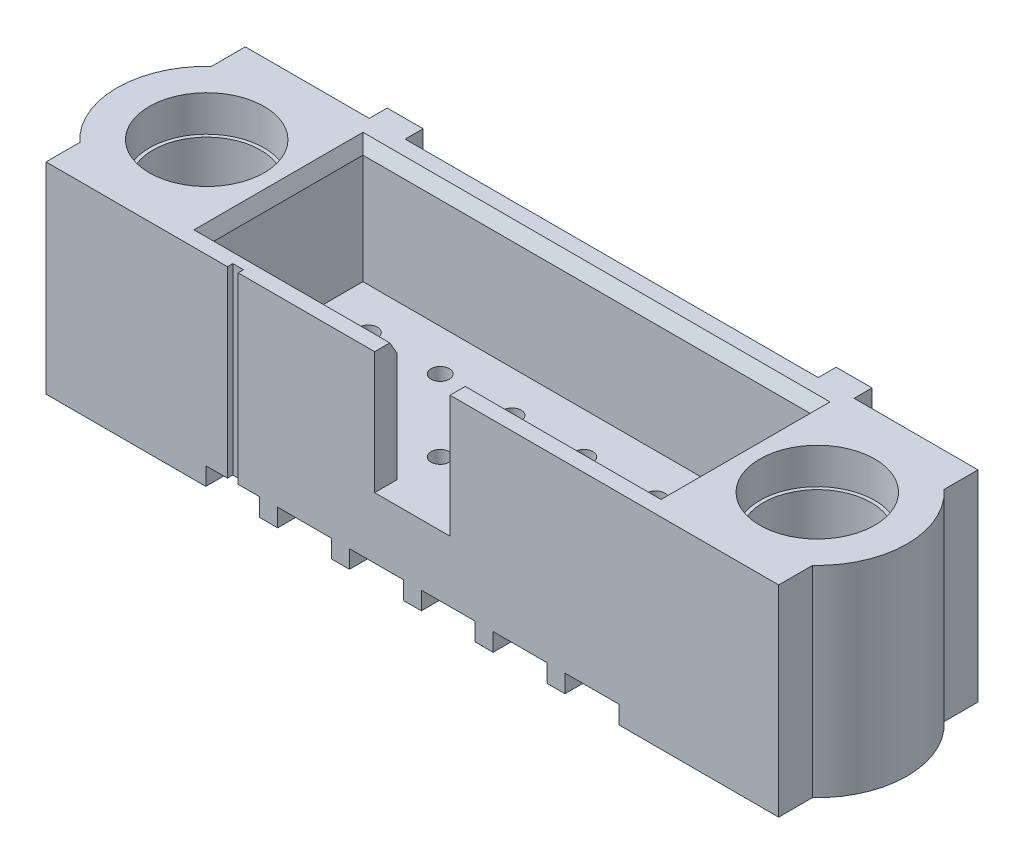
ISO-10303-21;
HEADER;
FILE_DESCRIPTION(('STEP AP214'),'2;1');
FILE_NAME('part.step','',(''),(''),'','','');
FILE_SCHEMA(('AUTOMOTIVE_DESIGN { 1 0 10303 214 1 1 1 1 }'));
ENDSEC;
DATA;
#1=APPLICATION_CONTEXT('core data for automotive mechanical design processes');
#2=APPLICATION_PROTOCOL_DEFINITION('international standard','automotive_design',2000,#1);
#3=PRODUCT_CONTEXT('',#1,'mechanical');
#4=PRODUCT('Part','Part','',(#3));
#5=PRODUCT_RELATED_PRODUCT_CATEGORY('part','',(#4));
#6=PRODUCT_DEFINITION_FORMATION('','',#4);
#7=PRODUCT_DEFINITION_CONTEXT('part definition',#1,'design');
#8=PRODUCT_DEFINITION('design','',#6,#7);
#9=PRODUCT_DEFINITION_SHAPE('','',#8);
#10=(LENGTH_UNIT() NAMED_UNIT(*) SI_UNIT(.MILLI.,.METRE.));
#11=(NAMED_UNIT(*) PLANE_ANGLE_UNIT() SI_UNIT($,.RADIAN.));
#12=(NAMED_UNIT(*) SI_UNIT($,.STERADIAN.) SOLID_ANGLE_UNIT());
#13=UNCERTAINTY_MEASURE_WITH_UNIT(LENGTH_MEASURE(1.E-05),#10,'distance_accuracy_value','');
#14=(GEOMETRIC_REPRESENTATION_CONTEXT(3) GLOBAL_UNCERTAINTY_ASSIGNED_CONTEXT((#13)) GLOBAL_UNIT_ASSIGNED_CONTEXT((#10,
#11,#12)) REPRESENTATION_CONTEXT('',''));
#15=CARTESIAN_POINT('',(0.,0.,0.));
#16=DIRECTION('',(0.,0.,1.));
#17=DIRECTION('',(1.,0.,0.));
#18=AXIS2_PLACEMENT_3D('',#15,#16,#17);
#19=CARTESIAN_POINT('',(-1.75,-2.2,2.775));
#20=DIRECTION('',(0.,-1.,0.));
#21=DIRECTION('',(0.,0.,-1.));
#22=AXIS2_PLACEMENT_3D('',#19,#20,#21);
#23=PLANE('',#22);
#24=DIRECTION('',(0.,0.,-1.));
#25=VECTOR('',#24,1.);
#26=CARTESIAN_POINT('',(-1.75,-2.2,2.775));
#27=LINE('',#26,#25);
#28=CARTESIAN_POINT('',(-1.75,-2.2,2.775));
#29=VERTEX_POINT('',#28);
#30=CARTESIAN_POINT('',(-1.75,-2.2,-2.775));
#31=VERTEX_POINT('',#30);
#32=EDGE_CURVE('E601',#29,#31,#27,.T.);
#33=ORIENTED_EDGE('',*,*,#32,.F.);
#34=DIRECTION('',(1.,0.,0.));
#35=VECTOR('',#34,1.);
#36=CARTESIAN_POINT('',(-1.75,-2.2,2.775));
#37=LINE('',#36,#35);
#38=CARTESIAN_POINT('',(-2.25,-2.2,2.775));
#39=VERTEX_POINT('',#38);
#40=EDGE_CURVE('E648',#29,#39,#37,.F.);
#41=ORIENTED_EDGE('',*,*,#40,.T.);
#42=DIRECTION('',(0.,0.,1.));
#43=VECTOR('',#42,1.);
#44=CARTESIAN_POINT('',(-2.25,-2.2,2.775));
#45=LINE('',#44,#43);
#46=CARTESIAN_POINT('',(-2.25,-2.2,-2.775));
#47=VERTEX_POINT('',#46);
#48=EDGE_CURVE('E626',#47,#39,#45,.T.);
#49=ORIENTED_EDGE('',*,*,#48,.F.);
#50=DIRECTION('',(1.,0.,0.));
#51=VECTOR('',#50,1.);
#52=CARTESIAN_POINT('',(-1.75,-2.2,-2.775));
#53=LINE('',#52,#51);
#54=EDGE_CURVE('E650',#47,#31,#53,.T.);
#55=ORIENTED_EDGE('',*,*,#54,.T.);
#56=EDGE_LOOP('',(#33,#41,#49,#55));
#57=FACE_BOUND('',#56,.T.);
#58=ADVANCED_FACE('F16',(#57),#23,.T.);
#59=CARTESIAN_POINT('',(0.25,-2.2,2.775));
#60=DIRECTION('',(0.,-1.,0.));
#61=DIRECTION('',(0.,0.,-1.));
#62=AXIS2_PLACEMENT_3D('',#59,#60,#61);
#63=PLANE('',#62);
#64=DIRECTION('',(0.,0.,-1.));
#65=VECTOR('',#64,1.);
#66=CARTESIAN_POINT('',(0.25,-2.2,2.775));
#67=LINE('',#66,#65);
#68=CARTESIAN_POINT('',(0.25,-2.2,2.775));
#69=VERTEX_POINT('',#68);
#70=CARTESIAN_POINT('',(0.25,-2.2,-2.775));
#71=VERTEX_POINT('',#70);
#72=EDGE_CURVE('E584',#69,#71,#67,.T.);
#73=ORIENTED_EDGE('',*,*,#72,.F.);
#74=DIRECTION('',(1.,0.,0.));
#75=VECTOR('',#74,1.);
#76=CARTESIAN_POINT('',(0.25,-2.2,2.775));
#77=LINE('',#76,#75);
#78=CARTESIAN_POINT('',(-0.25,-2.2,2.775));
#79=VERTEX_POINT('',#78);
#80=EDGE_CURVE('E644',#69,#79,#77,.F.);
#81=ORIENTED_EDGE('',*,*,#80,.T.);
#82=DIRECTION('',(0.,0.,1.));
#83=VECTOR('',#82,1.);
#84=CARTESIAN_POINT('',(-0.25,-2.2,2.775));
#85=LINE('',#84,#83);
#86=CARTESIAN_POINT('',(-0.25,-2.2,-2.775));
#87=VERTEX_POINT('',#86);
#88=EDGE_CURVE('E609',#87,#79,#85,.T.);
#89=ORIENTED_EDGE('',*,*,#88,.F.);
#90=DIRECTION('',(1.,0.,0.));
#91=VECTOR('',#90,1.);
#92=CARTESIAN_POINT('',(0.25,-2.2,-2.775));
#93=LINE('',#92,#91);
#94=EDGE_CURVE('E646',#87,#71,#93,.T.);
#95=ORIENTED_EDGE('',*,*,#94,.T.);
#96=EDGE_LOOP('',(#73,#81,#89,#95));
#97=FACE_BOUND('',#96,.T.);
#98=ADVANCED_FACE('F1656',(#97),#63,.T.);
#99=CARTESIAN_POINT('',(2.25,-2.2,2.775));
#100=DIRECTION('',(0.,-1.,0.));
#101=DIRECTION('',(0.,0.,-1.));
#102=AXIS2_PLACEMENT_3D('',#99,#100,#101);
#103=PLANE('',#102);
#104=DIRECTION('',(0.,0.,-1.));
#105=VECTOR('',#104,1.);
#106=CARTESIAN_POINT('',(2.25,-2.2,2.775));
#107=LINE('',#106,#105);
#108=CARTESIAN_POINT('',(2.25,-2.2,2.775));
#109=VERTEX_POINT('',#108);
#110=CARTESIAN_POINT('',(2.25,-2.2,-2.775));
#111=VERTEX_POINT('',#110);
#112=EDGE_CURVE('E567',#109,#111,#107,.T.);
#113=ORIENTED_EDGE('',*,*,#112,.F.);
#114=DIRECTION('',(1.,0.,0.));
#115=VECTOR('',#114,1.);
#116=CARTESIAN_POINT('',(2.25,-2.2,2.775));
#117=LINE('',#116,#115);
#118=CARTESIAN_POINT('',(1.75,-2.2,2.775));
#119=VERTEX_POINT('',#118);
#120=EDGE_CURVE('E640',#109,#119,#117,.F.);
#121=ORIENTED_EDGE('',*,*,#120,.T.);
#122=DIRECTION('',(0.,0.,1.));
#123=VECTOR('',#122,1.);
#124=CARTESIAN_POINT('',(1.75,-2.2,2.775));
#125=LINE('',#124,#123);
#126=CARTESIAN_POINT('',(1.75,-2.2,-2.775));
#127=VERTEX_POINT('',#126);
#128=EDGE_CURVE('E592',#127,#119,#125,.T.);
#129=ORIENTED_EDGE('',*,*,#128,.F.);
#130=DIRECTION('',(1.,0.,0.));
#131=VECTOR('',#130,1.);
#132=CARTESIAN_POINT('',(2.25,-2.2,-2.775));
#133=LINE('',#132,#131);
#134=EDGE_CURVE('E642',#127,#111,#133,.T.);
#135=ORIENTED_EDGE('',*,*,#134,.T.);
#136=EDGE_LOOP('',(#113,#121,#129,#135));
#137=FACE_BOUND('',#136,.T.);
#138=ADVANCED_FACE('F1653',(#137),#103,.T.);
#139=CARTESIAN_POINT('',(-3.75,-2.2,2.775));
#140=DIRECTION('',(0.,-1.,0.));
#141=DIRECTION('',(0.,0.,-1.));
#142=AXIS2_PLACEMENT_3D('',#139,#140,#141);
#143=PLANE('',#142);
#144=DIRECTION('',(0.,0.,-1.));
#145=VECTOR('',#144,1.);
#146=CARTESIAN_POINT('',(-3.75,-2.2,2.775));
#147=LINE('',#146,#145);
#148=CARTESIAN_POINT('',(-3.75,-2.2,2.775));
#149=VERTEX_POINT('',#148);
#150=CARTESIAN_POINT('',(-3.75,-2.2,-2.775));
#151=VERTEX_POINT('',#150);
#152=EDGE_CURVE('E618',#149,#151,#147,.T.);
#153=ORIENTED_EDGE('',*,*,#152,.F.);
#154=DIRECTION('',(1.,0.,0.));
#155=VECTOR('',#154,1.);
#156=CARTESIAN_POINT('',(-3.75,-2.2,2.775));
#157=LINE('',#156,#155);
#158=CARTESIAN_POINT('',(-4.25,-2.2,2.775));
#159=VERTEX_POINT('',#158);
#160=EDGE_CURVE('E636',#149,#159,#157,.F.);
#161=ORIENTED_EDGE('',*,*,#160,.T.);
#162=DIRECTION('',(0.,0.,1.));
#163=VECTOR('',#162,1.);
#164=CARTESIAN_POINT('',(-4.25,-2.2,2.775));
#165=LINE('',#164,#163);
#166=CARTESIAN_POINT('',(-4.25,-2.2,-2.775));
#167=VERTEX_POINT('',#166);
#168=EDGE_CURVE('E545',#167,#159,#165,.T.);
#169=ORIENTED_EDGE('',*,*,#168,.F.);
#170=DIRECTION('',(1.,0.,0.));
#171=VECTOR('',#170,1.);
#172=CARTESIAN_POINT('',(-3.75,-2.2,-2.775));
#173=LINE('',#172,#171);
#174=EDGE_CURVE('E638',#167,#151,#173,.T.);
#175=ORIENTED_EDGE('',*,*,#174,.T.);
#176=EDGE_LOOP('',(#153,#161,#169,#175));
#177=FACE_BOUND('',#176,.T.);
#178=ADVANCED_FACE('F1649',(#177),#143,.T.);
#179=CARTESIAN_POINT('',(4.25,-2.2,2.775));
#180=DIRECTION('',(0.,-1.,0.));
#181=DIRECTION('',(0.,0.,-1.));
#182=AXIS2_PLACEMENT_3D('',#179,#180,#181);
#183=PLANE('',#182);
#184=DIRECTION('',(0.,0.,-1.));
#185=VECTOR('',#184,1.);
#186=CARTESIAN_POINT('',(4.25,-2.2,2.775));
#187=LINE('',#186,#185);
#188=CARTESIAN_POINT('',(4.25,-2.2,2.775));
#189=VERTEX_POINT('',#188);
#190=CARTESIAN_POINT('',(4.25,-2.2,-2.775));
#191=VERTEX_POINT('',#190);
#192=EDGE_CURVE('E536',#189,#191,#187,.T.);
#193=ORIENTED_EDGE('',*,*,#192,.F.);
#194=DIRECTION('',(1.,0.,0.));
#195=VECTOR('',#194,1.);
#196=CARTESIAN_POINT('',(4.25,-2.2,2.775));
#197=LINE('',#196,#195);
#198=CARTESIAN_POINT('',(3.75,-2.2,2.775));
#199=VERTEX_POINT('',#198);
#200=EDGE_CURVE('E632',#189,#199,#197,.F.);
#201=ORIENTED_EDGE('',*,*,#200,.T.);
#202=DIRECTION('',(0.,0.,1.));
#203=VECTOR('',#202,1.);
#204=CARTESIAN_POINT('',(3.75,-2.2,2.775));
#205=LINE('',#204,#203);
#206=CARTESIAN_POINT('',(3.75,-2.2,-2.775));
#207=VERTEX_POINT('',#206);
#208=EDGE_CURVE('E575',#207,#199,#205,.T.);
#209=ORIENTED_EDGE('',*,*,#208,.F.);
#210=DIRECTION('',(1.,0.,0.));
#211=VECTOR('',#210,1.);
#212=CARTESIAN_POINT('',(4.25,-2.2,-2.775));
#213=LINE('',#212,#211);
#214=EDGE_CURVE('E634',#207,#191,#213,.T.);
#215=ORIENTED_EDGE('',*,*,#214,.T.);
#216=EDGE_LOOP('',(#193,#201,#209,#215));
#217=FACE_BOUND('',#216,.T.);
#218=ADVANCED_FACE('F1645',(#217),#183,.T.);
#219=CARTESIAN_POINT('',(-2.25,-2.2,2.775));
#220=DIRECTION('',(-1.,0.,0.));
#221=DIRECTION('',(0.,0.,1.));
#222=AXIS2_PLACEMENT_3D('',#219,#220,#221);
#223=PLANE('',#222);
#224=DIRECTION('',(0.,1.,0.));
#225=VECTOR('',#224,1.);
#226=CARTESIAN_POINT('',(-2.25,-2.2,2.775));
#227=LINE('',#226,#225);
#228=CARTESIAN_POINT('',(-2.25,-1.7,2.775));
#229=VERTEX_POINT('',#228);
#230=EDGE_CURVE('E624',#39,#229,#227,.T.);
#231=ORIENTED_EDGE('',*,*,#230,.T.);
#232=DIRECTION('',(0.,0.,1.));
#233=VECTOR('',#232,1.);
#234=CARTESIAN_POINT('',(-2.25,-1.7,3.38));
#235=LINE('',#234,#233);
#236=CARTESIAN_POINT('',(-2.25,-1.7,-2.775));
#237=VERTEX_POINT('',#236);
#238=EDGE_CURVE('E531',#229,#237,#235,.F.);
#239=ORIENTED_EDGE('',*,*,#238,.T.);
#240=DIRECTION('',(0.,1.,0.));
#241=VECTOR('',#240,1.);
#242=CARTESIAN_POINT('',(-2.25,-2.2,-2.775));
#243=LINE('',#242,#241);
#244=EDGE_CURVE('E629',#237,#47,#243,.F.);
#245=ORIENTED_EDGE('',*,*,#244,.T.);
#246=ORIENTED_EDGE('',*,*,#48,.T.);
#247=EDGE_LOOP('',(#231,#239,#245,#246));
#248=FACE_BOUND('',#247,.T.);
#249=ADVANCED_FACE('F1641',(#248),#223,.T.);
#250=CARTESIAN_POINT('',(-3.75,-1.7,2.775));
#251=DIRECTION('',(1.,0.,0.));
#252=DIRECTION('',(0.,0.,-1.));
#253=AXIS2_PLACEMENT_3D('',#250,#251,#252);
#254=PLANE('',#253);
#255=DIRECTION('',(0.,1.,0.));
#256=VECTOR('',#255,1.);
#257=CARTESIAN_POINT('',(-3.75,-1.7,-2.775));
#258=LINE('',#257,#256);
#259=CARTESIAN_POINT('',(-3.75,-1.7,-2.775));
#260=VERTEX_POINT('',#259);
#261=EDGE_CURVE('E615',#151,#260,#258,.T.);
#262=ORIENTED_EDGE('',*,*,#261,.T.);
#263=DIRECTION('',(0.,0.,1.));
#264=VECTOR('',#263,1.);
#265=CARTESIAN_POINT('',(-3.75,-1.7,3.38));
#266=LINE('',#265,#264);
#267=CARTESIAN_POINT('',(-3.75,-1.7,2.775));
#268=VERTEX_POINT('',#267);
#269=EDGE_CURVE('E526',#260,#268,#266,.T.);
#270=ORIENTED_EDGE('',*,*,#269,.T.);
#271=DIRECTION('',(0.,1.,0.));
#272=VECTOR('',#271,1.);
#273=CARTESIAN_POINT('',(-3.75,-1.7,2.775));
#274=LINE('',#273,#272);
#275=EDGE_CURVE('E621',#268,#149,#274,.F.);
#276=ORIENTED_EDGE('',*,*,#275,.T.);
#277=ORIENTED_EDGE('',*,*,#152,.T.);
#278=EDGE_LOOP('',(#262,#270,#276,#277));
#279=FACE_BOUND('',#278,.T.);
#280=ADVANCED_FACE('F1637',(#279),#254,.T.);
#281=CARTESIAN_POINT('',(-0.25,-2.2,2.775));
#282=DIRECTION('',(-1.,0.,0.));
#283=DIRECTION('',(0.,0.,1.));
#284=AXIS2_PLACEMENT_3D('',#281,#282,#283);
#285=PLANE('',#284);
#286=DIRECTION('',(0.,1.,0.));
#287=VECTOR('',#286,1.);
#288=CARTESIAN_POINT('',(-0.25,-2.2,2.775));
#289=LINE('',#288,#287);
#290=CARTESIAN_POINT('',(-0.25,-1.7,2.775));
#291=VERTEX_POINT('',#290);
#292=EDGE_CURVE('E607',#79,#291,#289,.T.);
#293=ORIENTED_EDGE('',*,*,#292,.T.);
#294=DIRECTION('',(0.,0.,1.));
#295=VECTOR('',#294,1.);
#296=CARTESIAN_POINT('',(-0.25,-1.7,3.38));
#297=LINE('',#296,#295);
#298=CARTESIAN_POINT('',(-0.25,-1.7,-2.775));
#299=VERTEX_POINT('',#298);
#300=EDGE_CURVE('E520',#291,#299,#297,.F.);
#301=ORIENTED_EDGE('',*,*,#300,.T.);
#302=DIRECTION('',(0.,1.,0.));
#303=VECTOR('',#302,1.);
#304=CARTESIAN_POINT('',(-0.25,-2.2,-2.775));
#305=LINE('',#304,#303);
#306=EDGE_CURVE('E612',#299,#87,#305,.F.);
#307=ORIENTED_EDGE('',*,*,#306,.T.);
#308=ORIENTED_EDGE('',*,*,#88,.T.);
#309=EDGE_LOOP('',(#293,#301,#307,#308));
#310=FACE_BOUND('',#309,.T.);
#311=ADVANCED_FACE('F1633',(#310),#285,.T.);
#312=CARTESIAN_POINT('',(-1.75,-1.7,2.775));
#313=DIRECTION('',(1.,0.,0.));
#314=DIRECTION('',(0.,0.,-1.));
#315=AXIS2_PLACEMENT_3D('',#312,#313,#314);
#316=PLANE('',#315);
#317=DIRECTION('',(0.,1.,0.));
#318=VECTOR('',#317,1.);
#319=CARTESIAN_POINT('',(-1.75,-1.7,-2.775));
#320=LINE('',#319,#318);
#321=CARTESIAN_POINT('',(-1.75,-1.7,-2.775));
#322=VERTEX_POINT('',#321);
#323=EDGE_CURVE('E598',#31,#322,#320,.T.);
#324=ORIENTED_EDGE('',*,*,#323,.T.);
#325=DIRECTION('',(0.,0.,1.));
#326=VECTOR('',#325,1.);
#327=CARTESIAN_POINT('',(-1.75,-1.7,3.38));
#328=LINE('',#327,#326);
#329=CARTESIAN_POINT('',(-1.75,-1.7,2.775));
#330=VERTEX_POINT('',#329);
#331=EDGE_CURVE('E515',#322,#330,#328,.T.);
#332=ORIENTED_EDGE('',*,*,#331,.T.);
#333=DIRECTION('',(0.,1.,0.));
#334=VECTOR('',#333,1.);
#335=CARTESIAN_POINT('',(-1.75,-1.7,2.775));
#336=LINE('',#335,#334);
#337=EDGE_CURVE('E604',#330,#29,#336,.F.);
#338=ORIENTED_EDGE('',*,*,#337,.T.);
#339=ORIENTED_EDGE('',*,*,#32,.T.);
#340=EDGE_LOOP('',(#324,#332,#338,#339));
#341=FACE_BOUND('',#340,.T.);
#342=ADVANCED_FACE('F1629',(#341),#316,.T.);
#343=CARTESIAN_POINT('',(1.75,-2.2,2.775));
#344=DIRECTION('',(-1.,0.,0.));
#345=DIRECTION('',(0.,0.,1.));
#346=AXIS2_PLACEMENT_3D('',#343,#344,#345);
#347=PLANE('',#346);
#348=DIRECTION('',(0.,1.,0.));
#349=VECTOR('',#348,1.);
#350=CARTESIAN_POINT('',(1.75,-2.2,2.775));
#351=LINE('',#350,#349);
#352=CARTESIAN_POINT('',(1.75,-1.7,2.775));
#353=VERTEX_POINT('',#352);
#354=EDGE_CURVE('E590',#119,#353,#351,.T.);
#355=ORIENTED_EDGE('',*,*,#354,.T.);
#356=DIRECTION('',(0.,0.,1.));
#357=VECTOR('',#356,1.);
#358=CARTESIAN_POINT('',(1.75,-1.7,3.38));
#359=LINE('',#358,#357);
#360=CARTESIAN_POINT('',(1.75,-1.7,-2.775));
#361=VERTEX_POINT('',#360);
#362=EDGE_CURVE('E509',#353,#361,#359,.F.);
#363=ORIENTED_EDGE('',*,*,#362,.T.);
#364=DIRECTION('',(0.,1.,0.));
#365=VECTOR('',#364,1.);
#366=CARTESIAN_POINT('',(1.75,-2.2,-2.775));
#367=LINE('',#366,#365);
#368=EDGE_CURVE('E595',#361,#127,#367,.F.);
#369=ORIENTED_EDGE('',*,*,#368,.T.);
#370=ORIENTED_EDGE('',*,*,#128,.T.);
#371=EDGE_LOOP('',(#355,#363,#369,#370));
#372=FACE_BOUND('',#371,.T.);
#373=ADVANCED_FACE('F1625',(#372),#347,.T.);
#374=CARTESIAN_POINT('',(0.25,-1.7,2.775));
#375=DIRECTION('',(1.,0.,0.));
#376=DIRECTION('',(0.,0.,-1.));
#377=AXIS2_PLACEMENT_3D('',#374,#375,#376);
#378=PLANE('',#377);
#379=DIRECTION('',(0.,1.,0.));
#380=VECTOR('',#379,1.);
#381=CARTESIAN_POINT('',(0.25,-1.7,-2.775));
#382=LINE('',#381,#380);
#383=CARTESIAN_POINT('',(0.25,-1.7,-2.775));
#384=VERTEX_POINT('',#383);
#385=EDGE_CURVE('E581',#71,#384,#382,.T.);
#386=ORIENTED_EDGE('',*,*,#385,.T.);
#387=DIRECTION('',(0.,0.,1.));
#388=VECTOR('',#387,1.);
#389=CARTESIAN_POINT('',(0.25,-1.7,3.38));
#390=LINE('',#389,#388);
#391=CARTESIAN_POINT('',(0.25,-1.7,2.775));
#392=VERTEX_POINT('',#391);
#393=EDGE_CURVE('E504',#384,#392,#390,.T.);
#394=ORIENTED_EDGE('',*,*,#393,.T.);
#395=DIRECTION('',(0.,1.,0.));
#396=VECTOR('',#395,1.);
#397=CARTESIAN_POINT('',(0.25,-1.7,2.775));
#398=LINE('',#397,#396);
#399=EDGE_CURVE('E587',#392,#69,#398,.F.);
#400=ORIENTED_EDGE('',*,*,#399,.T.);
#401=ORIENTED_EDGE('',*,*,#72,.T.);
#402=EDGE_LOOP('',(#386,#394,#400,#401));
#403=FACE_BOUND('',#402,.T.);
#404=ADVANCED_FACE('F1621',(#403),#378,.T.);
#405=CARTESIAN_POINT('',(3.75,-2.2,2.775));
#406=DIRECTION('',(-1.,0.,0.));
#407=DIRECTION('',(0.,0.,1.));
#408=AXIS2_PLACEMENT_3D('',#405,#406,#407);
#409=PLANE('',#408);
#410=DIRECTION('',(0.,1.,0.));
#411=VECTOR('',#410,1.);
#412=CARTESIAN_POINT('',(3.75,-2.2,2.775));
#413=LINE('',#412,#411);
#414=CARTESIAN_POINT('',(3.75,-1.7,2.775));
#415=VERTEX_POINT('',#414);
#416=EDGE_CURVE('E573',#199,#415,#413,.T.);
#417=ORIENTED_EDGE('',*,*,#416,.T.);
#418=DIRECTION('',(0.,0.,1.));
#419=VECTOR('',#418,1.);
#420=CARTESIAN_POINT('',(3.75,-1.7,3.38));
#421=LINE('',#420,#419);
#422=CARTESIAN_POINT('',(3.75,-1.7,-2.775));
#423=VERTEX_POINT('',#422);
#424=EDGE_CURVE('E498',#415,#423,#421,.F.);
#425=ORIENTED_EDGE('',*,*,#424,.T.);
#426=DIRECTION('',(0.,1.,0.));
#427=VECTOR('',#426,1.);
#428=CARTESIAN_POINT('',(3.75,-2.2,-2.775));
#429=LINE('',#428,#427);
#430=EDGE_CURVE('E578',#423,#207,#429,.F.);
#431=ORIENTED_EDGE('',*,*,#430,.T.);
#432=ORIENTED_EDGE('',*,*,#208,.T.);
#433=EDGE_LOOP('',(#417,#425,#431,#432));
#434=FACE_BOUND('',#433,.T.);
#435=ADVANCED_FACE('F1617',(#434),#409,.T.);
#436=CARTESIAN_POINT('',(2.25,-1.7,2.775));
#437=DIRECTION('',(1.,0.,0.));
#438=DIRECTION('',(0.,0.,-1.));
#439=AXIS2_PLACEMENT_3D('',#436,#437,#438);
#440=PLANE('',#439);
#441=DIRECTION('',(0.,1.,0.));
#442=VECTOR('',#441,1.);
#443=CARTESIAN_POINT('',(2.25,-1.7,-2.775));
#444=LINE('',#443,#442);
#445=CARTESIAN_POINT('',(2.25,-1.7,-2.775));
#446=VERTEX_POINT('',#445);
#447=EDGE_CURVE('E551',#111,#446,#444,.T.);
#448=ORIENTED_EDGE('',*,*,#447,.T.);
#449=DIRECTION('',(0.,0.,1.));
#450=VECTOR('',#449,1.);
#451=CARTESIAN_POINT('',(2.25,-1.7,3.38));
#452=LINE('',#451,#450);
#453=CARTESIAN_POINT('',(2.25,-1.7,2.775));
#454=VERTEX_POINT('',#453);
#455=EDGE_CURVE('E493',#446,#454,#452,.T.);
#456=ORIENTED_EDGE('',*,*,#455,.T.);
#457=DIRECTION('',(0.,1.,0.));
#458=VECTOR('',#457,1.);
#459=CARTESIAN_POINT('',(2.25,-1.7,2.775));
#460=LINE('',#459,#458);
#461=EDGE_CURVE('E570',#454,#109,#460,.F.);
#462=ORIENTED_EDGE('',*,*,#461,.T.);
#463=ORIENTED_EDGE('',*,*,#112,.T.);
#464=EDGE_LOOP('',(#448,#456,#462,#463));
#465=FACE_BOUND('',#464,.T.);
#466=ADVANCED_FACE('F1613',(#465),#440,.T.);
#467=CARTESIAN_POINT('',(-4.25,-2.2,2.775));
#468=DIRECTION('',(-1.,0.,0.));
#469=DIRECTION('',(0.,0.,1.));
#470=AXIS2_PLACEMENT_3D('',#467,#468,#469);
#471=PLANE('',#470);
#472=DIRECTION('',(0.,1.,0.));
#473=VECTOR('',#472,1.);
#474=CARTESIAN_POINT('',(-4.25,-2.2,2.775));
#475=LINE('',#474,#473);
#476=CARTESIAN_POINT('',(-4.25,-1.7,2.775));
#477=VERTEX_POINT('',#476);
#478=EDGE_CURVE('E542',#159,#477,#475,.T.);
#479=ORIENTED_EDGE('',*,*,#478,.T.);
#480=DIRECTION('',(0.,0.,1.));
#481=VECTOR('',#480,1.);
#482=CARTESIAN_POINT('',(-4.25,-1.7,3.38));
#483=LINE('',#482,#481);
#484=CARTESIAN_POINT('',(-4.25,-1.7,-2.775));
#485=VERTEX_POINT('',#484);
#486=EDGE_CURVE('E951',#477,#485,#483,.F.);
#487=ORIENTED_EDGE('',*,*,#486,.T.);
#488=DIRECTION('',(0.,1.,0.));
#489=VECTOR('',#488,1.);
#490=CARTESIAN_POINT('',(-4.25,-2.2,-2.775));
#491=LINE('',#490,#489);
#492=EDGE_CURVE('E548',#485,#167,#491,.F.);
#493=ORIENTED_EDGE('',*,*,#492,.T.);
#494=ORIENTED_EDGE('',*,*,#168,.T.);
#495=EDGE_LOOP('',(#479,#487,#493,#494));
#496=FACE_BOUND('',#495,.T.);
#497=ADVANCED_FACE('F1609',(#496),#471,.T.);
#498=CARTESIAN_POINT('',(0.,-1.4,0.));
#499=DIRECTION('',(0.,1.,0.));
#500=DIRECTION('',(0.,0.,1.));
#501=AXIS2_PLACEMENT_3D('',#498,#499,#500);
#502=PLANE('',#501);
#503=CARTESIAN_POINT('',(-8.5,-1.4,0.));
#504=DIRECTION('',(0.,-1.,0.));
#505=DIRECTION('',(0.,0.,-1.));
#506=AXIS2_PLACEMENT_3D('',#503,#504,#505);
#507=CIRCLE('',#506,1.5);
#508=CARTESIAN_POINT('',(-8.5,-1.4,-1.5));
#509=VERTEX_POINT('',#508);
#510=EDGE_CURVE('E820',#509,#509,#507,.F.);
#511=ORIENTED_EDGE('',*,*,#510,.T.);
#512=EDGE_LOOP('',(#511));
#513=FACE_BOUND('',#512,.T.);
#514=CARTESIAN_POINT('',(-7.05,-1.4,-1.45));
#515=DIRECTION('',(0.,-1.,0.));
#516=DIRECTION('',(0.,0.,-1.));
#517=AXIS2_PLACEMENT_3D('',#514,#515,#516);
#518=CIRCLE('',#517,0.1);
#519=CARTESIAN_POINT('',(-7.05,-1.4,-1.55));
#520=VERTEX_POINT('',#519);
#521=CARTESIAN_POINT('',(-6.95,-1.4,-1.45));
#522=VERTEX_POINT('',#521);
#523=EDGE_CURVE('E558',#520,#522,#518,.T.);
#524=ORIENTED_EDGE('',*,*,#523,.T.);
#525=DIRECTION('',(0.,0.,1.));
#526=VECTOR('',#525,1.);
#527=CARTESIAN_POINT('',(-6.95,-1.4,1.55));
#528=LINE('',#527,#526);
#529=CARTESIAN_POINT('',(-6.95,-1.4,1.45));
#530=VERTEX_POINT('',#529);
#531=EDGE_CURVE('E555',#530,#522,#528,.F.);
#532=ORIENTED_EDGE('',*,*,#531,.F.);
#533=CARTESIAN_POINT('',(-7.05,-1.4,1.45));
#534=DIRECTION('',(0.,-1.,0.));
#535=DIRECTION('',(0.,0.,-1.));
#536=AXIS2_PLACEMENT_3D('',#533,#534,#535);
#537=CIRCLE('',#536,0.1);
#538=CARTESIAN_POINT('',(-7.05,-1.4,1.55));
#539=VERTEX_POINT('',#538);
#540=EDGE_CURVE('E562',#530,#539,#537,.T.);
#541=ORIENTED_EDGE('',*,*,#540,.T.);
#542=DIRECTION('',(-1.,0.,0.));
#543=VECTOR('',#542,1.);
#544=CARTESIAN_POINT('',(-10.05,-1.4,1.55));
#545=LINE('',#544,#543);
#546=CARTESIAN_POINT('',(-9.95,-1.4,1.55));
#547=VERTEX_POINT('',#546);
#548=EDGE_CURVE('E560',#547,#539,#545,.F.);
#549=ORIENTED_EDGE('',*,*,#548,.F.);
#550=CARTESIAN_POINT('',(-9.95,-1.4,1.45));
#551=DIRECTION('',(0.,-1.,0.));
#552=DIRECTION('',(0.,0.,-1.));
#553=AXIS2_PLACEMENT_3D('',#550,#551,#552);
#554=CIRCLE('',#553,0.1);
#555=CARTESIAN_POINT('',(-10.05,-1.4,1.45));
#556=VERTEX_POINT('',#555);
#557=EDGE_CURVE('E450',#547,#556,#554,.T.);
#558=ORIENTED_EDGE('',*,*,#557,.T.);
#559=DIRECTION('',(0.,0.,-1.));
#560=VECTOR('',#559,1.);
#561=CARTESIAN_POINT('',(-10.05,-1.4,-1.55));
#562=LINE('',#561,#560);
#563=CARTESIAN_POINT('',(-10.05,-1.4,-1.45));
#564=VERTEX_POINT('',#563);
#565=EDGE_CURVE('E444',#564,#556,#562,.F.);
#566=ORIENTED_EDGE('',*,*,#565,.F.);
#567=CARTESIAN_POINT('',(-9.95,-1.4,-1.45));
#568=DIRECTION('',(0.,-1.,0.));
#569=DIRECTION('',(0.,0.,-1.));
#570=AXIS2_PLACEMENT_3D('',#567,#568,#569);
#571=CIRCLE('',#570,0.1);
#572=CARTESIAN_POINT('',(-9.95,-1.4,-1.55));
#573=VERTEX_POINT('',#572);
#574=EDGE_CURVE('E19',#564,#573,#571,.T.);
#575=ORIENTED_EDGE('',*,*,#574,.T.);
#576=DIRECTION('',(1.,0.,0.));
#577=VECTOR('',#576,1.);
#578=CARTESIAN_POINT('',(-6.95,-1.4,-1.55));
#579=LINE('',#578,#577);
#580=EDGE_CURVE('E552',#520,#573,#579,.F.);
#581=ORIENTED_EDGE('',*,*,#580,.F.);
#582=EDGE_LOOP('',(#524,#532,#541,#549,#558,#566,#575,#581));
#583=FACE_BOUND('',#582,.T.);
#584=ADVANCED_FACE('F446',(#513,#583),#502,.F.);
#585=CARTESIAN_POINT('',(4.25,-1.7,2.775));
#586=DIRECTION('',(1.,0.,0.));
#587=DIRECTION('',(0.,0.,-1.));
#588=AXIS2_PLACEMENT_3D('',#585,#586,#587);
#589=PLANE('',#588);
#590=DIRECTION('',(0.,1.,0.));
#591=VECTOR('',#590,1.);
#592=CARTESIAN_POINT('',(4.25,-1.7,-2.775));
#593=LINE('',#592,#591);
#594=CARTESIAN_POINT('',(4.25,-1.7,-2.775));
#595=VERTEX_POINT('',#594);
#596=EDGE_CURVE('E534',#191,#595,#593,.T.);
#597=ORIENTED_EDGE('',*,*,#596,.T.);
#598=DIRECTION('',(0.,0.,1.));
#599=VECTOR('',#598,1.);
#600=CARTESIAN_POINT('',(4.25,-1.7,3.38));
#601=LINE('',#600,#599);
#602=CARTESIAN_POINT('',(4.25,-1.7,2.775));
#603=VERTEX_POINT('',#602);
#604=EDGE_CURVE('E823',#595,#603,#601,.T.);
#605=ORIENTED_EDGE('',*,*,#604,.T.);
#606=DIRECTION('',(0.,1.,0.));
#607=VECTOR('',#606,1.);
#608=CARTESIAN_POINT('',(4.25,-1.7,2.775));
#609=LINE('',#608,#607);
#610=EDGE_CURVE('E539',#603,#189,#609,.F.);
#611=ORIENTED_EDGE('',*,*,#610,.T.);
#612=ORIENTED_EDGE('',*,*,#192,.T.);
#613=EDGE_LOOP('',(#597,#605,#611,#612));
#614=FACE_BOUND('',#613,.T.);
#615=ADVANCED_FACE('F1602',(#614),#589,.T.);
#616=CARTESIAN_POINT('',(5.75,-1.7,3.38));
#617=DIRECTION('',(0.,1.,0.));
#618=DIRECTION('',(0.,0.,1.));
#619=AXIS2_PLACEMENT_3D('',#616,#617,#618);
#620=PLANE('',#619);
#621=CARTESIAN_POINT('',(-3.,-1.70000000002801,1.));
#622=DIRECTION('',(0.,-1.,0.));
#623=DIRECTION('',(0.,0.,-1.));
#624=AXIS2_PLACEMENT_3D('',#621,#622,#623);
#625=CIRCLE('',#624,0.434999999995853);
#626=CARTESIAN_POINT('',(-3.,-1.70000000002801,0.565000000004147));
#627=VERTEX_POINT('',#626);
#628=EDGE_CURVE('E792',#627,#627,#625,.F.);
#629=ORIENTED_EDGE('',*,*,#628,.T.);
#630=EDGE_LOOP('',(#629));
#631=FACE_BOUND('',#630,.T.);
#632=CARTESIAN_POINT('',(-3.,-1.70000000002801,-1.));
#633=DIRECTION('',(0.,-1.,0.));
#634=DIRECTION('',(0.,0.,-1.));
#635=AXIS2_PLACEMENT_3D('',#632,#633,#634);
#636=CIRCLE('',#635,0.434999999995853);
#637=CARTESIAN_POINT('',(-3.,-1.70000000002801,-1.43499999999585));
#638=VERTEX_POINT('',#637);
#639=EDGE_CURVE('E801',#638,#638,#636,.F.);
#640=ORIENTED_EDGE('',*,*,#639,.T.);
#641=EDGE_LOOP('',(#640));
#642=FACE_BOUND('',#641,.T.);
#643=ORIENTED_EDGE('',*,*,#269,.F.);
#644=DIRECTION('',(1.,0.,0.));
#645=VECTOR('',#644,1.);
#646=CARTESIAN_POINT('',(5.75,-1.7,-2.775));
#647=LINE('',#646,#645);
#648=EDGE_CURVE('E529',#237,#260,#647,.F.);
#649=ORIENTED_EDGE('',*,*,#648,.F.);
#650=ORIENTED_EDGE('',*,*,#238,.F.);
#651=DIRECTION('',(1.,0.,0.));
#652=VECTOR('',#651,1.);
#653=CARTESIAN_POINT('',(5.75,-1.7,2.775));
#654=LINE('',#653,#652);
#655=EDGE_CURVE('E523',#268,#229,#654,.T.);
#656=ORIENTED_EDGE('',*,*,#655,.F.);
#657=EDGE_LOOP('',(#643,#649,#650,#656));
#658=FACE_BOUND('',#657,.T.);
#659=ADVANCED_FACE('F1598',(#631,#642,#658),#620,.F.);
#660=CARTESIAN_POINT('',(5.75,-1.7,3.38));
#661=DIRECTION('',(0.,1.,0.));
#662=DIRECTION('',(0.,0.,1.));
#663=AXIS2_PLACEMENT_3D('',#660,#661,#662);
#664=PLANE('',#663);
#665=CARTESIAN_POINT('',(-1.,-1.70000000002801,1.));
#666=DIRECTION('',(0.,-1.,0.));
#667=DIRECTION('',(0.,0.,-1.));
#668=AXIS2_PLACEMENT_3D('',#665,#666,#667);
#669=CIRCLE('',#668,0.435000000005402);
#670=CARTESIAN_POINT('',(-1.,-1.70000000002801,0.564999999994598));
#671=VERTEX_POINT('',#670);
#672=EDGE_CURVE('E789',#671,#671,#669,.F.);
#673=ORIENTED_EDGE('',*,*,#672,.T.);
#674=EDGE_LOOP('',(#673));
#675=FACE_BOUND('',#674,.T.);
#676=CARTESIAN_POINT('',(-1.,-1.70000000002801,-1.));
#677=DIRECTION('',(0.,-1.,0.));
#678=DIRECTION('',(0.,0.,-1.));
#679=AXIS2_PLACEMENT_3D('',#676,#677,#678);
#680=CIRCLE('',#679,0.435000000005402);
#681=CARTESIAN_POINT('',(-1.,-1.70000000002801,-1.4350000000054));
#682=VERTEX_POINT('',#681);
#683=EDGE_CURVE('E804',#682,#682,#680,.F.);
#684=ORIENTED_EDGE('',*,*,#683,.T.);
#685=EDGE_LOOP('',(#684));
#686=FACE_BOUND('',#685,.T.);
#687=ORIENTED_EDGE('',*,*,#331,.F.);
#688=DIRECTION('',(1.,0.,0.));
#689=VECTOR('',#688,1.);
#690=CARTESIAN_POINT('',(5.75,-1.7,-2.775));
#691=LINE('',#690,#689);
#692=EDGE_CURVE('E518',#299,#322,#691,.F.);
#693=ORIENTED_EDGE('',*,*,#692,.F.);
#694=ORIENTED_EDGE('',*,*,#300,.F.);
#695=DIRECTION('',(1.,0.,0.));
#696=VECTOR('',#695,1.);
#697=CARTESIAN_POINT('',(5.75,-1.7,2.775));
#698=LINE('',#697,#696);
#699=EDGE_CURVE('E512',#330,#291,#698,.T.);
#700=ORIENTED_EDGE('',*,*,#699,.F.);
#701=EDGE_LOOP('',(#687,#693,#694,#700));
#702=FACE_BOUND('',#701,.T.);
#703=ADVANCED_FACE('F1594',(#675,#686,#702),#664,.F.);
#704=CARTESIAN_POINT('',(5.75,-1.7,3.38));
#705=DIRECTION('',(0.,1.,0.));
#706=DIRECTION('',(0.,0.,1.));
#707=AXIS2_PLACEMENT_3D('',#704,#705,#706);
#708=PLANE('',#707);
#709=CARTESIAN_POINT('',(1.,-1.70000000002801,1.));
#710=DIRECTION('',(0.,-1.,0.));
#711=DIRECTION('',(0.,0.,-1.));
#712=AXIS2_PLACEMENT_3D('',#709,#710,#711);
#713=CIRCLE('',#712,0.435000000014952);
#714=CARTESIAN_POINT('',(1.,-1.70000000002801,0.564999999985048));
#715=VERTEX_POINT('',#714);
#716=EDGE_CURVE('E786',#715,#715,#713,.F.);
#717=ORIENTED_EDGE('',*,*,#716,.T.);
#718=EDGE_LOOP('',(#717));
#719=FACE_BOUND('',#718,.T.);
#720=CARTESIAN_POINT('',(1.,-1.70000000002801,-1.));
#721=DIRECTION('',(0.,-1.,0.));
#722=DIRECTION('',(0.,0.,-1.));
#723=AXIS2_PLACEMENT_3D('',#720,#721,#722);
#724=CIRCLE('',#723,0.435000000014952);
#725=CARTESIAN_POINT('',(1.,-1.70000000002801,-1.43500000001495));
#726=VERTEX_POINT('',#725);
#727=EDGE_CURVE('E807',#726,#726,#724,.F.);
#728=ORIENTED_EDGE('',*,*,#727,.T.);
#729=EDGE_LOOP('',(#728));
#730=FACE_BOUND('',#729,.T.);
#731=ORIENTED_EDGE('',*,*,#393,.F.);
#732=DIRECTION('',(1.,0.,0.));
#733=VECTOR('',#732,1.);
#734=CARTESIAN_POINT('',(5.75,-1.7,-2.775));
#735=LINE('',#734,#733);
#736=EDGE_CURVE('E507',#361,#384,#735,.F.);
#737=ORIENTED_EDGE('',*,*,#736,.F.);
#738=ORIENTED_EDGE('',*,*,#362,.F.);
#739=DIRECTION('',(1.,0.,0.));
#740=VECTOR('',#739,1.);
#741=CARTESIAN_POINT('',(5.75,-1.7,2.775));
#742=LINE('',#741,#740);
#743=EDGE_CURVE('E501',#392,#353,#742,.T.);
#744=ORIENTED_EDGE('',*,*,#743,.F.);
#745=EDGE_LOOP('',(#731,#737,#738,#744));
#746=FACE_BOUND('',#745,.T.);
#747=ADVANCED_FACE('F1590',(#719,#730,#746),#708,.F.);
#748=CARTESIAN_POINT('',(5.75,-1.7,3.38));
#749=DIRECTION('',(0.,1.,0.));
#750=DIRECTION('',(0.,0.,1.));
#751=AXIS2_PLACEMENT_3D('',#748,#749,#750);
#752=PLANE('',#751);
#753=CARTESIAN_POINT('',(3.,-1.70000000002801,1.));
#754=DIRECTION('',(0.,-1.,0.));
#755=DIRECTION('',(0.,0.,-1.));
#756=AXIS2_PLACEMENT_3D('',#753,#754,#755);
#757=CIRCLE('',#756,0.434999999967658);
#758=CARTESIAN_POINT('',(3.,-1.70000000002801,0.565000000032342));
#759=VERTEX_POINT('',#758);
#760=EDGE_CURVE('E783',#759,#759,#757,.F.);
#761=ORIENTED_EDGE('',*,*,#760,.T.);
#762=EDGE_LOOP('',(#761));
#763=FACE_BOUND('',#762,.T.);
#764=CARTESIAN_POINT('',(3.,-1.70000000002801,-1.));
#765=DIRECTION('',(0.,-1.,0.));
#766=DIRECTION('',(0.,0.,-1.));
#767=AXIS2_PLACEMENT_3D('',#764,#765,#766);
#768=CIRCLE('',#767,0.434999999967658);
#769=CARTESIAN_POINT('',(3.,-1.70000000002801,-1.43499999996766));
#770=VERTEX_POINT('',#769);
#771=EDGE_CURVE('E810',#770,#770,#768,.F.);
#772=ORIENTED_EDGE('',*,*,#771,.T.);
#773=EDGE_LOOP('',(#772));
#774=FACE_BOUND('',#773,.T.);
#775=ORIENTED_EDGE('',*,*,#455,.F.);
#776=DIRECTION('',(1.,0.,0.));
#777=VECTOR('',#776,1.);
#778=CARTESIAN_POINT('',(5.75,-1.7,-2.775));
#779=LINE('',#778,#777);
#780=EDGE_CURVE('E496',#423,#446,#779,.F.);
#781=ORIENTED_EDGE('',*,*,#780,.F.);
#782=ORIENTED_EDGE('',*,*,#424,.F.);
#783=DIRECTION('',(1.,0.,0.));
#784=VECTOR('',#783,1.);
#785=CARTESIAN_POINT('',(5.75,-1.7,2.775));
#786=LINE('',#785,#784);
#787=EDGE_CURVE('E462',#454,#415,#786,.T.);
#788=ORIENTED_EDGE('',*,*,#787,.F.);
#789=EDGE_LOOP('',(#775,#781,#782,#788));
#790=FACE_BOUND('',#789,.T.);
#791=ADVANCED_FACE('F1587',(#763,#774,#790),#752,.F.);
#792=CARTESIAN_POINT('',(-9.95,-1.366631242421,-1.45));
#793=DIRECTION('',(0.,-1.,0.));
#794=DIRECTION('',(0.,0.,-1.));
#795=AXIS2_PLACEMENT_3D('',#792,#793,#794);
#796=CYLINDRICAL_SURFACE('',#795,0.1);
#797=DIRECTION('',(0.,1.,0.));
#798=VECTOR('',#797,1.);
#799=CARTESIAN_POINT('',(-9.95,-2.2,-1.55));
#800=LINE('',#799,#798);
#801=CARTESIAN_POINT('',(-9.95,-2.2,-1.55));
#802=VERTEX_POINT('',#801);
#803=EDGE_CURVE('E460',#573,#802,#800,.F.);
#804=ORIENTED_EDGE('',*,*,#803,.F.);
#805=ORIENTED_EDGE('',*,*,#574,.F.);
#806=DIRECTION('',(0.,1.,0.));
#807=VECTOR('',#806,1.);
#808=CARTESIAN_POINT('',(-10.05,-2.2,-1.45));
#809=LINE('',#808,#807);
#810=CARTESIAN_POINT('',(-10.05,-2.2,-1.45));
#811=VERTEX_POINT('',#810);
#812=EDGE_CURVE('E454',#811,#564,#809,.T.);
#813=ORIENTED_EDGE('',*,*,#812,.F.);
#814=CARTESIAN_POINT('',(-9.95,-2.2,-1.45));
#815=DIRECTION('',(0.,-1.,0.));
#816=DIRECTION('',(0.,0.,-1.));
#817=AXIS2_PLACEMENT_3D('',#814,#815,#816);
#818=CIRCLE('',#817,0.1);
#819=EDGE_CURVE('E776',#802,#811,#818,.F.);
#820=ORIENTED_EDGE('',*,*,#819,.F.);
#821=EDGE_LOOP('',(#804,#805,#813,#820));
#822=FACE_BOUND('',#821,.T.);
#823=ADVANCED_FACE('F457',(#822),#796,.F.);
#824=CARTESIAN_POINT('',(-10.05,-2.2,-1.55));
#825=DIRECTION('',(1.,0.,0.));
#826=DIRECTION('',(0.,0.,-1.));
#827=AXIS2_PLACEMENT_3D('',#824,#825,#826);
#828=PLANE('',#827);
#829=DIRECTION('',(0.,0.,-1.));
#830=VECTOR('',#829,1.);
#831=CARTESIAN_POINT('',(-10.05,-2.2,0.));
#832=LINE('',#831,#830);
#833=CARTESIAN_POINT('',(-10.05,-2.2,1.45));
#834=VERTEX_POINT('',#833);
#835=EDGE_CURVE('E465',#811,#834,#832,.F.);
#836=ORIENTED_EDGE('',*,*,#835,.F.);
#837=ORIENTED_EDGE('',*,*,#812,.T.);
#838=ORIENTED_EDGE('',*,*,#565,.T.);
#839=DIRECTION('',(0.,-1.,0.));
#840=VECTOR('',#839,1.);
#841=CARTESIAN_POINT('',(-10.05,-1.366631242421,1.45));
#842=LINE('',#841,#840);
#843=EDGE_CURVE('E468',#556,#834,#842,.T.);
#844=ORIENTED_EDGE('',*,*,#843,.T.);
#845=EDGE_LOOP('',(#836,#837,#838,#844));
#846=FACE_BOUND('',#845,.T.);
#847=ADVANCED_FACE('F463',(#846),#828,.T.);
#848=CARTESIAN_POINT('',(-9.95,-1.366631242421,1.45));
#849=DIRECTION('',(0.,-1.,0.));
#850=DIRECTION('',(0.,0.,-1.));
#851=AXIS2_PLACEMENT_3D('',#848,#849,#850);
#852=CYLINDRICAL_SURFACE('',#851,0.1);
#853=ORIENTED_EDGE('',*,*,#843,.F.);
#854=ORIENTED_EDGE('',*,*,#557,.F.);
#855=DIRECTION('',(0.,1.,0.));
#856=VECTOR('',#855,1.);
#857=CARTESIAN_POINT('',(-9.95,-2.2,1.55));
#858=LINE('',#857,#856);
#859=CARTESIAN_POINT('',(-9.95,-2.2,1.55));
#860=VERTEX_POINT('',#859);
#861=EDGE_CURVE('E563',#860,#547,#858,.T.);
#862=ORIENTED_EDGE('',*,*,#861,.F.);
#863=CARTESIAN_POINT('',(-9.95,-2.2,1.45));
#864=DIRECTION('',(0.,-1.,0.));
#865=DIRECTION('',(0.,0.,-1.));
#866=AXIS2_PLACEMENT_3D('',#863,#864,#865);
#867=CIRCLE('',#866,0.1);
#868=EDGE_CURVE('E773',#834,#860,#867,.F.);
#869=ORIENTED_EDGE('',*,*,#868,.F.);
#870=EDGE_LOOP('',(#853,#854,#862,#869));
#871=FACE_BOUND('',#870,.T.);
#872=ADVANCED_FACE('F840',(#871),#852,.F.);
#873=CARTESIAN_POINT('',(-10.05,-2.2,1.55));
#874=DIRECTION('',(0.,0.,-1.));
#875=DIRECTION('',(-1.,0.,0.));
#876=AXIS2_PLACEMENT_3D('',#873,#874,#875);
#877=PLANE('',#876);
#878=ORIENTED_EDGE('',*,*,#548,.T.);
#879=DIRECTION('',(0.,-1.,0.));
#880=VECTOR('',#879,1.);
#881=CARTESIAN_POINT('',(-7.05,-1.366631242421,1.55));
#882=LINE('',#881,#880);
#883=CARTESIAN_POINT('',(-7.05,-2.2,1.55));
#884=VERTEX_POINT('',#883);
#885=EDGE_CURVE('E827',#539,#884,#882,.T.);
#886=ORIENTED_EDGE('',*,*,#885,.T.);
#887=DIRECTION('',(1.,0.,0.));
#888=VECTOR('',#887,1.);
#889=CARTESIAN_POINT('',(0.,-2.2,1.55));
#890=LINE('',#889,#888);
#891=EDGE_CURVE('E772',#860,#884,#890,.T.);
#892=ORIENTED_EDGE('',*,*,#891,.F.);
#893=ORIENTED_EDGE('',*,*,#861,.T.);
#894=EDGE_LOOP('',(#878,#886,#892,#893));
#895=FACE_BOUND('',#894,.T.);
#896=ADVANCED_FACE('F1577',(#895),#877,.T.);
#897=CARTESIAN_POINT('',(-7.05,-1.366631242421,1.45));
#898=DIRECTION('',(0.,-1.,0.));
#899=DIRECTION('',(0.,0.,-1.));
#900=AXIS2_PLACEMENT_3D('',#897,#898,#899);
#901=CYLINDRICAL_SURFACE('',#900,0.1);
#902=ORIENTED_EDGE('',*,*,#885,.F.);
#903=ORIENTED_EDGE('',*,*,#540,.F.);
#904=DIRECTION('',(0.,1.,0.));
#905=VECTOR('',#904,1.);
#906=CARTESIAN_POINT('',(-6.95,-2.2,1.45));
#907=LINE('',#906,#905);
#908=CARTESIAN_POINT('',(-6.95,-2.2,1.45));
#909=VERTEX_POINT('',#908);
#910=EDGE_CURVE('E559',#909,#530,#907,.T.);
#911=ORIENTED_EDGE('',*,*,#910,.F.);
#912=CARTESIAN_POINT('',(-7.05,-2.2,1.45));
#913=DIRECTION('',(0.,-1.,0.));
#914=DIRECTION('',(0.,0.,-1.));
#915=AXIS2_PLACEMENT_3D('',#912,#913,#914);
#916=CIRCLE('',#915,0.1);
#917=EDGE_CURVE('E769',#884,#909,#916,.F.);
#918=ORIENTED_EDGE('',*,*,#917,.F.);
#919=EDGE_LOOP('',(#902,#903,#911,#918));
#920=FACE_BOUND('',#919,.T.);
#921=ADVANCED_FACE('F1574',(#920),#901,.F.);
#922=CARTESIAN_POINT('',(-6.95,-2.2,1.55));
#923=DIRECTION('',(-1.,0.,0.));
#924=DIRECTION('',(0.,0.,1.));
#925=AXIS2_PLACEMENT_3D('',#922,#923,#924);
#926=PLANE('',#925);
#927=ORIENTED_EDGE('',*,*,#531,.T.);
#928=DIRECTION('',(0.,-1.,0.));
#929=VECTOR('',#928,1.);
#930=CARTESIAN_POINT('',(-6.95,-1.366631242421,-1.45));
#931=LINE('',#930,#929);
#932=CARTESIAN_POINT('',(-6.95,-2.2,-1.45));
#933=VERTEX_POINT('',#932);
#934=EDGE_CURVE('E826',#522,#933,#931,.T.);
#935=ORIENTED_EDGE('',*,*,#934,.T.);
#936=DIRECTION('',(0.,0.,-1.));
#937=VECTOR('',#936,1.);
#938=CARTESIAN_POINT('',(-6.95,-2.2,0.));
#939=LINE('',#938,#937);
#940=EDGE_CURVE('E768',#909,#933,#939,.T.);
#941=ORIENTED_EDGE('',*,*,#940,.F.);
#942=ORIENTED_EDGE('',*,*,#910,.T.);
#943=EDGE_LOOP('',(#927,#935,#941,#942));
#944=FACE_BOUND('',#943,.T.);
#945=ADVANCED_FACE('F981',(#944),#926,.T.);
#946=CARTESIAN_POINT('',(-7.05,-1.366631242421,-1.45));
#947=DIRECTION('',(0.,-1.,0.));
#948=DIRECTION('',(0.,0.,-1.));
#949=AXIS2_PLACEMENT_3D('',#946,#947,#948);
#950=CYLINDRICAL_SURFACE('',#949,0.1);
#951=ORIENTED_EDGE('',*,*,#934,.F.);
#952=ORIENTED_EDGE('',*,*,#523,.F.);
#953=DIRECTION('',(0.,1.,0.));
#954=VECTOR('',#953,1.);
#955=CARTESIAN_POINT('',(-7.05,-2.2,-1.55));
#956=LINE('',#955,#954);
#957=CARTESIAN_POINT('',(-7.05,-2.2,-1.55));
#958=VERTEX_POINT('',#957);
#959=EDGE_CURVE('E554',#958,#520,#956,.T.);
#960=ORIENTED_EDGE('',*,*,#959,.F.);
#961=CARTESIAN_POINT('',(-7.05,-2.2,-1.45));
#962=DIRECTION('',(0.,-1.,0.));
#963=DIRECTION('',(0.,0.,-1.));
#964=AXIS2_PLACEMENT_3D('',#961,#962,#963);
#965=CIRCLE('',#964,0.1);
#966=EDGE_CURVE('E764',#933,#958,#965,.F.);
#967=ORIENTED_EDGE('',*,*,#966,.F.);
#968=EDGE_LOOP('',(#951,#952,#960,#967));
#969=FACE_BOUND('',#968,.T.);
#970=ADVANCED_FACE('F984',(#969),#950,.F.);
#971=CARTESIAN_POINT('',(-6.95,-2.2,-1.55));
#972=DIRECTION('',(0.,0.,1.));
#973=DIRECTION('',(1.,0.,0.));
#974=AXIS2_PLACEMENT_3D('',#971,#972,#973);
#975=PLANE('',#974);
#976=ORIENTED_EDGE('',*,*,#580,.T.);
#977=ORIENTED_EDGE('',*,*,#803,.T.);
#978=DIRECTION('',(1.,0.,0.));
#979=VECTOR('',#978,1.);
#980=CARTESIAN_POINT('',(0.,-2.2,-1.55));
#981=LINE('',#980,#979);
#982=EDGE_CURVE('E767',#958,#802,#981,.F.);
#983=ORIENTED_EDGE('',*,*,#982,.F.);
#984=ORIENTED_EDGE('',*,*,#959,.T.);
#985=EDGE_LOOP('',(#976,#977,#983,#984));
#986=FACE_BOUND('',#985,.T.);
#987=ADVANCED_FACE('F1566',(#986),#975,.T.);
#988=CARTESIAN_POINT('',(-6.75,3.4,-3.275));
#989=DIRECTION('',(0.,0.,-1.));
#990=DIRECTION('',(-1.,0.,0.));
#991=AXIS2_PLACEMENT_3D('',#988,#989,#990);
#992=PLANE('',#991);
#993=DIRECTION('',(0.,1.,0.));
#994=VECTOR('',#993,1.);
#995=CARTESIAN_POINT('',(-6.75,3.4,-3.275));
#996=LINE('',#995,#994);
#997=CARTESIAN_POINT('',(-6.75,3.4,-3.275));
#998=VERTEX_POINT('',#997);
#999=CARTESIAN_POINT('',(-6.75,-2.2,-3.275));
#1000=VERTEX_POINT('',#999);
#1001=EDGE_CURVE('E990',#998,#1000,#996,.F.);
#1002=ORIENTED_EDGE('',*,*,#1001,.F.);
#1003=DIRECTION('',(-1.,0.,0.));
#1004=VECTOR('',#1003,1.);
#1005=CARTESIAN_POINT('',(-6.75,3.4,-3.275));
#1006=LINE('',#1005,#1004);
#1007=CARTESIAN_POINT('',(-5.75,3.4,-3.275));
#1008=VERTEX_POINT('',#1007);
#1009=EDGE_CURVE('E958',#998,#1008,#1006,.F.);
#1010=ORIENTED_EDGE('',*,*,#1009,.T.);
#1011=DIRECTION('',(0.,1.,0.));
#1012=VECTOR('',#1011,1.);
#1013=CARTESIAN_POINT('',(-5.75,3.4,-3.275));
#1014=LINE('',#1013,#1012);
#1015=CARTESIAN_POINT('',(-5.75,-2.2,-3.275));
#1016=VERTEX_POINT('',#1015);
#1017=EDGE_CURVE('E996',#1016,#1008,#1014,.T.);
#1018=ORIENTED_EDGE('',*,*,#1017,.F.);
#1019=DIRECTION('',(1.,0.,0.));
#1020=VECTOR('',#1019,1.);
#1021=CARTESIAN_POINT('',(0.,-2.2,-3.275));
#1022=LINE('',#1021,#1020);
#1023=EDGE_CURVE('E778',#1000,#1016,#1022,.T.);
#1024=ORIENTED_EDGE('',*,*,#1023,.F.);
#1025=EDGE_LOOP('',(#1002,#1010,#1018,#1024));
#1026=FACE_BOUND('',#1025,.T.);
#1027=ADVANCED_FACE('F1280',(#1026),#992,.T.);
#1028=CARTESIAN_POINT('',(5.75,-1.7,3.38));
#1029=DIRECTION('',(0.,1.,0.));
#1030=DIRECTION('',(0.,0.,1.));
#1031=AXIS2_PLACEMENT_3D('',#1028,#1029,#1030);
#1032=PLANE('',#1031);
#1033=CARTESIAN_POINT('',(-5.,-1.70000000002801,1.));
#1034=DIRECTION('',(0.,-1.,0.));
#1035=DIRECTION('',(0.,0.,-1.));
#1036=AXIS2_PLACEMENT_3D('',#1033,#1034,#1035);
#1037=CIRCLE('',#1036,0.434999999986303);
#1038=CARTESIAN_POINT('',(-5.,-1.70000000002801,0.565000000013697));
#1039=VERTEX_POINT('',#1038);
#1040=EDGE_CURVE('E795',#1039,#1039,#1037,.F.);
#1041=ORIENTED_EDGE('',*,*,#1040,.T.);
#1042=EDGE_LOOP('',(#1041));
#1043=FACE_BOUND('',#1042,.T.);
#1044=CARTESIAN_POINT('',(-5.,-1.70000000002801,-1.));
#1045=DIRECTION('',(0.,-1.,0.));
#1046=DIRECTION('',(0.,0.,-1.));
#1047=AXIS2_PLACEMENT_3D('',#1044,#1045,#1046);
#1048=CIRCLE('',#1047,0.434999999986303);
#1049=CARTESIAN_POINT('',(-5.,-1.70000000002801,-1.4349999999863));
#1050=VERTEX_POINT('',#1049);
#1051=EDGE_CURVE('E798',#1050,#1050,#1048,.F.);
#1052=ORIENTED_EDGE('',*,*,#1051,.T.);
#1053=EDGE_LOOP('',(#1052));
#1054=FACE_BOUND('',#1053,.T.);
#1055=DIRECTION('',(0.,0.,1.));
#1056=VECTOR('',#1055,1.);
#1057=CARTESIAN_POINT('',(-5.15,-1.7,3.38));
#1058=LINE('',#1057,#1056);
#1059=CARTESIAN_POINT('',(-5.15,-1.7,2.775));
#1060=VERTEX_POINT('',#1059);
#1061=CARTESIAN_POINT('',(-5.15,-1.7,2.625));
#1062=VERTEX_POINT('',#1061);
#1063=EDGE_CURVE('E945',#1060,#1062,#1058,.F.);
#1064=ORIENTED_EDGE('',*,*,#1063,.F.);
#1065=DIRECTION('',(1.,0.,0.));
#1066=VECTOR('',#1065,1.);
#1067=CARTESIAN_POINT('',(5.75,-1.7,2.775));
#1068=LINE('',#1067,#1066);
#1069=CARTESIAN_POINT('',(-5.75,-1.7,2.775));
#1070=VERTEX_POINT('',#1069);
#1071=EDGE_CURVE('E947',#1070,#1060,#1068,.T.);
#1072=ORIENTED_EDGE('',*,*,#1071,.F.);
#1073=DIRECTION('',(0.,0.,-1.));
#1074=VECTOR('',#1073,1.);
#1075=CARTESIAN_POINT('',(-5.75,-1.7,-3.275));
#1076=LINE('',#1075,#1074);
#1077=CARTESIAN_POINT('',(-5.75,-1.7,-2.775));
#1078=VERTEX_POINT('',#1077);
#1079=EDGE_CURVE('E1001',#1078,#1070,#1076,.F.);
#1080=ORIENTED_EDGE('',*,*,#1079,.F.);
#1081=DIRECTION('',(1.,0.,0.));
#1082=VECTOR('',#1081,1.);
#1083=CARTESIAN_POINT('',(5.75,-1.7,-2.775));
#1084=LINE('',#1083,#1082);
#1085=EDGE_CURVE('E949',#485,#1078,#1084,.F.);
#1086=ORIENTED_EDGE('',*,*,#1085,.F.);
#1087=ORIENTED_EDGE('',*,*,#486,.F.);
#1088=DIRECTION('',(1.,0.,0.));
#1089=VECTOR('',#1088,1.);
#1090=CARTESIAN_POINT('',(5.75,-1.7,2.775));
#1091=LINE('',#1090,#1089);
#1092=CARTESIAN_POINT('',(-4.85,-1.7,2.775));
#1093=VERTEX_POINT('',#1092);
#1094=EDGE_CURVE('E954',#1093,#477,#1091,.T.);
#1095=ORIENTED_EDGE('',*,*,#1094,.F.);
#1096=DIRECTION('',(0.,0.,1.));
#1097=VECTOR('',#1096,1.);
#1098=CARTESIAN_POINT('',(-4.85,-1.7,3.38));
#1099=LINE('',#1098,#1097);
#1100=CARTESIAN_POINT('',(-4.85,-1.7,2.625));
#1101=VERTEX_POINT('',#1100);
#1102=EDGE_CURVE('E956',#1101,#1093,#1099,.T.);
#1103=ORIENTED_EDGE('',*,*,#1102,.F.);
#1104=DIRECTION('',(1.,0.,0.));
#1105=VECTOR('',#1104,1.);
#1106=CARTESIAN_POINT('',(5.75,-1.7,2.625));
#1107=LINE('',#1106,#1105);
#1108=EDGE_CURVE('E824',#1062,#1101,#1107,.T.);
#1109=ORIENTED_EDGE('',*,*,#1108,.F.);
#1110=EDGE_LOOP('',(#1064,#1072,#1080,#1086,#1087,#1095,#1103,#1109));
#1111=FACE_BOUND('',#1110,.T.);
#1112=ADVANCED_FACE('F1311',(#1043,#1054,#1111),#1032,.F.);
#1113=CARTESIAN_POINT('',(8.5,3.4,0.));
#1114=DIRECTION('',(0.,-1.,0.));
#1115=DIRECTION('',(0.,0.,-1.));
#1116=AXIS2_PLACEMENT_3D('',#1113,#1114,#1115);
#1117=CYLINDRICAL_SURFACE('',#1116,1.5);
#1118=CARTESIAN_POINT('',(8.5,-1.4,0.));
#1119=DIRECTION('',(0.,-1.,0.));
#1120=DIRECTION('',(0.,0.,-1.));
#1121=AXIS2_PLACEMENT_3D('',#1118,#1119,#1120);
#1122=CIRCLE('',#1121,1.5);
#1123=CARTESIAN_POINT('',(8.5,-1.4,-1.5));
#1124=VERTEX_POINT('',#1123);
#1125=EDGE_CURVE('E816',#1124,#1124,#1122,.F.);
#1126=ORIENTED_EDGE('',*,*,#1125,.F.);
#1127=EDGE_LOOP('',(#1126));
#1128=FACE_BOUND('',#1127,.T.);
#1129=CARTESIAN_POINT('',(8.5,2.4,0.));
#1130=DIRECTION('',(0.,-1.,0.));
#1131=DIRECTION('',(0.,0.,-1.));
#1132=AXIS2_PLACEMENT_3D('',#1129,#1130,#1131);
#1133=CIRCLE('',#1132,1.5);
#1134=CARTESIAN_POINT('',(8.5,2.4,-1.5));
#1135=VERTEX_POINT('',#1134);
#1136=EDGE_CURVE('E760',#1135,#1135,#1133,.F.);
#1137=ORIENTED_EDGE('',*,*,#1136,.T.);
#1138=EDGE_LOOP('',(#1137));
#1139=FACE_BOUND('',#1138,.T.);
#1140=ADVANCED_FACE('F1556',(#1128,#1139),#1117,.F.);
#1141=CARTESIAN_POINT('',(-8.5,3.4,0.));
#1142=DIRECTION('',(0.,-1.,0.));
#1143=DIRECTION('',(0.,0.,-1.));
#1144=AXIS2_PLACEMENT_3D('',#1141,#1142,#1143);
#1145=CYLINDRICAL_SURFACE('',#1144,1.5);
#1146=ORIENTED_EDGE('',*,*,#510,.F.);
#1147=EDGE_LOOP('',(#1146));
#1148=FACE_BOUND('',#1147,.T.);
#1149=CARTESIAN_POINT('',(-8.5,2.4,0.));
#1150=DIRECTION('',(0.,-1.,0.));
#1151=DIRECTION('',(0.,0.,-1.));
#1152=AXIS2_PLACEMENT_3D('',#1149,#1150,#1151);
#1153=CIRCLE('',#1152,1.5);
#1154=CARTESIAN_POINT('',(-8.5,2.4,-1.5));
#1155=VERTEX_POINT('',#1154);
#1156=EDGE_CURVE('E756',#1155,#1155,#1153,.T.);
#1157=ORIENTED_EDGE('',*,*,#1156,.F.);
#1158=EDGE_LOOP('',(#1157));
#1159=FACE_BOUND('',#1158,.T.);
#1160=ADVANCED_FACE('F1552',(#1148,#1159),#1145,.F.);
#1161=CARTESIAN_POINT('',(5.75,-1.7,3.38));
#1162=DIRECTION('',(0.,1.,0.));
#1163=DIRECTION('',(0.,0.,1.));
#1164=AXIS2_PLACEMENT_3D('',#1161,#1162,#1163);
#1165=PLANE('',#1164);
#1166=CARTESIAN_POINT('',(5.,-1.70000000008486,1.));
#1167=DIRECTION('',(0.,-1.,0.));
#1168=DIRECTION('',(0.,0.,-1.));
#1169=AXIS2_PLACEMENT_3D('',#1166,#1167,#1168);
#1170=CIRCLE('',#1169,0.434999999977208);
#1171=CARTESIAN_POINT('',(5.,-1.70000000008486,0.565000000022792));
#1172=VERTEX_POINT('',#1171);
#1173=EDGE_CURVE('E779',#1172,#1172,#1170,.F.);
#1174=ORIENTED_EDGE('',*,*,#1173,.T.);
#1175=EDGE_LOOP('',(#1174));
#1176=FACE_BOUND('',#1175,.T.);
#1177=CARTESIAN_POINT('',(5.,-1.70000000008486,-1.));
#1178=DIRECTION('',(0.,-1.,0.));
#1179=DIRECTION('',(0.,0.,-1.));
#1180=AXIS2_PLACEMENT_3D('',#1177,#1178,#1179);
#1181=CIRCLE('',#1180,0.434999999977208);
#1182=CARTESIAN_POINT('',(5.,-1.70000000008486,-1.43499999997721));
#1183=VERTEX_POINT('',#1182);
#1184=EDGE_CURVE('E813',#1183,#1183,#1181,.F.);
#1185=ORIENTED_EDGE('',*,*,#1184,.T.);
#1186=EDGE_LOOP('',(#1185));
#1187=FACE_BOUND('',#1186,.T.);
#1188=DIRECTION('',(0.,0.,-1.));
#1189=VECTOR('',#1188,1.);
#1190=CARTESIAN_POINT('',(5.75,-1.7,-3.275));
#1191=LINE('',#1190,#1189);
#1192=CARTESIAN_POINT('',(5.75,-1.7,-2.775));
#1193=VERTEX_POINT('',#1192);
#1194=CARTESIAN_POINT('',(5.75,-1.7,2.775));
#1195=VERTEX_POINT('',#1194);
#1196=EDGE_CURVE('E1022',#1193,#1195,#1191,.F.);
#1197=ORIENTED_EDGE('',*,*,#1196,.T.);
#1198=DIRECTION('',(1.,0.,0.));
#1199=VECTOR('',#1198,1.);
#1200=CARTESIAN_POINT('',(5.75,-1.7,2.775));
#1201=LINE('',#1200,#1199);
#1202=EDGE_CURVE('E924',#603,#1195,#1201,.T.);
#1203=ORIENTED_EDGE('',*,*,#1202,.F.);
#1204=ORIENTED_EDGE('',*,*,#604,.F.);
#1205=DIRECTION('',(1.,0.,0.));
#1206=VECTOR('',#1205,1.);
#1207=CARTESIAN_POINT('',(5.75,-1.7,-2.775));
#1208=LINE('',#1207,#1206);
#1209=EDGE_CURVE('E921',#1193,#595,#1208,.F.);
#1210=ORIENTED_EDGE('',*,*,#1209,.F.);
#1211=EDGE_LOOP('',(#1197,#1203,#1204,#1210));
#1212=FACE_BOUND('',#1211,.T.);
#1213=ADVANCED_FACE('F1549',(#1176,#1187,#1212),#1165,.F.);
#1214=CARTESIAN_POINT('',(6.75,3.4,-3.275));
#1215=DIRECTION('',(0.,0.,1.));
#1216=DIRECTION('',(1.,0.,0.));
#1217=AXIS2_PLACEMENT_3D('',#1214,#1215,#1216);
#1218=PLANE('',#1217);
#1219=DIRECTION('',(1.,0.,0.));
#1220=VECTOR('',#1219,1.);
#1221=CARTESIAN_POINT('',(6.75,-2.2,-3.275));
#1222=LINE('',#1221,#1220);
#1223=CARTESIAN_POINT('',(5.75,-2.2,-3.275));
#1224=VERTEX_POINT('',#1223);
#1225=CARTESIAN_POINT('',(6.75,-2.2,-3.275));
#1226=VERTEX_POINT('',#1225);
#1227=EDGE_CURVE('E819',#1224,#1226,#1222,.T.);
#1228=ORIENTED_EDGE('',*,*,#1227,.F.);
#1229=DIRECTION('',(0.,1.,0.));
#1230=VECTOR('',#1229,1.);
#1231=CARTESIAN_POINT('',(5.75,3.4,-3.275));
#1232=LINE('',#1231,#1230);
#1233=CARTESIAN_POINT('',(5.75,3.4,-3.275));
#1234=VERTEX_POINT('',#1233);
#1235=EDGE_CURVE('E1027',#1224,#1234,#1232,.T.);
#1236=ORIENTED_EDGE('',*,*,#1235,.T.);
#1237=DIRECTION('',(1.,0.,0.));
#1238=VECTOR('',#1237,1.);
#1239=CARTESIAN_POINT('',(6.75,3.4,-3.275));
#1240=LINE('',#1239,#1238);
#1241=CARTESIAN_POINT('',(6.75,3.4,-3.275));
#1242=VERTEX_POINT('',#1241);
#1243=EDGE_CURVE('E919',#1242,#1234,#1240,.F.);
#1244=ORIENTED_EDGE('',*,*,#1243,.F.);
#1245=DIRECTION('',(0.,1.,0.));
#1246=VECTOR('',#1245,1.);
#1247=CARTESIAN_POINT('',(6.75,3.4,-3.275));
#1248=LINE('',#1247,#1246);
#1249=EDGE_CURVE('E1009',#1242,#1226,#1248,.F.);
#1250=ORIENTED_EDGE('',*,*,#1249,.T.);
#1251=EDGE_LOOP('',(#1228,#1236,#1244,#1250));
#1252=FACE_BOUND('',#1251,.T.);
#1253=ADVANCED_FACE('F1260',(#1252),#1218,.F.);
#1254=CARTESIAN_POINT('',(0.,-1.4,0.));
#1255=DIRECTION('',(0.,-1.,0.));
#1256=DIRECTION('',(0.,0.,-1.));
#1257=AXIS2_PLACEMENT_3D('',#1254,#1255,#1256);
#1258=PLANE('',#1257);
#1259=ORIENTED_EDGE('',*,*,#1125,.T.);
#1260=EDGE_LOOP('',(#1259));
#1261=FACE_BOUND('',#1260,.T.);
#1262=DIRECTION('',(-1.,0.,0.));
#1263=VECTOR('',#1262,1.);
#1264=CARTESIAN_POINT('',(6.95,-1.4,-1.55));
#1265=LINE('',#1264,#1263);
#1266=CARTESIAN_POINT('',(7.05,-1.4,-1.55));
#1267=VERTEX_POINT('',#1266);
#1268=CARTESIAN_POINT('',(9.95,-1.4,-1.55));
#1269=VERTEX_POINT('',#1268);
#1270=EDGE_CURVE('E910',#1267,#1269,#1265,.F.);
#1271=ORIENTED_EDGE('',*,*,#1270,.T.);
#1272=CARTESIAN_POINT('',(9.95,-1.4,-1.45));
#1273=DIRECTION('',(0.,1.,0.));
#1274=DIRECTION('',(0.,0.,1.));
#1275=AXIS2_PLACEMENT_3D('',#1272,#1273,#1274);
#1276=CIRCLE('',#1275,0.1);
#1277=CARTESIAN_POINT('',(10.05,-1.4,-1.45));
#1278=VERTEX_POINT('',#1277);
#1279=EDGE_CURVE('E742',#1269,#1278,#1276,.F.);
#1280=ORIENTED_EDGE('',*,*,#1279,.T.);
#1281=DIRECTION('',(0.,0.,-1.));
#1282=VECTOR('',#1281,1.);
#1283=CARTESIAN_POINT('',(10.05,-1.4,-1.55));
#1284=LINE('',#1283,#1282);
#1285=CARTESIAN_POINT('',(10.05,-1.4,1.45));
#1286=VERTEX_POINT('',#1285);
#1287=EDGE_CURVE('E750',#1278,#1286,#1284,.F.);
#1288=ORIENTED_EDGE('',*,*,#1287,.T.);
#1289=CARTESIAN_POINT('',(9.95,-1.4,1.45));
#1290=DIRECTION('',(0.,1.,0.));
#1291=DIRECTION('',(0.,0.,1.));
#1292=AXIS2_PLACEMENT_3D('',#1289,#1290,#1291);
#1293=CIRCLE('',#1292,0.1);
#1294=CARTESIAN_POINT('',(9.95,-1.4,1.55));
#1295=VERTEX_POINT('',#1294);
#1296=EDGE_CURVE('E747',#1286,#1295,#1293,.F.);
#1297=ORIENTED_EDGE('',*,*,#1296,.T.);
#1298=DIRECTION('',(1.,0.,0.));
#1299=VECTOR('',#1298,1.);
#1300=CARTESIAN_POINT('',(10.05,-1.4,1.55));
#1301=LINE('',#1300,#1299);
#1302=CARTESIAN_POINT('',(7.05,-1.4,1.55));
#1303=VERTEX_POINT('',#1302);
#1304=EDGE_CURVE('E915',#1295,#1303,#1301,.F.);
#1305=ORIENTED_EDGE('',*,*,#1304,.T.);
#1306=CARTESIAN_POINT('',(7.05,-1.4,1.45));
#1307=DIRECTION('',(0.,1.,0.));
#1308=DIRECTION('',(0.,0.,1.));
#1309=AXIS2_PLACEMENT_3D('',#1306,#1307,#1308);
#1310=CIRCLE('',#1309,0.1);
#1311=CARTESIAN_POINT('',(6.95,-1.4,1.45));
#1312=VERTEX_POINT('',#1311);
#1313=EDGE_CURVE('E752',#1303,#1312,#1310,.F.);
#1314=ORIENTED_EDGE('',*,*,#1313,.T.);
#1315=DIRECTION('',(0.,0.,1.));
#1316=VECTOR('',#1315,1.);
#1317=CARTESIAN_POINT('',(6.95,-1.4,1.55));
#1318=LINE('',#1317,#1316);
#1319=CARTESIAN_POINT('',(6.95,-1.4,-1.45));
#1320=VERTEX_POINT('',#1319);
#1321=EDGE_CURVE('E905',#1312,#1320,#1318,.F.);
#1322=ORIENTED_EDGE('',*,*,#1321,.T.);
#1323=CARTESIAN_POINT('',(7.05,-1.4,-1.45));
#1324=DIRECTION('',(0.,1.,0.));
#1325=DIRECTION('',(0.,0.,1.));
#1326=AXIS2_PLACEMENT_3D('',#1323,#1324,#1325);
#1327=CIRCLE('',#1326,0.1);
#1328=EDGE_CURVE('E737',#1320,#1267,#1327,.F.);
#1329=ORIENTED_EDGE('',*,*,#1328,.T.);
#1330=EDGE_LOOP('',(#1271,#1280,#1288,#1297,#1305,#1314,#1322,#1329));
#1331=FACE_BOUND('',#1330,.T.);
#1332=ADVANCED_FACE('F1542',(#1261,#1331),#1258,.T.);
#1333=CARTESIAN_POINT('',(5.,-1.70000000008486,-1.));
#1334=DIRECTION('',(0.,-1.,0.));
#1335=DIRECTION('',(0.,0.,-1.));
#1336=AXIS2_PLACEMENT_3D('',#1333,#1334,#1335);
#1337=CONICAL_SURFACE('',#1336,0.434999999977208,0.785398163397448);
#1338=CARTESIAN_POINT('',(5.,-1.52,-1.));
#1339=DIRECTION('',(0.,-1.,0.));
#1340=DIRECTION('',(0.,0.,-1.));
#1341=AXIS2_PLACEMENT_3D('',#1338,#1339,#1340);
#1342=CIRCLE('',#1341,0.255);
#1343=CARTESIAN_POINT('',(5.,-1.52,-1.255));
#1344=VERTEX_POINT('',#1343);
#1345=EDGE_CURVE('E901',#1344,#1344,#1342,.F.);
#1346=ORIENTED_EDGE('',*,*,#1345,.T.);
#1347=EDGE_LOOP('',(#1346));
#1348=FACE_BOUND('',#1347,.T.);
#1349=ORIENTED_EDGE('',*,*,#1184,.F.);
#1350=EDGE_LOOP('',(#1349));
#1351=FACE_BOUND('',#1350,.T.);
#1352=ADVANCED_FACE('F1538',(#1348,#1351),#1337,.F.);
#1353=CARTESIAN_POINT('',(3.,-1.70000000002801,-1.));
#1354=DIRECTION('',(0.,-1.,0.));
#1355=DIRECTION('',(0.,0.,-1.));
#1356=AXIS2_PLACEMENT_3D('',#1353,#1354,#1355);
#1357=CONICAL_SURFACE('',#1356,0.434999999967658,0.785398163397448);
#1358=CARTESIAN_POINT('',(3.,-1.52,-1.));
#1359=DIRECTION('',(0.,-1.,0.));
#1360=DIRECTION('',(0.,0.,-1.));
#1361=AXIS2_PLACEMENT_3D('',#1358,#1359,#1360);
#1362=CIRCLE('',#1361,0.255);
#1363=CARTESIAN_POINT('',(3.,-1.52,-1.255));
#1364=VERTEX_POINT('',#1363);
#1365=EDGE_CURVE('E898',#1364,#1364,#1362,.F.);
#1366=ORIENTED_EDGE('',*,*,#1365,.T.);
#1367=EDGE_LOOP('',(#1366));
#1368=FACE_BOUND('',#1367,.T.);
#1369=ORIENTED_EDGE('',*,*,#771,.F.);
#1370=EDGE_LOOP('',(#1369));
#1371=FACE_BOUND('',#1370,.T.);
#1372=ADVANCED_FACE('F1534',(#1368,#1371),#1357,.F.);
#1373=CARTESIAN_POINT('',(1.,-1.70000000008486,-1.));
#1374=DIRECTION('',(0.,-1.,0.));
#1375=DIRECTION('',(0.,0.,-1.));
#1376=AXIS2_PLACEMENT_3D('',#1373,#1374,#1375);
#1377=CONICAL_SURFACE('',#1376,0.435000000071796,0.785398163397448);
#1378=CARTESIAN_POINT('',(1.,-1.52,-1.));
#1379=DIRECTION('',(0.,-1.,0.));
#1380=DIRECTION('',(0.,0.,-1.));
#1381=AXIS2_PLACEMENT_3D('',#1378,#1379,#1380);
#1382=CIRCLE('',#1381,0.255);
#1383=CARTESIAN_POINT('',(1.,-1.52,-1.255));
#1384=VERTEX_POINT('',#1383);
#1385=EDGE_CURVE('E895',#1384,#1384,#1382,.F.);
#1386=ORIENTED_EDGE('',*,*,#1385,.T.);
#1387=EDGE_LOOP('',(#1386));
#1388=FACE_BOUND('',#1387,.T.);
#1389=ORIENTED_EDGE('',*,*,#727,.F.);
#1390=EDGE_LOOP('',(#1389));
#1391=FACE_BOUND('',#1390,.T.);
#1392=ADVANCED_FACE('F1530',(#1388,#1391),#1377,.F.);
#1393=CARTESIAN_POINT('',(-1.,-1.70000000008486,-1.));
#1394=DIRECTION('',(0.,-1.,0.));
#1395=DIRECTION('',(0.,0.,-1.));
#1396=AXIS2_PLACEMENT_3D('',#1393,#1394,#1395);
#1397=CONICAL_SURFACE('',#1396,0.435000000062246,0.785398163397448);
#1398=CARTESIAN_POINT('',(-1.,-1.52,-1.));
#1399=DIRECTION('',(0.,-1.,0.));
#1400=DIRECTION('',(0.,0.,-1.));
#1401=AXIS2_PLACEMENT_3D('',#1398,#1399,#1400);
#1402=CIRCLE('',#1401,0.255);
#1403=CARTESIAN_POINT('',(-1.,-1.52,-1.255));
#1404=VERTEX_POINT('',#1403);
#1405=EDGE_CURVE('E892',#1404,#1404,#1402,.F.);
#1406=ORIENTED_EDGE('',*,*,#1405,.T.);
#1407=EDGE_LOOP('',(#1406));
#1408=FACE_BOUND('',#1407,.T.);
#1409=ORIENTED_EDGE('',*,*,#683,.F.);
#1410=EDGE_LOOP('',(#1409));
#1411=FACE_BOUND('',#1410,.T.);
#1412=ADVANCED_FACE('F1526',(#1408,#1411),#1397,.F.);
#1413=CARTESIAN_POINT('',(-3.,-1.70000000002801,-1.));
#1414=DIRECTION('',(0.,-1.,0.));
#1415=DIRECTION('',(0.,0.,-1.));
#1416=AXIS2_PLACEMENT_3D('',#1413,#1414,#1415);
#1417=CONICAL_SURFACE('',#1416,0.434999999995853,0.78539816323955);
#1418=CARTESIAN_POINT('',(-3.,-1.52,-1.));
#1419=DIRECTION('',(0.,-1.,0.));
#1420=DIRECTION('',(0.,0.,-1.));
#1421=AXIS2_PLACEMENT_3D('',#1418,#1419,#1420);
#1422=CIRCLE('',#1421,0.255);
#1423=CARTESIAN_POINT('',(-3.,-1.52,-1.255));
#1424=VERTEX_POINT('',#1423);
#1425=EDGE_CURVE('E889',#1424,#1424,#1422,.F.);
#1426=ORIENTED_EDGE('',*,*,#1425,.T.);
#1427=EDGE_LOOP('',(#1426));
#1428=FACE_BOUND('',#1427,.T.);
#1429=ORIENTED_EDGE('',*,*,#639,.F.);
#1430=EDGE_LOOP('',(#1429));
#1431=FACE_BOUND('',#1430,.T.);
#1432=ADVANCED_FACE('F1522',(#1428,#1431),#1417,.F.);
#1433=CARTESIAN_POINT('',(-5.,-1.70000000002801,-1.));
#1434=DIRECTION('',(0.,-1.,0.));
#1435=DIRECTION('',(0.,0.,-1.));
#1436=AXIS2_PLACEMENT_3D('',#1433,#1434,#1435);
#1437=CONICAL_SURFACE('',#1436,0.434999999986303,0.78539816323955);
#1438=CARTESIAN_POINT('',(-5.,-1.52,-1.));
#1439=DIRECTION('',(0.,-1.,0.));
#1440=DIRECTION('',(0.,0.,-1.));
#1441=AXIS2_PLACEMENT_3D('',#1438,#1439,#1440);
#1442=CIRCLE('',#1441,0.255);
#1443=CARTESIAN_POINT('',(-5.,-1.52,-1.255));
#1444=VERTEX_POINT('',#1443);
#1445=EDGE_CURVE('E886',#1444,#1444,#1442,.F.);
#1446=ORIENTED_EDGE('',*,*,#1445,.T.);
#1447=EDGE_LOOP('',(#1446));
#1448=FACE_BOUND('',#1447,.T.);
#1449=ORIENTED_EDGE('',*,*,#1051,.F.);
#1450=EDGE_LOOP('',(#1449));
#1451=FACE_BOUND('',#1450,.T.);
#1452=ADVANCED_FACE('F1518',(#1448,#1451),#1437,.F.);
#1453=CARTESIAN_POINT('',(-5.,-1.70000000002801,1.));
#1454=DIRECTION('',(0.,-1.,0.));
#1455=DIRECTION('',(0.,0.,-1.));
#1456=AXIS2_PLACEMENT_3D('',#1453,#1454,#1455);
#1457=CONICAL_SURFACE('',#1456,0.434999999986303,0.78539816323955);
#1458=CARTESIAN_POINT('',(-5.,-1.52,1.));
#1459=DIRECTION('',(0.,-1.,0.));
#1460=DIRECTION('',(0.,0.,-1.));
#1461=AXIS2_PLACEMENT_3D('',#1458,#1459,#1460);
#1462=CIRCLE('',#1461,0.255);
#1463=CARTESIAN_POINT('',(-5.,-1.52,0.745));
#1464=VERTEX_POINT('',#1463);
#1465=EDGE_CURVE('E883',#1464,#1464,#1462,.F.);
#1466=ORIENTED_EDGE('',*,*,#1465,.T.);
#1467=EDGE_LOOP('',(#1466));
#1468=FACE_BOUND('',#1467,.T.);
#1469=ORIENTED_EDGE('',*,*,#1040,.F.);
#1470=EDGE_LOOP('',(#1469));
#1471=FACE_BOUND('',#1470,.T.);
#1472=ADVANCED_FACE('F1514',(#1468,#1471),#1457,.F.);
#1473=CARTESIAN_POINT('',(-3.,-1.70000000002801,1.));
#1474=DIRECTION('',(0.,-1.,0.));
#1475=DIRECTION('',(0.,0.,-1.));
#1476=AXIS2_PLACEMENT_3D('',#1473,#1474,#1475);
#1477=CONICAL_SURFACE('',#1476,0.434999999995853,0.78539816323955);
#1478=CARTESIAN_POINT('',(-3.,-1.52,1.));
#1479=DIRECTION('',(0.,-1.,0.));
#1480=DIRECTION('',(0.,0.,-1.));
#1481=AXIS2_PLACEMENT_3D('',#1478,#1479,#1480);
#1482=CIRCLE('',#1481,0.255);
#1483=CARTESIAN_POINT('',(-3.,-1.52,0.745));
#1484=VERTEX_POINT('',#1483);
#1485=EDGE_CURVE('E880',#1484,#1484,#1482,.F.);
#1486=ORIENTED_EDGE('',*,*,#1485,.T.);
#1487=EDGE_LOOP('',(#1486));
#1488=FACE_BOUND('',#1487,.T.);
#1489=ORIENTED_EDGE('',*,*,#628,.F.);
#1490=EDGE_LOOP('',(#1489));
#1491=FACE_BOUND('',#1490,.T.);
#1492=ADVANCED_FACE('F1510',(#1488,#1491),#1477,.F.);
#1493=CARTESIAN_POINT('',(-1.,-1.70000000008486,1.));
#1494=DIRECTION('',(0.,-1.,0.));
#1495=DIRECTION('',(0.,0.,-1.));
#1496=AXIS2_PLACEMENT_3D('',#1493,#1494,#1495);
#1497=CONICAL_SURFACE('',#1496,0.435000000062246,0.785398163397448);
#1498=CARTESIAN_POINT('',(-1.,-1.52,1.));
#1499=DIRECTION('',(0.,-1.,0.));
#1500=DIRECTION('',(0.,0.,-1.));
#1501=AXIS2_PLACEMENT_3D('',#1498,#1499,#1500);
#1502=CIRCLE('',#1501,0.255);
#1503=CARTESIAN_POINT('',(-1.,-1.52,0.745));
#1504=VERTEX_POINT('',#1503);
#1505=EDGE_CURVE('E877',#1504,#1504,#1502,.F.);
#1506=ORIENTED_EDGE('',*,*,#1505,.T.);
#1507=EDGE_LOOP('',(#1506));
#1508=FACE_BOUND('',#1507,.T.);
#1509=ORIENTED_EDGE('',*,*,#672,.F.);
#1510=EDGE_LOOP('',(#1509));
#1511=FACE_BOUND('',#1510,.T.);
#1512=ADVANCED_FACE('F1506',(#1508,#1511),#1497,.F.);
#1513=CARTESIAN_POINT('',(1.,-1.70000000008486,1.));
#1514=DIRECTION('',(0.,-1.,0.));
#1515=DIRECTION('',(0.,0.,-1.));
#1516=AXIS2_PLACEMENT_3D('',#1513,#1514,#1515);
#1517=CONICAL_SURFACE('',#1516,0.435000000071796,0.785398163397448);
#1518=CARTESIAN_POINT('',(1.,-1.52,1.));
#1519=DIRECTION('',(0.,-1.,0.));
#1520=DIRECTION('',(0.,0.,-1.));
#1521=AXIS2_PLACEMENT_3D('',#1518,#1519,#1520);
#1522=CIRCLE('',#1521,0.255);
#1523=CARTESIAN_POINT('',(1.,-1.52,0.745));
#1524=VERTEX_POINT('',#1523);
#1525=EDGE_CURVE('E874',#1524,#1524,#1522,.F.);
#1526=ORIENTED_EDGE('',*,*,#1525,.T.);
#1527=EDGE_LOOP('',(#1526));
#1528=FACE_BOUND('',#1527,.T.);
#1529=ORIENTED_EDGE('',*,*,#716,.F.);
#1530=EDGE_LOOP('',(#1529));
#1531=FACE_BOUND('',#1530,.T.);
#1532=ADVANCED_FACE('F1502',(#1528,#1531),#1517,.F.);
#1533=CARTESIAN_POINT('',(3.,-1.70000000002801,1.));
#1534=DIRECTION('',(0.,-1.,0.));
#1535=DIRECTION('',(0.,0.,-1.));
#1536=AXIS2_PLACEMENT_3D('',#1533,#1534,#1535);
#1537=CONICAL_SURFACE('',#1536,0.434999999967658,0.785398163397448);
#1538=CARTESIAN_POINT('',(3.,-1.52,1.));
#1539=DIRECTION('',(0.,-1.,0.));
#1540=DIRECTION('',(0.,0.,-1.));
#1541=AXIS2_PLACEMENT_3D('',#1538,#1539,#1540);
#1542=CIRCLE('',#1541,0.255);
#1543=CARTESIAN_POINT('',(3.,-1.52,0.745));
#1544=VERTEX_POINT('',#1543);
#1545=EDGE_CURVE('E871',#1544,#1544,#1542,.F.);
#1546=ORIENTED_EDGE('',*,*,#1545,.T.);
#1547=EDGE_LOOP('',(#1546));
#1548=FACE_BOUND('',#1547,.T.);
#1549=ORIENTED_EDGE('',*,*,#760,.F.);
#1550=EDGE_LOOP('',(#1549));
#1551=FACE_BOUND('',#1550,.T.);
#1552=ADVANCED_FACE('F1498',(#1548,#1551),#1537,.F.);
#1553=CARTESIAN_POINT('',(5.,-1.70000000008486,1.));
#1554=DIRECTION('',(0.,-1.,0.));
#1555=DIRECTION('',(0.,0.,-1.));
#1556=AXIS2_PLACEMENT_3D('',#1553,#1554,#1555);
#1557=CONICAL_SURFACE('',#1556,0.434999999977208,0.785398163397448);
#1558=CARTESIAN_POINT('',(5.,-1.52,1.));
#1559=DIRECTION('',(0.,-1.,0.));
#1560=DIRECTION('',(0.,0.,-1.));
#1561=AXIS2_PLACEMENT_3D('',#1558,#1559,#1560);
#1562=CIRCLE('',#1561,0.255);
#1563=CARTESIAN_POINT('',(5.,-1.52,0.745));
#1564=VERTEX_POINT('',#1563);
#1565=EDGE_CURVE('E868',#1564,#1564,#1562,.F.);
#1566=ORIENTED_EDGE('',*,*,#1565,.T.);
#1567=EDGE_LOOP('',(#1566));
#1568=FACE_BOUND('',#1567,.T.);
#1569=ORIENTED_EDGE('',*,*,#1173,.F.);
#1570=EDGE_LOOP('',(#1569));
#1571=FACE_BOUND('',#1570,.T.);
#1572=ADVANCED_FACE('F1495',(#1568,#1571),#1557,.F.);
#1573=CARTESIAN_POINT('',(-10.2,3.4,2.775));
#1574=DIRECTION('',(-1.,0.,0.));
#1575=DIRECTION('',(0.,0.,1.));
#1576=AXIS2_PLACEMENT_3D('',#1573,#1574,#1575);
#1577=PLANE('',#1576);
#1578=DIRECTION('',(0.,1.,0.));
#1579=VECTOR('',#1578,1.);
#1580=CARTESIAN_POINT('',(-10.2,3.4,2.775));
#1581=LINE('',#1580,#1579);
#1582=CARTESIAN_POINT('',(-10.2,3.4,2.775));
#1583=VERTEX_POINT('',#1582);
#1584=CARTESIAN_POINT('',(-10.2,-2.2,2.775));
#1585=VERTEX_POINT('',#1584);
#1586=EDGE_CURVE('E476',#1583,#1585,#1581,.F.);
#1587=ORIENTED_EDGE('',*,*,#1586,.F.);
#1588=DIRECTION('',(0.,0.,1.));
#1589=VECTOR('',#1588,1.);
#1590=CARTESIAN_POINT('',(-10.2,3.4,2.775));
#1591=LINE('',#1590,#1589);
#1592=CARTESIAN_POINT('',(-10.2000000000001,3.4,1.83303027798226));
#1593=VERTEX_POINT('',#1592);
#1594=EDGE_CURVE('E782',#1583,#1593,#1591,.F.);
#1595=ORIENTED_EDGE('',*,*,#1594,.T.);
#1596=DIRECTION('',(0.,-1.,0.));
#1597=VECTOR('',#1596,1.);
#1598=CARTESIAN_POINT('',(-10.2000000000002,3.4,1.83303027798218));
#1599=LINE('',#1598,#1597);
#1600=CARTESIAN_POINT('',(-10.2000000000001,-2.2,1.83303027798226));
#1601=VERTEX_POINT('',#1600);
#1602=EDGE_CURVE('E735',#1601,#1593,#1599,.F.);
#1603=ORIENTED_EDGE('',*,*,#1602,.F.);
#1604=DIRECTION('',(0.,0.,-1.));
#1605=VECTOR('',#1604,1.);
#1606=CARTESIAN_POINT('',(-10.2,-2.2,0.));
#1607=LINE('',#1606,#1605);
#1608=EDGE_CURVE('E852',#1585,#1601,#1607,.T.);
#1609=ORIENTED_EDGE('',*,*,#1608,.F.);
#1610=EDGE_LOOP('',(#1587,#1595,#1603,#1609));
#1611=FACE_BOUND('',#1610,.T.);
#1612=ADVANCED_FACE('F1301',(#1611),#1577,.T.);
#1613=CARTESIAN_POINT('',(0.,-2.2,0.));
#1614=DIRECTION('',(0.,-1.,0.));
#1615=DIRECTION('',(0.,0.,-1.));
#1616=AXIS2_PLACEMENT_3D('',#1613,#1614,#1615);
#1617=PLANE('',#1616);
#1618=ORIENTED_EDGE('',*,*,#966,.T.);
#1619=ORIENTED_EDGE('',*,*,#982,.T.);
#1620=ORIENTED_EDGE('',*,*,#819,.T.);
#1621=ORIENTED_EDGE('',*,*,#835,.T.);
#1622=ORIENTED_EDGE('',*,*,#868,.T.);
#1623=ORIENTED_EDGE('',*,*,#891,.T.);
#1624=ORIENTED_EDGE('',*,*,#917,.T.);
#1625=ORIENTED_EDGE('',*,*,#940,.T.);
#1626=EDGE_LOOP('',(#1618,#1619,#1620,#1621,#1622,#1623,#1624,#1625));
#1627=FACE_BOUND('',#1626,.T.);
#1628=ORIENTED_EDGE('',*,*,#1023,.T.);
#1629=DIRECTION('',(0.,0.,-1.));
#1630=VECTOR('',#1629,1.);
#1631=CARTESIAN_POINT('',(-5.75,-2.2,-3.275));
#1632=LINE('',#1631,#1630);
#1633=CARTESIAN_POINT('',(-5.75,-2.2,2.775));
#1634=VERTEX_POINT('',#1633);
#1635=EDGE_CURVE('E1004',#1634,#1016,#1632,.T.);
#1636=ORIENTED_EDGE('',*,*,#1635,.F.);
#1637=DIRECTION('',(1.,0.,0.));
#1638=VECTOR('',#1637,1.);
#1639=CARTESIAN_POINT('',(10.2,-2.2,2.775));
#1640=LINE('',#1639,#1638);
#1641=EDGE_CURVE('E472',#1585,#1634,#1640,.T.);
#1642=ORIENTED_EDGE('',*,*,#1641,.F.);
#1643=ORIENTED_EDGE('',*,*,#1608,.T.);
#1644=CARTESIAN_POINT('',(-8.5,-2.2,0.));
#1645=DIRECTION('',(0.,-1.,0.));
#1646=DIRECTION('',(0.,0.,-1.));
#1647=AXIS2_PLACEMENT_3D('',#1644,#1645,#1646);
#1648=CIRCLE('',#1647,2.5);
#1649=CARTESIAN_POINT('',(-10.2000000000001,-2.2,-1.83303027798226));
#1650=VERTEX_POINT('',#1649);
#1651=EDGE_CURVE('E732',#1650,#1601,#1648,.F.);
#1652=ORIENTED_EDGE('',*,*,#1651,.F.);
#1653=DIRECTION('',(0.,0.,1.));
#1654=VECTOR('',#1653,1.);
#1655=CARTESIAN_POINT('',(-10.2,-2.2,-1.833030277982));
#1656=LINE('',#1655,#1654);
#1657=CARTESIAN_POINT('',(-10.2,-2.2,-2.775));
#1658=VERTEX_POINT('',#1657);
#1659=EDGE_CURVE('E862',#1658,#1650,#1656,.T.);
#1660=ORIENTED_EDGE('',*,*,#1659,.F.);
#1661=DIRECTION('',(-1.,0.,0.));
#1662=VECTOR('',#1661,1.);
#1663=CARTESIAN_POINT('',(-10.2,-2.2,-2.775));
#1664=LINE('',#1663,#1662);
#1665=CARTESIAN_POINT('',(-6.75,-2.2,-2.775));
#1666=VERTEX_POINT('',#1665);
#1667=EDGE_CURVE('E964',#1666,#1658,#1664,.T.);
#1668=ORIENTED_EDGE('',*,*,#1667,.F.);
#1669=DIRECTION('',(0.,0.,1.));
#1670=VECTOR('',#1669,1.);
#1671=CARTESIAN_POINT('',(-6.75,-2.2,-2.775));
#1672=LINE('',#1671,#1670);
#1673=EDGE_CURVE('E993',#1000,#1666,#1672,.T.);
#1674=ORIENTED_EDGE('',*,*,#1673,.F.);
#1675=EDGE_LOOP('',(#1628,#1636,#1642,#1643,#1652,#1660,#1668,#1674));
#1676=FACE_BOUND('',#1675,.T.);
#1677=ADVANCED_FACE('F843',(#1627,#1676),#1617,.T.);
#1678=CARTESIAN_POINT('',(-10.2,3.4,-1.833030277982));
#1679=DIRECTION('',(-1.,0.,0.));
#1680=DIRECTION('',(0.,0.,1.));
#1681=AXIS2_PLACEMENT_3D('',#1678,#1679,#1680);
#1682=PLANE('',#1681);
#1683=DIRECTION('',(0.,-1.,0.));
#1684=VECTOR('',#1683,1.);
#1685=CARTESIAN_POINT('',(-10.2000000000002,3.4,-1.83303027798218));
#1686=LINE('',#1685,#1684);
#1687=CARTESIAN_POINT('',(-10.2000000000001,3.4,-1.83303027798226));
#1688=VERTEX_POINT('',#1687);
#1689=EDGE_CURVE('E736',#1688,#1650,#1686,.T.);
#1690=ORIENTED_EDGE('',*,*,#1689,.F.);
#1691=DIRECTION('',(0.,0.,1.));
#1692=VECTOR('',#1691,1.);
#1693=CARTESIAN_POINT('',(-10.2,3.4,-1.833030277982));
#1694=LINE('',#1693,#1692);
#1695=CARTESIAN_POINT('',(-10.2,3.4,-2.775));
#1696=VERTEX_POINT('',#1695);
#1697=EDGE_CURVE('E859',#1688,#1696,#1694,.F.);
#1698=ORIENTED_EDGE('',*,*,#1697,.T.);
#1699=DIRECTION('',(0.,1.,0.));
#1700=VECTOR('',#1699,1.);
#1701=CARTESIAN_POINT('',(-10.2,3.4,-2.775));
#1702=LINE('',#1701,#1700);
#1703=EDGE_CURVE('E960',#1658,#1696,#1702,.T.);
#1704=ORIENTED_EDGE('',*,*,#1703,.F.);
#1705=ORIENTED_EDGE('',*,*,#1659,.T.);
#1706=EDGE_LOOP('',(#1690,#1698,#1704,#1705));
#1707=FACE_BOUND('',#1706,.T.);
#1708=ADVANCED_FACE('F1293',(#1707),#1682,.T.);
#1709=CARTESIAN_POINT('',(-6.75,3.4,-2.775));
#1710=DIRECTION('',(-1.,0.,0.));
#1711=DIRECTION('',(0.,0.,1.));
#1712=AXIS2_PLACEMENT_3D('',#1709,#1710,#1711);
#1713=PLANE('',#1712);
#1714=ORIENTED_EDGE('',*,*,#1673,.T.);
#1715=DIRECTION('',(0.,1.,0.));
#1716=VECTOR('',#1715,1.);
#1717=CARTESIAN_POINT('',(-6.75,3.4,-2.775));
#1718=LINE('',#1717,#1716);
#1719=CARTESIAN_POINT('',(-6.75,3.4,-2.775));
#1720=VERTEX_POINT('',#1719);
#1721=EDGE_CURVE('E963',#1720,#1666,#1718,.F.);
#1722=ORIENTED_EDGE('',*,*,#1721,.F.);
#1723=DIRECTION('',(0.,0.,1.));
#1724=VECTOR('',#1723,1.);
#1725=CARTESIAN_POINT('',(-6.75,3.4,-2.775));
#1726=LINE('',#1725,#1724);
#1727=EDGE_CURVE('E861',#1720,#998,#1726,.F.);
#1728=ORIENTED_EDGE('',*,*,#1727,.T.);
#1729=ORIENTED_EDGE('',*,*,#1001,.T.);
#1730=EDGE_LOOP('',(#1714,#1722,#1728,#1729));
#1731=FACE_BOUND('',#1730,.T.);
#1732=ADVANCED_FACE('F1285',(#1731),#1713,.T.);
#1733=CARTESIAN_POINT('',(-5.75,3.4,-3.275));
#1734=DIRECTION('',(1.,0.,0.));
#1735=DIRECTION('',(0.,0.,-1.));
#1736=AXIS2_PLACEMENT_3D('',#1733,#1734,#1735);
#1737=PLANE('',#1736);
#1738=DIRECTION('',(0.,1.,0.));
#1739=VECTOR('',#1738,1.);
#1740=CARTESIAN_POINT('',(-5.75,3.4,2.775));
#1741=LINE('',#1740,#1739);
#1742=EDGE_CURVE('E475',#1634,#1070,#1741,.T.);
#1743=ORIENTED_EDGE('',*,*,#1742,.F.);
#1744=ORIENTED_EDGE('',*,*,#1635,.T.);
#1745=ORIENTED_EDGE('',*,*,#1017,.T.);
#1746=DIRECTION('',(0.,0.,-1.));
#1747=VECTOR('',#1746,1.);
#1748=CARTESIAN_POINT('',(-5.75,3.4,-3.275));
#1749=LINE('',#1748,#1747);
#1750=CARTESIAN_POINT('',(-5.75,3.4,-2.775));
#1751=VERTEX_POINT('',#1750);
#1752=EDGE_CURVE('E999',#1008,#1751,#1749,.F.);
#1753=ORIENTED_EDGE('',*,*,#1752,.T.);
#1754=DIRECTION('',(0.,1.,0.));
#1755=VECTOR('',#1754,1.);
#1756=CARTESIAN_POINT('',(-5.75,3.4,-2.775));
#1757=LINE('',#1756,#1755);
#1758=EDGE_CURVE('E1069',#1078,#1751,#1757,.T.);
#1759=ORIENTED_EDGE('',*,*,#1758,.F.);
#1760=ORIENTED_EDGE('',*,*,#1079,.T.);
#1761=EDGE_LOOP('',(#1743,#1744,#1745,#1753,#1759,#1760));
#1762=FACE_BOUND('',#1761,.T.);
#1763=ADVANCED_FACE('F1277',(#1762),#1737,.T.);
#1764=CARTESIAN_POINT('',(6.75,3.4,-2.775));
#1765=DIRECTION('',(-1.,0.,0.));
#1766=DIRECTION('',(0.,0.,1.));
#1767=AXIS2_PLACEMENT_3D('',#1764,#1765,#1766);
#1768=PLANE('',#1767);
#1769=ORIENTED_EDGE('',*,*,#1249,.F.);
#1770=DIRECTION('',(0.,0.,1.));
#1771=VECTOR('',#1770,1.);
#1772=CARTESIAN_POINT('',(6.75,3.4,-2.775));
#1773=LINE('',#1772,#1771);
#1774=CARTESIAN_POINT('',(6.75,3.4,-2.775));
#1775=VERTEX_POINT('',#1774);
#1776=EDGE_CURVE('E1007',#1775,#1242,#1773,.F.);
#1777=ORIENTED_EDGE('',*,*,#1776,.F.);
#1778=DIRECTION('',(0.,1.,0.));
#1779=VECTOR('',#1778,1.);
#1780=CARTESIAN_POINT('',(6.75,3.4,-2.775));
#1781=LINE('',#1780,#1779);
#1782=CARTESIAN_POINT('',(6.75,-2.2,-2.775));
#1783=VERTEX_POINT('',#1782);
#1784=EDGE_CURVE('E931',#1783,#1775,#1781,.T.);
#1785=ORIENTED_EDGE('',*,*,#1784,.F.);
#1786=DIRECTION('',(0.,0.,1.));
#1787=VECTOR('',#1786,1.);
#1788=CARTESIAN_POINT('',(6.75,-2.2,-2.775));
#1789=LINE('',#1788,#1787);
#1790=EDGE_CURVE('E1012',#1226,#1783,#1789,.T.);
#1791=ORIENTED_EDGE('',*,*,#1790,.F.);
#1792=EDGE_LOOP('',(#1769,#1777,#1785,#1791));
#1793=FACE_BOUND('',#1792,.T.);
#1794=ADVANCED_FACE('F1257',(#1793),#1768,.F.);
#1795=CARTESIAN_POINT('',(10.2,3.4,-2.775));
#1796=DIRECTION('',(1.,0.,0.));
#1797=DIRECTION('',(0.,0.,-1.));
#1798=AXIS2_PLACEMENT_3D('',#1795,#1796,#1797);
#1799=PLANE('',#1798);
#1800=DIRECTION('',(0.,1.,0.));
#1801=VECTOR('',#1800,1.);
#1802=CARTESIAN_POINT('',(10.2,3.4,-2.775));
#1803=LINE('',#1802,#1801);
#1804=CARTESIAN_POINT('',(10.2,3.4,-2.775));
#1805=VERTEX_POINT('',#1804);
#1806=CARTESIAN_POINT('',(10.2,-2.2,-2.775));
#1807=VERTEX_POINT('',#1806);
#1808=EDGE_CURVE('E928',#1805,#1807,#1803,.F.);
#1809=ORIENTED_EDGE('',*,*,#1808,.F.);
#1810=DIRECTION('',(0.,0.,-1.));
#1811=VECTOR('',#1810,1.);
#1812=CARTESIAN_POINT('',(10.2,3.4,-2.775));
#1813=LINE('',#1812,#1811);
#1814=CARTESIAN_POINT('',(10.2000000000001,3.4,-1.83303027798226));
#1815=VERTEX_POINT('',#1814);
#1816=EDGE_CURVE('E763',#1805,#1815,#1813,.F.);
#1817=ORIENTED_EDGE('',*,*,#1816,.T.);
#1818=DIRECTION('',(0.,-1.,0.));
#1819=VECTOR('',#1818,1.);
#1820=CARTESIAN_POINT('',(10.2000000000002,3.4,-1.83303027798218));
#1821=LINE('',#1820,#1819);
#1822=CARTESIAN_POINT('',(10.2000000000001,-2.2,-1.83303027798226));
#1823=VERTEX_POINT('',#1822);
#1824=EDGE_CURVE('E1076',#1823,#1815,#1821,.F.);
#1825=ORIENTED_EDGE('',*,*,#1824,.F.);
#1826=DIRECTION('',(0.,0.,-1.));
#1827=VECTOR('',#1826,1.);
#1828=CARTESIAN_POINT('',(10.2,-2.2,-2.775));
#1829=LINE('',#1828,#1827);
#1830=EDGE_CURVE('E1014',#1823,#1807,#1829,.T.);
#1831=ORIENTED_EDGE('',*,*,#1830,.T.);
#1832=EDGE_LOOP('',(#1809,#1817,#1825,#1831));
#1833=FACE_BOUND('',#1832,.T.);
#1834=ADVANCED_FACE('F1249',(#1833),#1799,.T.);
#1835=CARTESIAN_POINT('',(8.5,2.4,0.));
#1836=DIRECTION('',(0.,-1.,0.));
#1837=DIRECTION('',(0.,0.,-1.));
#1838=AXIS2_PLACEMENT_3D('',#1835,#1836,#1837);
#1839=PLANE('',#1838);
#1840=ORIENTED_EDGE('',*,*,#1136,.F.);
#1841=EDGE_LOOP('',(#1840));
#1842=FACE_BOUND('',#1841,.T.);
#1843=CARTESIAN_POINT('',(8.5,2.4,0.));
#1844=DIRECTION('',(0.,-1.,0.));
#1845=DIRECTION('',(0.,0.,-1.));
#1846=AXIS2_PLACEMENT_3D('',#1843,#1844,#1845);
#1847=CIRCLE('',#1846,1.6);
#1848=CARTESIAN_POINT('',(8.5,2.4,-1.6));
#1849=VERTEX_POINT('',#1848);
#1850=EDGE_CURVE('E728',#1849,#1849,#1847,.F.);
#1851=ORIENTED_EDGE('',*,*,#1850,.T.);
#1852=EDGE_LOOP('',(#1851));
#1853=FACE_BOUND('',#1852,.T.);
#1854=ADVANCED_FACE('F1476',(#1842,#1853),#1839,.F.);
#1855=CARTESIAN_POINT('',(-8.5,2.4,0.));
#1856=DIRECTION('',(0.,1.,0.));
#1857=DIRECTION('',(0.,0.,1.));
#1858=AXIS2_PLACEMENT_3D('',#1855,#1856,#1857);
#1859=PLANE('',#1858);
#1860=ORIENTED_EDGE('',*,*,#1156,.T.);
#1861=EDGE_LOOP('',(#1860));
#1862=FACE_BOUND('',#1861,.T.);
#1863=CARTESIAN_POINT('',(-8.5,2.4,0.));
#1864=DIRECTION('',(0.,1.,0.));
#1865=DIRECTION('',(0.,0.,1.));
#1866=AXIS2_PLACEMENT_3D('',#1863,#1864,#1865);
#1867=CIRCLE('',#1866,1.6);
#1868=CARTESIAN_POINT('',(-8.5,2.4,1.6));
#1869=VERTEX_POINT('',#1868);
#1870=EDGE_CURVE('E724',#1869,#1869,#1867,.T.);
#1871=ORIENTED_EDGE('',*,*,#1870,.T.);
#1872=EDGE_LOOP('',(#1871));
#1873=FACE_BOUND('',#1872,.T.);
#1874=ADVANCED_FACE('F1473',(#1862,#1873),#1859,.T.);
#1875=CARTESIAN_POINT('',(-5.15,3.4,2.625));
#1876=DIRECTION('',(-1.,0.,0.));
#1877=DIRECTION('',(0.,0.,1.));
#1878=AXIS2_PLACEMENT_3D('',#1875,#1876,#1877);
#1879=PLANE('',#1878);
#1880=ORIENTED_EDGE('',*,*,#1063,.T.);
#1881=DIRECTION('',(0.,1.,0.));
#1882=VECTOR('',#1881,1.);
#1883=CARTESIAN_POINT('',(-5.15,3.4,2.625));
#1884=LINE('',#1883,#1882);
#1885=CARTESIAN_POINT('',(-5.15,3.4,2.625));
#1886=VERTEX_POINT('',#1885);
#1887=EDGE_CURVE('E727',#1062,#1886,#1884,.T.);
#1888=ORIENTED_EDGE('',*,*,#1887,.T.);
#1889=DIRECTION('',(0.,0.,1.));
#1890=VECTOR('',#1889,1.);
#1891=CARTESIAN_POINT('',(-5.15,3.4,2.625));
#1892=LINE('',#1891,#1890);
#1893=CARTESIAN_POINT('',(-5.15,3.4,2.775));
#1894=VERTEX_POINT('',#1893);
#1895=EDGE_CURVE('E759',#1894,#1886,#1892,.F.);
#1896=ORIENTED_EDGE('',*,*,#1895,.F.);
#1897=DIRECTION('',(0.,1.,0.));
#1898=VECTOR('',#1897,1.);
#1899=CARTESIAN_POINT('',(-5.15,3.4,2.775));
#1900=LINE('',#1899,#1898);
#1901=EDGE_CURVE('E1060',#1060,#1894,#1900,.T.);
#1902=ORIENTED_EDGE('',*,*,#1901,.F.);
#1903=EDGE_LOOP('',(#1880,#1888,#1896,#1902));
#1904=FACE_BOUND('',#1903,.T.);
#1905=ADVANCED_FACE('F1307',(#1904),#1879,.F.);
#1906=CARTESIAN_POINT('',(5.75,3.4,-3.275));
#1907=DIRECTION('',(1.,0.,0.));
#1908=DIRECTION('',(0.,0.,-1.));
#1909=AXIS2_PLACEMENT_3D('',#1906,#1907,#1908);
#1910=PLANE('',#1909);
#1911=ORIENTED_EDGE('',*,*,#1235,.F.);
#1912=DIRECTION('',(0.,0.,-1.));
#1913=VECTOR('',#1912,1.);
#1914=CARTESIAN_POINT('',(5.75,-2.2,0.));
#1915=LINE('',#1914,#1913);
#1916=CARTESIAN_POINT('',(5.75,-2.2,2.775));
#1917=VERTEX_POINT('',#1916);
#1918=EDGE_CURVE('E720',#1917,#1224,#1915,.T.);
#1919=ORIENTED_EDGE('',*,*,#1918,.F.);
#1920=DIRECTION('',(0.,1.,0.));
#1921=VECTOR('',#1920,1.);
#1922=CARTESIAN_POINT('',(5.75,3.4,2.775));
#1923=LINE('',#1922,#1921);
#1924=EDGE_CURVE('E1025',#1195,#1917,#1923,.F.);
#1925=ORIENTED_EDGE('',*,*,#1924,.F.);
#1926=ORIENTED_EDGE('',*,*,#1196,.F.);
#1927=DIRECTION('',(0.,1.,0.));
#1928=VECTOR('',#1927,1.);
#1929=CARTESIAN_POINT('',(5.75,3.4,-2.775));
#1930=LINE('',#1929,#1928);
#1931=CARTESIAN_POINT('',(5.75,3.4,-2.775));
#1932=VERTEX_POINT('',#1931);
#1933=EDGE_CURVE('E932',#1932,#1193,#1930,.F.);
#1934=ORIENTED_EDGE('',*,*,#1933,.F.);
#1935=DIRECTION('',(0.,0.,-1.));
#1936=VECTOR('',#1935,1.);
#1937=CARTESIAN_POINT('',(5.75,3.4,-3.275));
#1938=LINE('',#1937,#1936);
#1939=EDGE_CURVE('E755',#1234,#1932,#1938,.F.);
#1940=ORIENTED_EDGE('',*,*,#1939,.F.);
#1941=EDGE_LOOP('',(#1911,#1919,#1925,#1926,#1934,#1940));
#1942=FACE_BOUND('',#1941,.T.);
#1943=ADVANCED_FACE('F1266',(#1942),#1910,.F.);
#1944=CARTESIAN_POINT('',(7.05,-2.239053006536,1.45));
#1945=DIRECTION('',(0.,1.,0.));
#1946=DIRECTION('',(0.,0.,1.));
#1947=AXIS2_PLACEMENT_3D('',#1944,#1945,#1946);
#1948=CYLINDRICAL_SURFACE('',#1947,0.1);
#1949=DIRECTION('',(0.,1.,0.));
#1950=VECTOR('',#1949,1.);
#1951=CARTESIAN_POINT('',(7.05,-2.2,1.55));
#1952=LINE('',#1951,#1950);
#1953=CARTESIAN_POINT('',(7.05,-2.2,1.55));
#1954=VERTEX_POINT('',#1953);
#1955=EDGE_CURVE('E754',#1303,#1954,#1952,.F.);
#1956=ORIENTED_EDGE('',*,*,#1955,.T.);
#1957=CARTESIAN_POINT('',(7.05,-2.2,1.45));
#1958=DIRECTION('',(0.,1.,0.));
#1959=DIRECTION('',(0.,0.,1.));
#1960=AXIS2_PLACEMENT_3D('',#1957,#1958,#1959);
#1961=CIRCLE('',#1960,0.1);
#1962=CARTESIAN_POINT('',(6.95,-2.2,1.45));
#1963=VERTEX_POINT('',#1962);
#1964=EDGE_CURVE('E717',#1963,#1954,#1961,.T.);
#1965=ORIENTED_EDGE('',*,*,#1964,.F.);
#1966=DIRECTION('',(0.,1.,0.));
#1967=VECTOR('',#1966,1.);
#1968=CARTESIAN_POINT('',(6.95,-2.2,1.45));
#1969=LINE('',#1968,#1967);
#1970=EDGE_CURVE('E909',#1963,#1312,#1969,.T.);
#1971=ORIENTED_EDGE('',*,*,#1970,.T.);
#1972=ORIENTED_EDGE('',*,*,#1313,.F.);
#1973=EDGE_LOOP('',(#1956,#1965,#1971,#1972));
#1974=FACE_BOUND('',#1973,.T.);
#1975=ADVANCED_FACE('F1464',(#1974),#1948,.F.);
#1976=CARTESIAN_POINT('',(10.05,-2.2,1.55));
#1977=DIRECTION('',(0.,0.,1.));
#1978=DIRECTION('',(1.,0.,0.));
#1979=AXIS2_PLACEMENT_3D('',#1976,#1977,#1978);
#1980=PLANE('',#1979);
#1981=DIRECTION('',(0.,1.,0.));
#1982=VECTOR('',#1981,1.);
#1983=CARTESIAN_POINT('',(9.95,-2.239053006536,1.55));
#1984=LINE('',#1983,#1982);
#1985=CARTESIAN_POINT('',(9.95,-2.2,1.55));
#1986=VERTEX_POINT('',#1985);
#1987=EDGE_CURVE('E751',#1295,#1986,#1984,.F.);
#1988=ORIENTED_EDGE('',*,*,#1987,.T.);
#1989=DIRECTION('',(1.,0.,0.));
#1990=VECTOR('',#1989,1.);
#1991=CARTESIAN_POINT('',(0.,-2.2,1.55));
#1992=LINE('',#1991,#1990);
#1993=EDGE_CURVE('E716',#1954,#1986,#1992,.T.);
#1994=ORIENTED_EDGE('',*,*,#1993,.F.);
#1995=ORIENTED_EDGE('',*,*,#1955,.F.);
#1996=ORIENTED_EDGE('',*,*,#1304,.F.);
#1997=EDGE_LOOP('',(#1988,#1994,#1995,#1996));
#1998=FACE_BOUND('',#1997,.T.);
#1999=ADVANCED_FACE('F1460',(#1998),#1980,.F.);
#2000=CARTESIAN_POINT('',(9.95,-2.239053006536,1.45));
#2001=DIRECTION('',(0.,1.,0.));
#2002=DIRECTION('',(0.,0.,1.));
#2003=AXIS2_PLACEMENT_3D('',#2000,#2001,#2002);
#2004=CYLINDRICAL_SURFACE('',#2003,0.1);
#2005=DIRECTION('',(0.,1.,0.));
#2006=VECTOR('',#2005,1.);
#2007=CARTESIAN_POINT('',(10.05,-2.2,1.45));
#2008=LINE('',#2007,#2006);
#2009=CARTESIAN_POINT('',(10.05,-2.2,1.45));
#2010=VERTEX_POINT('',#2009);
#2011=EDGE_CURVE('E914',#1286,#2010,#2008,.F.);
#2012=ORIENTED_EDGE('',*,*,#2011,.T.);
#2013=CARTESIAN_POINT('',(9.95,-2.2,1.45));
#2014=DIRECTION('',(0.,1.,0.));
#2015=DIRECTION('',(0.,0.,1.));
#2016=AXIS2_PLACEMENT_3D('',#2013,#2014,#2015);
#2017=CIRCLE('',#2016,0.1);
#2018=EDGE_CURVE('E713',#1986,#2010,#2017,.T.);
#2019=ORIENTED_EDGE('',*,*,#2018,.F.);
#2020=ORIENTED_EDGE('',*,*,#1987,.F.);
#2021=ORIENTED_EDGE('',*,*,#1296,.F.);
#2022=EDGE_LOOP('',(#2012,#2019,#2020,#2021));
#2023=FACE_BOUND('',#2022,.T.);
#2024=ADVANCED_FACE('F1456',(#2023),#2004,.F.);
#2025=CARTESIAN_POINT('',(10.05,-2.2,-1.55));
#2026=DIRECTION('',(1.,0.,0.));
#2027=DIRECTION('',(0.,0.,-1.));
#2028=AXIS2_PLACEMENT_3D('',#2025,#2026,#2027);
#2029=PLANE('',#2028);
#2030=ORIENTED_EDGE('',*,*,#2011,.F.);
#2031=ORIENTED_EDGE('',*,*,#1287,.F.);
#2032=DIRECTION('',(0.,1.,0.));
#2033=VECTOR('',#2032,1.);
#2034=CARTESIAN_POINT('',(10.05,-2.239053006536,-1.45));
#2035=LINE('',#2034,#2033);
#2036=CARTESIAN_POINT('',(10.05,-2.2,-1.45));
#2037=VERTEX_POINT('',#2036);
#2038=EDGE_CURVE('E746',#1278,#2037,#2035,.F.);
#2039=ORIENTED_EDGE('',*,*,#2038,.T.);
#2040=DIRECTION('',(0.,0.,-1.));
#2041=VECTOR('',#2040,1.);
#2042=CARTESIAN_POINT('',(10.05,-2.2,0.));
#2043=LINE('',#2042,#2041);
#2044=EDGE_CURVE('E712',#2010,#2037,#2043,.T.);
#2045=ORIENTED_EDGE('',*,*,#2044,.F.);
#2046=EDGE_LOOP('',(#2030,#2031,#2039,#2045));
#2047=FACE_BOUND('',#2046,.T.);
#2048=ADVANCED_FACE('F1452',(#2047),#2029,.F.);
#2049=CARTESIAN_POINT('',(9.95,-2.239053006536,-1.45));
#2050=DIRECTION('',(0.,1.,0.));
#2051=DIRECTION('',(0.,0.,1.));
#2052=AXIS2_PLACEMENT_3D('',#2049,#2050,#2051);
#2053=CYLINDRICAL_SURFACE('',#2052,0.1);
#2054=DIRECTION('',(0.,1.,0.));
#2055=VECTOR('',#2054,1.);
#2056=CARTESIAN_POINT('',(9.95,-2.2,-1.55));
#2057=LINE('',#2056,#2055);
#2058=CARTESIAN_POINT('',(9.95,-2.2,-1.55));
#2059=VERTEX_POINT('',#2058);
#2060=EDGE_CURVE('E745',#1269,#2059,#2057,.F.);
#2061=ORIENTED_EDGE('',*,*,#2060,.T.);
#2062=CARTESIAN_POINT('',(9.95,-2.2,-1.45));
#2063=DIRECTION('',(0.,1.,0.));
#2064=DIRECTION('',(0.,0.,1.));
#2065=AXIS2_PLACEMENT_3D('',#2062,#2063,#2064);
#2066=CIRCLE('',#2065,0.1);
#2067=EDGE_CURVE('E709',#2037,#2059,#2066,.T.);
#2068=ORIENTED_EDGE('',*,*,#2067,.F.);
#2069=ORIENTED_EDGE('',*,*,#2038,.F.);
#2070=ORIENTED_EDGE('',*,*,#1279,.F.);
#2071=EDGE_LOOP('',(#2061,#2068,#2069,#2070));
#2072=FACE_BOUND('',#2071,.T.);
#2073=ADVANCED_FACE('F1448',(#2072),#2053,.F.);
#2074=CARTESIAN_POINT('',(6.95,-2.2,-1.55));
#2075=DIRECTION('',(0.,0.,-1.));
#2076=DIRECTION('',(-1.,0.,0.));
#2077=AXIS2_PLACEMENT_3D('',#2074,#2075,#2076);
#2078=PLANE('',#2077);
#2079=DIRECTION('',(0.,1.,0.));
#2080=VECTOR('',#2079,1.);
#2081=CARTESIAN_POINT('',(7.05,-2.239053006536,-1.55));
#2082=LINE('',#2081,#2080);
#2083=CARTESIAN_POINT('',(7.05,-2.2,-1.55));
#2084=VERTEX_POINT('',#2083);
#2085=EDGE_CURVE('E741',#1267,#2084,#2082,.F.);
#2086=ORIENTED_EDGE('',*,*,#2085,.T.);
#2087=DIRECTION('',(1.,0.,0.));
#2088=VECTOR('',#2087,1.);
#2089=CARTESIAN_POINT('',(0.,-2.2,-1.55));
#2090=LINE('',#2089,#2088);
#2091=EDGE_CURVE('E708',#2059,#2084,#2090,.F.);
#2092=ORIENTED_EDGE('',*,*,#2091,.F.);
#2093=ORIENTED_EDGE('',*,*,#2060,.F.);
#2094=ORIENTED_EDGE('',*,*,#1270,.F.);
#2095=EDGE_LOOP('',(#2086,#2092,#2093,#2094));
#2096=FACE_BOUND('',#2095,.T.);
#2097=ADVANCED_FACE('F1444',(#2096),#2078,.F.);
#2098=CARTESIAN_POINT('',(7.05,-2.239053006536,-1.45));
#2099=DIRECTION('',(0.,1.,0.));
#2100=DIRECTION('',(0.,0.,1.));
#2101=AXIS2_PLACEMENT_3D('',#2098,#2099,#2100);
#2102=CYLINDRICAL_SURFACE('',#2101,0.1);
#2103=DIRECTION('',(0.,1.,0.));
#2104=VECTOR('',#2103,1.);
#2105=CARTESIAN_POINT('',(6.95,-2.2,-1.45));
#2106=LINE('',#2105,#2104);
#2107=CARTESIAN_POINT('',(6.95,-2.2,-1.45));
#2108=VERTEX_POINT('',#2107);
#2109=EDGE_CURVE('E740',#1320,#2108,#2106,.F.);
#2110=ORIENTED_EDGE('',*,*,#2109,.T.);
#2111=CARTESIAN_POINT('',(7.05,-2.2,-1.45));
#2112=DIRECTION('',(0.,1.,0.));
#2113=DIRECTION('',(0.,0.,1.));
#2114=AXIS2_PLACEMENT_3D('',#2111,#2112,#2113);
#2115=CIRCLE('',#2114,0.1);
#2116=EDGE_CURVE('E704',#2084,#2108,#2115,.T.);
#2117=ORIENTED_EDGE('',*,*,#2116,.F.);
#2118=ORIENTED_EDGE('',*,*,#2085,.F.);
#2119=ORIENTED_EDGE('',*,*,#1328,.F.);
#2120=EDGE_LOOP('',(#2110,#2117,#2118,#2119));
#2121=FACE_BOUND('',#2120,.T.);
#2122=ADVANCED_FACE('F1440',(#2121),#2102,.F.);
#2123=CARTESIAN_POINT('',(6.95,-2.2,1.55));
#2124=DIRECTION('',(-1.,0.,0.));
#2125=DIRECTION('',(0.,0.,1.));
#2126=AXIS2_PLACEMENT_3D('',#2123,#2124,#2125);
#2127=PLANE('',#2126);
#2128=ORIENTED_EDGE('',*,*,#1970,.F.);
#2129=DIRECTION('',(0.,0.,-1.));
#2130=VECTOR('',#2129,1.);
#2131=CARTESIAN_POINT('',(6.95,-2.2,0.));
#2132=LINE('',#2131,#2130);
#2133=EDGE_CURVE('E707',#2108,#1963,#2132,.F.);
#2134=ORIENTED_EDGE('',*,*,#2133,.F.);
#2135=ORIENTED_EDGE('',*,*,#2109,.F.);
#2136=ORIENTED_EDGE('',*,*,#1321,.F.);
#2137=EDGE_LOOP('',(#2128,#2134,#2135,#2136));
#2138=FACE_BOUND('',#2137,.T.);
#2139=ADVANCED_FACE('F1437',(#2138),#2127,.F.);
#2140=CARTESIAN_POINT('',(-6.3,0.,2.15));
#2141=DIRECTION('',(-1.,0.,0.));
#2142=DIRECTION('',(0.,0.,1.));
#2143=AXIS2_PLACEMENT_3D('',#2140,#2141,#2142);
#2144=PLANE('',#2143);
#2145=DIRECTION('',(0.,0.,-1.));
#2146=VECTOR('',#2145,1.);
#2147=CARTESIAN_POINT('',(-6.3,0.,0.));
#2148=LINE('',#2147,#2146);
#2149=CARTESIAN_POINT('',(-6.3,0.,2.15));
#2150=VERTEX_POINT('',#2149);
#2151=CARTESIAN_POINT('',(-6.3,0.,-2.15));
#2152=VERTEX_POINT('',#2151);
#2153=EDGE_CURVE('E1134',#2150,#2152,#2148,.T.);
#2154=ORIENTED_EDGE('',*,*,#2153,.T.);
#2155=DIRECTION('',(0.,1.,0.));
#2156=VECTOR('',#2155,1.);
#2157=CARTESIAN_POINT('',(-6.3,0.,-2.15));
#2158=LINE('',#2157,#2156);
#2159=CARTESIAN_POINT('',(-6.29999999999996,3.05000000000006,-2.14999999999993));
#2160=VERTEX_POINT('',#2159);
#2161=EDGE_CURVE('E908',#2152,#2160,#2158,.T.);
#2162=ORIENTED_EDGE('',*,*,#2161,.T.);
#2163=DIRECTION('',(0.,0.,1.));
#2164=VECTOR('',#2163,1.);
#2165=CARTESIAN_POINT('',(-6.29999999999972,3.05000000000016,2.15));
#2166=LINE('',#2165,#2164);
#2167=CARTESIAN_POINT('',(-6.29999999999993,3.05000000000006,2.14999999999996));
#2168=VERTEX_POINT('',#2167);
#2169=EDGE_CURVE('E1110',#2160,#2168,#2166,.T.);
#2170=ORIENTED_EDGE('',*,*,#2169,.T.);
#2171=DIRECTION('',(0.,1.,0.));
#2172=VECTOR('',#2171,1.);
#2173=CARTESIAN_POINT('',(-6.3,0.,2.15));
#2174=LINE('',#2173,#2172);
#2175=EDGE_CURVE('E481',#2168,#2150,#2174,.F.);
#2176=ORIENTED_EDGE('',*,*,#2175,.T.);
#2177=EDGE_LOOP('',(#2154,#2162,#2170,#2176));
#2178=FACE_BOUND('',#2177,.T.);
#2179=ADVANCED_FACE('F1209',(#2178),#2144,.F.);
#2180=CARTESIAN_POINT('',(-6.3,0.,-2.15));
#2181=DIRECTION('',(0.,0.,-1.));
#2182=DIRECTION('',(-1.,0.,0.));
#2183=AXIS2_PLACEMENT_3D('',#2180,#2181,#2182);
#2184=PLANE('',#2183);
#2185=DIRECTION('',(1.,0.,0.));
#2186=VECTOR('',#2185,1.);
#2187=CARTESIAN_POINT('',(0.,0.,-2.15));
#2188=LINE('',#2187,#2186);
#2189=CARTESIAN_POINT('',(6.3,0.,-2.15));
#2190=VERTEX_POINT('',#2189);
#2191=EDGE_CURVE('E1136',#2152,#2190,#2188,.T.);
#2192=ORIENTED_EDGE('',*,*,#2191,.T.);
#2193=DIRECTION('',(0.,1.,0.));
#2194=VECTOR('',#2193,1.);
#2195=CARTESIAN_POINT('',(6.3,0.,-2.15));
#2196=LINE('',#2195,#2194);
#2197=CARTESIAN_POINT('',(6.29999999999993,3.05000000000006,-2.14999999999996));
#2198=VERTEX_POINT('',#2197);
#2199=EDGE_CURVE('E1054',#2190,#2198,#2196,.T.);
#2200=ORIENTED_EDGE('',*,*,#2199,.T.);
#2201=DIRECTION('',(1.,0.,0.));
#2202=VECTOR('',#2201,1.);
#2203=CARTESIAN_POINT('',(-6.3,3.05000000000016,-2.14999999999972));
#2204=LINE('',#2203,#2202);
#2205=EDGE_CURVE('E1104',#2198,#2160,#2204,.F.);
#2206=ORIENTED_EDGE('',*,*,#2205,.T.);
#2207=ORIENTED_EDGE('',*,*,#2161,.F.);
#2208=EDGE_LOOP('',(#2192,#2200,#2206,#2207));
#2209=FACE_BOUND('',#2208,.T.);
#2210=ADVANCED_FACE('F1214',(#2209),#2184,.F.);
#2211=CARTESIAN_POINT('',(6.3,0.,-2.15));
#2212=DIRECTION('',(1.,0.,0.));
#2213=DIRECTION('',(0.,0.,-1.));
#2214=AXIS2_PLACEMENT_3D('',#2211,#2212,#2213);
#2215=PLANE('',#2214);
#2216=DIRECTION('',(0.,0.,-1.));
#2217=VECTOR('',#2216,1.);
#2218=CARTESIAN_POINT('',(6.3,0.,0.));
#2219=LINE('',#2218,#2217);
#2220=CARTESIAN_POINT('',(6.3,0.,2.15));
#2221=VERTEX_POINT('',#2220);
#2222=EDGE_CURVE('E1138',#2190,#2221,#2219,.F.);
#2223=ORIENTED_EDGE('',*,*,#2222,.T.);
#2224=DIRECTION('',(0.,1.,0.));
#2225=VECTOR('',#2224,1.);
#2226=CARTESIAN_POINT('',(6.3,0.,2.15));
#2227=LINE('',#2226,#2225);
#2228=CARTESIAN_POINT('',(6.29999999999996,3.05000000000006,2.14999999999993));
#2229=VERTEX_POINT('',#2228);
#2230=EDGE_CURVE('E904',#2221,#2229,#2227,.T.);
#2231=ORIENTED_EDGE('',*,*,#2230,.T.);
#2232=DIRECTION('',(0.,0.,1.));
#2233=VECTOR('',#2232,1.);
#2234=CARTESIAN_POINT('',(6.29999999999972,3.05000000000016,-2.15));
#2235=LINE('',#2234,#2233);
#2236=EDGE_CURVE('E1098',#2229,#2198,#2235,.F.);
#2237=ORIENTED_EDGE('',*,*,#2236,.T.);
#2238=ORIENTED_EDGE('',*,*,#2199,.F.);
#2239=EDGE_LOOP('',(#2223,#2231,#2237,#2238));
#2240=FACE_BOUND('',#2239,.T.);
#2241=ADVANCED_FACE('F1428',(#2240),#2215,.F.);
#2242=CARTESIAN_POINT('',(6.3,0.,2.15));
#2243=DIRECTION('',(0.,0.,1.));
#2244=DIRECTION('',(1.,0.,0.));
#2245=AXIS2_PLACEMENT_3D('',#2242,#2243,#2244);
#2246=PLANE('',#2245);
#2247=DIRECTION('',(1.,0.,0.));
#2248=VECTOR('',#2247,1.);
#2249=CARTESIAN_POINT('',(0.,0.,2.15));
#2250=LINE('',#2249,#2248);
#2251=CARTESIAN_POINT('',(1.05,0.,2.15));
#2252=VERTEX_POINT('',#2251);
#2253=EDGE_CURVE('E1140',#2221,#2252,#2250,.F.);
#2254=ORIENTED_EDGE('',*,*,#2253,.T.);
#2255=DIRECTION('',(0.,1.,0.));
#2256=VECTOR('',#2255,1.);
#2257=CARTESIAN_POINT('',(1.05,0.,2.15));
#2258=LINE('',#2257,#2256);
#2259=CARTESIAN_POINT('',(1.05,3.05000000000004,2.14999999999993));
#2260=VERTEX_POINT('',#2259);
#2261=EDGE_CURVE('E1092',#2252,#2260,#2258,.T.);
#2262=ORIENTED_EDGE('',*,*,#2261,.T.);
#2263=DIRECTION('',(1.,0.,0.));
#2264=VECTOR('',#2263,1.);
#2265=CARTESIAN_POINT('',(6.3,3.05000000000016,2.14999999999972));
#2266=LINE('',#2265,#2264);
#2267=EDGE_CURVE('E1079',#2260,#2229,#2266,.T.);
#2268=ORIENTED_EDGE('',*,*,#2267,.T.);
#2269=ORIENTED_EDGE('',*,*,#2230,.F.);
#2270=EDGE_LOOP('',(#2254,#2262,#2268,#2269));
#2271=FACE_BOUND('',#2270,.T.);
#2272=ADVANCED_FACE('F1424',(#2271),#2246,.F.);
#2273=CARTESIAN_POINT('',(5.,0.,-1.));
#2274=DIRECTION('',(0.,-1.,0.));
#2275=DIRECTION('',(0.,0.,-1.));
#2276=AXIS2_PLACEMENT_3D('',#2273,#2274,#2275);
#2277=CYLINDRICAL_SURFACE('',#2276,0.255);
#2278=ORIENTED_EDGE('',*,*,#1345,.F.);
#2279=EDGE_LOOP('',(#2278));
#2280=FACE_BOUND('',#2279,.T.);
#2281=CARTESIAN_POINT('',(5.,0.,-1.));
#2282=DIRECTION('',(0.,-1.,0.));
#2283=DIRECTION('',(0.,0.,-1.));
#2284=AXIS2_PLACEMENT_3D('',#2281,#2282,#2283);
#2285=CIRCLE('',#2284,0.255);
#2286=CARTESIAN_POINT('',(5.,0.,-1.255));
#2287=VERTEX_POINT('',#2286);
#2288=EDGE_CURVE('E700',#2287,#2287,#2285,.F.);
#2289=ORIENTED_EDGE('',*,*,#2288,.T.);
#2290=EDGE_LOOP('',(#2289));
#2291=FACE_BOUND('',#2290,.T.);
#2292=ADVANCED_FACE('F1420',(#2280,#2291),#2277,.F.);
#2293=CARTESIAN_POINT('',(3.,0.,-1.));
#2294=DIRECTION('',(0.,-1.,0.));
#2295=DIRECTION('',(0.,0.,-1.));
#2296=AXIS2_PLACEMENT_3D('',#2293,#2294,#2295);
#2297=CYLINDRICAL_SURFACE('',#2296,0.255);
#2298=ORIENTED_EDGE('',*,*,#1365,.F.);
#2299=EDGE_LOOP('',(#2298));
#2300=FACE_BOUND('',#2299,.T.);
#2301=CARTESIAN_POINT('',(3.,0.,-1.));
#2302=DIRECTION('',(0.,-1.,0.));
#2303=DIRECTION('',(0.,0.,-1.));
#2304=AXIS2_PLACEMENT_3D('',#2301,#2302,#2303);
#2305=CIRCLE('',#2304,0.255);
#2306=CARTESIAN_POINT('',(3.,0.,-1.255));
#2307=VERTEX_POINT('',#2306);
#2308=EDGE_CURVE('E697',#2307,#2307,#2305,.F.);
#2309=ORIENTED_EDGE('',*,*,#2308,.T.);
#2310=EDGE_LOOP('',(#2309));
#2311=FACE_BOUND('',#2310,.T.);
#2312=ADVANCED_FACE('F1416',(#2300,#2311),#2297,.F.);
#2313=CARTESIAN_POINT('',(1.,0.,-1.));
#2314=DIRECTION('',(0.,-1.,0.));
#2315=DIRECTION('',(0.,0.,-1.));
#2316=AXIS2_PLACEMENT_3D('',#2313,#2314,#2315);
#2317=CYLINDRICAL_SURFACE('',#2316,0.255);
#2318=ORIENTED_EDGE('',*,*,#1385,.F.);
#2319=EDGE_LOOP('',(#2318));
#2320=FACE_BOUND('',#2319,.T.);
#2321=CARTESIAN_POINT('',(1.,0.,-1.));
#2322=DIRECTION('',(0.,-1.,0.));
#2323=DIRECTION('',(0.,0.,-1.));
#2324=AXIS2_PLACEMENT_3D('',#2321,#2322,#2323);
#2325=CIRCLE('',#2324,0.255);
#2326=CARTESIAN_POINT('',(1.,0.,-1.255));
#2327=VERTEX_POINT('',#2326);
#2328=EDGE_CURVE('E694',#2327,#2327,#2325,.F.);
#2329=ORIENTED_EDGE('',*,*,#2328,.T.);
#2330=EDGE_LOOP('',(#2329));
#2331=FACE_BOUND('',#2330,.T.);
#2332=ADVANCED_FACE('F1412',(#2320,#2331),#2317,.F.);
#2333=CARTESIAN_POINT('',(-1.,0.,-1.));
#2334=DIRECTION('',(0.,-1.,0.));
#2335=DIRECTION('',(0.,0.,-1.));
#2336=AXIS2_PLACEMENT_3D('',#2333,#2334,#2335);
#2337=CYLINDRICAL_SURFACE('',#2336,0.255);
#2338=ORIENTED_EDGE('',*,*,#1405,.F.);
#2339=EDGE_LOOP('',(#2338));
#2340=FACE_BOUND('',#2339,.T.);
#2341=CARTESIAN_POINT('',(-1.,0.,-1.));
#2342=DIRECTION('',(0.,-1.,0.));
#2343=DIRECTION('',(0.,0.,-1.));
#2344=AXIS2_PLACEMENT_3D('',#2341,#2342,#2343);
#2345=CIRCLE('',#2344,0.255);
#2346=CARTESIAN_POINT('',(-1.,0.,-1.255));
#2347=VERTEX_POINT('',#2346);
#2348=EDGE_CURVE('E691',#2347,#2347,#2345,.F.);
#2349=ORIENTED_EDGE('',*,*,#2348,.T.);
#2350=EDGE_LOOP('',(#2349));
#2351=FACE_BOUND('',#2350,.T.);
#2352=ADVANCED_FACE('F1408',(#2340,#2351),#2337,.F.);
#2353=CARTESIAN_POINT('',(-3.,0.,-1.));
#2354=DIRECTION('',(0.,-1.,0.));
#2355=DIRECTION('',(0.,0.,-1.));
#2356=AXIS2_PLACEMENT_3D('',#2353,#2354,#2355);
#2357=CYLINDRICAL_SURFACE('',#2356,0.255);
#2358=ORIENTED_EDGE('',*,*,#1425,.F.);
#2359=EDGE_LOOP('',(#2358));
#2360=FACE_BOUND('',#2359,.T.);
#2361=CARTESIAN_POINT('',(-3.,0.,-1.));
#2362=DIRECTION('',(0.,-1.,0.));
#2363=DIRECTION('',(0.,0.,-1.));
#2364=AXIS2_PLACEMENT_3D('',#2361,#2362,#2363);
#2365=CIRCLE('',#2364,0.255);
#2366=CARTESIAN_POINT('',(-3.,0.,-1.255));
#2367=VERTEX_POINT('',#2366);
#2368=EDGE_CURVE('E688',#2367,#2367,#2365,.F.);
#2369=ORIENTED_EDGE('',*,*,#2368,.T.);
#2370=EDGE_LOOP('',(#2369));
#2371=FACE_BOUND('',#2370,.T.);
#2372=ADVANCED_FACE('F1404',(#2360,#2371),#2357,.F.);
#2373=CARTESIAN_POINT('',(-5.,0.,-1.));
#2374=DIRECTION('',(0.,-1.,0.));
#2375=DIRECTION('',(0.,0.,-1.));
#2376=AXIS2_PLACEMENT_3D('',#2373,#2374,#2375);
#2377=CYLINDRICAL_SURFACE('',#2376,0.255);
#2378=ORIENTED_EDGE('',*,*,#1445,.F.);
#2379=EDGE_LOOP('',(#2378));
#2380=FACE_BOUND('',#2379,.T.);
#2381=CARTESIAN_POINT('',(-5.,0.,-1.));
#2382=DIRECTION('',(0.,-1.,0.));
#2383=DIRECTION('',(0.,0.,-1.));
#2384=AXIS2_PLACEMENT_3D('',#2381,#2382,#2383);
#2385=CIRCLE('',#2384,0.255);
#2386=CARTESIAN_POINT('',(-5.,0.,-1.255));
#2387=VERTEX_POINT('',#2386);
#2388=EDGE_CURVE('E685',#2387,#2387,#2385,.F.);
#2389=ORIENTED_EDGE('',*,*,#2388,.T.);
#2390=EDGE_LOOP('',(#2389));
#2391=FACE_BOUND('',#2390,.T.);
#2392=ADVANCED_FACE('F1400',(#2380,#2391),#2377,.F.);
#2393=CARTESIAN_POINT('',(-5.,0.,1.));
#2394=DIRECTION('',(0.,-1.,0.));
#2395=DIRECTION('',(0.,0.,-1.));
#2396=AXIS2_PLACEMENT_3D('',#2393,#2394,#2395);
#2397=CYLINDRICAL_SURFACE('',#2396,0.255);
#2398=ORIENTED_EDGE('',*,*,#1465,.F.);
#2399=EDGE_LOOP('',(#2398));
#2400=FACE_BOUND('',#2399,.T.);
#2401=CARTESIAN_POINT('',(-5.,0.,1.));
#2402=DIRECTION('',(0.,-1.,0.));
#2403=DIRECTION('',(0.,0.,-1.));
#2404=AXIS2_PLACEMENT_3D('',#2401,#2402,#2403);
#2405=CIRCLE('',#2404,0.255);
#2406=CARTESIAN_POINT('',(-5.,0.,0.745));
#2407=VERTEX_POINT('',#2406);
#2408=EDGE_CURVE('E682',#2407,#2407,#2405,.F.);
#2409=ORIENTED_EDGE('',*,*,#2408,.T.);
#2410=EDGE_LOOP('',(#2409));
#2411=FACE_BOUND('',#2410,.T.);
#2412=ADVANCED_FACE('F1396',(#2400,#2411),#2397,.F.);
#2413=CARTESIAN_POINT('',(-3.,0.,1.));
#2414=DIRECTION('',(0.,-1.,0.));
#2415=DIRECTION('',(0.,0.,-1.));
#2416=AXIS2_PLACEMENT_3D('',#2413,#2414,#2415);
#2417=CYLINDRICAL_SURFACE('',#2416,0.255);
#2418=ORIENTED_EDGE('',*,*,#1485,.F.);
#2419=EDGE_LOOP('',(#2418));
#2420=FACE_BOUND('',#2419,.T.);
#2421=CARTESIAN_POINT('',(-3.,0.,1.));
#2422=DIRECTION('',(0.,-1.,0.));
#2423=DIRECTION('',(0.,0.,-1.));
#2424=AXIS2_PLACEMENT_3D('',#2421,#2422,#2423);
#2425=CIRCLE('',#2424,0.255);
#2426=CARTESIAN_POINT('',(-3.,0.,0.745));
#2427=VERTEX_POINT('',#2426);
#2428=EDGE_CURVE('E679',#2427,#2427,#2425,.F.);
#2429=ORIENTED_EDGE('',*,*,#2428,.T.);
#2430=EDGE_LOOP('',(#2429));
#2431=FACE_BOUND('',#2430,.T.);
#2432=ADVANCED_FACE('F1392',(#2420,#2431),#2417,.F.);
#2433=CARTESIAN_POINT('',(-1.,0.,1.));
#2434=DIRECTION('',(0.,-1.,0.));
#2435=DIRECTION('',(0.,0.,-1.));
#2436=AXIS2_PLACEMENT_3D('',#2433,#2434,#2435);
#2437=CYLINDRICAL_SURFACE('',#2436,0.255);
#2438=ORIENTED_EDGE('',*,*,#1505,.F.);
#2439=EDGE_LOOP('',(#2438));
#2440=FACE_BOUND('',#2439,.T.);
#2441=CARTESIAN_POINT('',(-1.,0.,1.));
#2442=DIRECTION('',(0.,-1.,0.));
#2443=DIRECTION('',(0.,0.,-1.));
#2444=AXIS2_PLACEMENT_3D('',#2441,#2442,#2443);
#2445=CIRCLE('',#2444,0.255);
#2446=CARTESIAN_POINT('',(-1.,0.,0.745));
#2447=VERTEX_POINT('',#2446);
#2448=EDGE_CURVE('E676',#2447,#2447,#2445,.F.);
#2449=ORIENTED_EDGE('',*,*,#2448,.T.);
#2450=EDGE_LOOP('',(#2449));
#2451=FACE_BOUND('',#2450,.T.);
#2452=ADVANCED_FACE('F1388',(#2440,#2451),#2437,.F.);
#2453=CARTESIAN_POINT('',(1.,0.,1.));
#2454=DIRECTION('',(0.,-1.,0.));
#2455=DIRECTION('',(0.,0.,-1.));
#2456=AXIS2_PLACEMENT_3D('',#2453,#2454,#2455);
#2457=CYLINDRICAL_SURFACE('',#2456,0.255);
#2458=ORIENTED_EDGE('',*,*,#1525,.F.);
#2459=EDGE_LOOP('',(#2458));
#2460=FACE_BOUND('',#2459,.T.);
#2461=CARTESIAN_POINT('',(1.,0.,1.));
#2462=DIRECTION('',(0.,-1.,0.));
#2463=DIRECTION('',(0.,0.,-1.));
#2464=AXIS2_PLACEMENT_3D('',#2461,#2462,#2463);
#2465=CIRCLE('',#2464,0.255);
#2466=CARTESIAN_POINT('',(1.,0.,0.745));
#2467=VERTEX_POINT('',#2466);
#2468=EDGE_CURVE('E673',#2467,#2467,#2465,.F.);
#2469=ORIENTED_EDGE('',*,*,#2468,.T.);
#2470=EDGE_LOOP('',(#2469));
#2471=FACE_BOUND('',#2470,.T.);
#2472=ADVANCED_FACE('F1384',(#2460,#2471),#2457,.F.);
#2473=CARTESIAN_POINT('',(3.,0.,1.));
#2474=DIRECTION('',(0.,-1.,0.));
#2475=DIRECTION('',(0.,0.,-1.));
#2476=AXIS2_PLACEMENT_3D('',#2473,#2474,#2475);
#2477=CYLINDRICAL_SURFACE('',#2476,0.255);
#2478=ORIENTED_EDGE('',*,*,#1545,.F.);
#2479=EDGE_LOOP('',(#2478));
#2480=FACE_BOUND('',#2479,.T.);
#2481=CARTESIAN_POINT('',(3.,0.,1.));
#2482=DIRECTION('',(0.,-1.,0.));
#2483=DIRECTION('',(0.,0.,-1.));
#2484=AXIS2_PLACEMENT_3D('',#2481,#2482,#2483);
#2485=CIRCLE('',#2484,0.255);
#2486=CARTESIAN_POINT('',(3.,0.,0.745));
#2487=VERTEX_POINT('',#2486);
#2488=EDGE_CURVE('E670',#2487,#2487,#2485,.F.);
#2489=ORIENTED_EDGE('',*,*,#2488,.T.);
#2490=EDGE_LOOP('',(#2489));
#2491=FACE_BOUND('',#2490,.T.);
#2492=ADVANCED_FACE('F1380',(#2480,#2491),#2477,.F.);
#2493=CARTESIAN_POINT('',(5.,0.,1.));
#2494=DIRECTION('',(0.,-1.,0.));
#2495=DIRECTION('',(0.,0.,-1.));
#2496=AXIS2_PLACEMENT_3D('',#2493,#2494,#2495);
#2497=CYLINDRICAL_SURFACE('',#2496,0.255);
#2498=ORIENTED_EDGE('',*,*,#1565,.F.);
#2499=EDGE_LOOP('',(#2498));
#2500=FACE_BOUND('',#2499,.T.);
#2501=CARTESIAN_POINT('',(5.,0.,1.));
#2502=DIRECTION('',(0.,-1.,0.));
#2503=DIRECTION('',(0.,0.,-1.));
#2504=AXIS2_PLACEMENT_3D('',#2501,#2502,#2503);
#2505=CIRCLE('',#2504,0.255);
#2506=CARTESIAN_POINT('',(5.,0.,0.745));
#2507=VERTEX_POINT('',#2506);
#2508=EDGE_CURVE('E666',#2507,#2507,#2505,.F.);
#2509=ORIENTED_EDGE('',*,*,#2508,.T.);
#2510=EDGE_LOOP('',(#2509));
#2511=FACE_BOUND('',#2510,.T.);
#2512=ADVANCED_FACE('F1377',(#2500,#2511),#2497,.F.);
#2513=CARTESIAN_POINT('',(-1.05,0.,2.15));
#2514=DIRECTION('',(0.,0.,1.));
#2515=DIRECTION('',(1.,0.,0.));
#2516=AXIS2_PLACEMENT_3D('',#2513,#2514,#2515);
#2517=PLANE('',#2516);
#2518=DIRECTION('',(1.,0.,0.));
#2519=VECTOR('',#2518,1.);
#2520=CARTESIAN_POINT('',(0.,0.,2.15));
#2521=LINE('',#2520,#2519);
#2522=CARTESIAN_POINT('',(-1.05,0.,2.15));
#2523=VERTEX_POINT('',#2522);
#2524=EDGE_CURVE('E1131',#2523,#2150,#2521,.F.);
#2525=ORIENTED_EDGE('',*,*,#2524,.T.);
#2526=ORIENTED_EDGE('',*,*,#2175,.F.);
#2527=DIRECTION('',(1.,0.,0.));
#2528=VECTOR('',#2527,1.);
#2529=CARTESIAN_POINT('',(-1.05,3.05000000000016,2.14999999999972));
#2530=LINE('',#2529,#2528);
#2531=CARTESIAN_POINT('',(-1.05,3.05000000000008,2.14999999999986));
#2532=VERTEX_POINT('',#2531);
#2533=EDGE_CURVE('E731',#2168,#2532,#2530,.T.);
#2534=ORIENTED_EDGE('',*,*,#2533,.T.);
#2535=DIRECTION('',(0.,1.,0.));
#2536=VECTOR('',#2535,1.);
#2537=CARTESIAN_POINT('',(-1.05,0.,2.15));
#2538=LINE('',#2537,#2536);
#2539=EDGE_CURVE('E1145',#2532,#2523,#2538,.F.);
#2540=ORIENTED_EDGE('',*,*,#2539,.T.);
#2541=EDGE_LOOP('',(#2525,#2526,#2534,#2540));
#2542=FACE_BOUND('',#2541,.T.);
#2543=ADVANCED_FACE('F1205',(#2542),#2517,.F.);
#2544=CARTESIAN_POINT('',(10.2,3.4,2.775));
#2545=DIRECTION('',(0.,0.,1.));
#2546=DIRECTION('',(1.,0.,0.));
#2547=AXIS2_PLACEMENT_3D('',#2544,#2545,#2546);
#2548=PLANE('',#2547);
#2549=ORIENTED_EDGE('',*,*,#1071,.T.);
#2550=ORIENTED_EDGE('',*,*,#1901,.T.);
#2551=DIRECTION('',(1.,0.,0.));
#2552=VECTOR('',#2551,1.);
#2553=CARTESIAN_POINT('',(0.,3.4,2.775));
#2554=LINE('',#2553,#2552);
#2555=EDGE_CURVE('E484',#1894,#1583,#2554,.F.);
#2556=ORIENTED_EDGE('',*,*,#2555,.T.);
#2557=ORIENTED_EDGE('',*,*,#1586,.T.);
#2558=ORIENTED_EDGE('',*,*,#1641,.T.);
#2559=ORIENTED_EDGE('',*,*,#1742,.T.);
#2560=EDGE_LOOP('',(#2549,#2550,#2556,#2557,#2558,#2559));
#2561=FACE_BOUND('',#2560,.T.);
#2562=ADVANCED_FACE('F1303',(#2561),#2548,.T.);
#2563=CARTESIAN_POINT('',(-8.5,3.4,0.));
#2564=DIRECTION('',(0.,-1.,0.));
#2565=DIRECTION('',(0.,0.,-1.));
#2566=AXIS2_PLACEMENT_3D('',#2563,#2564,#2565);
#2567=CYLINDRICAL_SURFACE('',#2566,2.5);
#2568=ORIENTED_EDGE('',*,*,#1602,.T.);
#2569=CARTESIAN_POINT('',(-8.5,3.4,0.));
#2570=DIRECTION('',(0.,-1.,0.));
#2571=DIRECTION('',(0.,0.,-1.));
#2572=AXIS2_PLACEMENT_3D('',#2569,#2570,#2571);
#2573=CIRCLE('',#2572,2.5);
#2574=EDGE_CURVE('E487',#1593,#1688,#2573,.T.);
#2575=ORIENTED_EDGE('',*,*,#2574,.T.);
#2576=ORIENTED_EDGE('',*,*,#1689,.T.);
#2577=ORIENTED_EDGE('',*,*,#1651,.T.);
#2578=EDGE_LOOP('',(#2568,#2575,#2576,#2577));
#2579=FACE_BOUND('',#2578,.T.);
#2580=ADVANCED_FACE('F1296',(#2579),#2567,.T.);
#2581=CARTESIAN_POINT('',(-10.2,3.4,-2.775));
#2582=DIRECTION('',(0.,0.,-1.));
#2583=DIRECTION('',(-1.,0.,0.));
#2584=AXIS2_PLACEMENT_3D('',#2581,#2582,#2583);
#2585=PLANE('',#2584);
#2586=DIRECTION('',(1.,0.,0.));
#2587=VECTOR('',#2586,1.);
#2588=CARTESIAN_POINT('',(0.,3.4,-2.775));
#2589=LINE('',#2588,#2587);
#2590=EDGE_CURVE('E665',#1696,#1720,#2589,.T.);
#2591=ORIENTED_EDGE('',*,*,#2590,.T.);
#2592=ORIENTED_EDGE('',*,*,#1721,.T.);
#2593=ORIENTED_EDGE('',*,*,#1667,.T.);
#2594=ORIENTED_EDGE('',*,*,#1703,.T.);
#2595=EDGE_LOOP('',(#2591,#2592,#2593,#2594));
#2596=FACE_BOUND('',#2595,.T.);
#2597=ADVANCED_FACE('F1290',(#2596),#2585,.T.);
#2598=CARTESIAN_POINT('',(-10.2,3.4,-2.775));
#2599=DIRECTION('',(0.,0.,-1.));
#2600=DIRECTION('',(-1.,0.,0.));
#2601=AXIS2_PLACEMENT_3D('',#2598,#2599,#2600);
#2602=PLANE('',#2601);
#2603=ORIENTED_EDGE('',*,*,#430,.F.);
#2604=ORIENTED_EDGE('',*,*,#780,.T.);
#2605=ORIENTED_EDGE('',*,*,#447,.F.);
#2606=ORIENTED_EDGE('',*,*,#134,.F.);
#2607=ORIENTED_EDGE('',*,*,#368,.F.);
#2608=ORIENTED_EDGE('',*,*,#736,.T.);
#2609=ORIENTED_EDGE('',*,*,#385,.F.);
#2610=ORIENTED_EDGE('',*,*,#94,.F.);
#2611=ORIENTED_EDGE('',*,*,#306,.F.);
#2612=ORIENTED_EDGE('',*,*,#692,.T.);
#2613=ORIENTED_EDGE('',*,*,#323,.F.);
#2614=ORIENTED_EDGE('',*,*,#54,.F.);
#2615=ORIENTED_EDGE('',*,*,#244,.F.);
#2616=ORIENTED_EDGE('',*,*,#648,.T.);
#2617=ORIENTED_EDGE('',*,*,#261,.F.);
#2618=ORIENTED_EDGE('',*,*,#174,.F.);
#2619=ORIENTED_EDGE('',*,*,#492,.F.);
#2620=ORIENTED_EDGE('',*,*,#1085,.T.);
#2621=ORIENTED_EDGE('',*,*,#1758,.T.);
#2622=DIRECTION('',(1.,0.,0.));
#2623=VECTOR('',#2622,1.);
#2624=CARTESIAN_POINT('',(0.,3.4,-2.775));
#2625=LINE('',#2624,#2623);
#2626=EDGE_CURVE('E937',#1751,#1932,#2625,.T.);
#2627=ORIENTED_EDGE('',*,*,#2626,.T.);
#2628=ORIENTED_EDGE('',*,*,#1933,.T.);
#2629=ORIENTED_EDGE('',*,*,#1209,.T.);
#2630=ORIENTED_EDGE('',*,*,#596,.F.);
#2631=ORIENTED_EDGE('',*,*,#214,.F.);
#2632=EDGE_LOOP('',(#2603,#2604,#2605,#2606,#2607,#2608,#2609,#2610,#2611,#2612,#2613,#2614,
#2615,#2616,#2617,#2618,#2619,#2620,#2621,#2627,#2628,#2629,#2630,#2631));
#2633=FACE_BOUND('',#2632,.T.);
#2634=ADVANCED_FACE('F1271',(#2633),#2602,.T.);
#2635=CARTESIAN_POINT('',(-10.2,3.4,-2.775));
#2636=DIRECTION('',(0.,0.,-1.));
#2637=DIRECTION('',(-1.,0.,0.));
#2638=AXIS2_PLACEMENT_3D('',#2635,#2636,#2637);
#2639=PLANE('',#2638);
#2640=DIRECTION('',(1.,0.,0.));
#2641=VECTOR('',#2640,1.);
#2642=CARTESIAN_POINT('',(0.,-2.2,-2.775));
#2643=LINE('',#2642,#2641);
#2644=EDGE_CURVE('E723',#1783,#1807,#2643,.T.);
#2645=ORIENTED_EDGE('',*,*,#2644,.F.);
#2646=ORIENTED_EDGE('',*,*,#1784,.T.);
#2647=DIRECTION('',(1.,0.,0.));
#2648=VECTOR('',#2647,1.);
#2649=CARTESIAN_POINT('',(0.,3.4,-2.775));
#2650=LINE('',#2649,#2648);
#2651=EDGE_CURVE('E662',#1775,#1805,#2650,.T.);
#2652=ORIENTED_EDGE('',*,*,#2651,.T.);
#2653=ORIENTED_EDGE('',*,*,#1808,.T.);
#2654=EDGE_LOOP('',(#2645,#2646,#2652,#2653));
#2655=FACE_BOUND('',#2654,.T.);
#2656=ADVANCED_FACE('F1252',(#2655),#2639,.T.);
#2657=CARTESIAN_POINT('',(8.5,3.4,0.));
#2658=DIRECTION('',(0.,-1.,0.));
#2659=DIRECTION('',(0.,0.,-1.));
#2660=AXIS2_PLACEMENT_3D('',#2657,#2658,#2659);
#2661=CYLINDRICAL_SURFACE('',#2660,2.5);
#2662=ORIENTED_EDGE('',*,*,#1824,.T.);
#2663=CARTESIAN_POINT('',(8.5,3.4,0.));
#2664=DIRECTION('',(0.,-1.,0.));
#2665=DIRECTION('',(0.,0.,-1.));
#2666=AXIS2_PLACEMENT_3D('',#2663,#2664,#2665);
#2667=CIRCLE('',#2666,2.5);
#2668=CARTESIAN_POINT('',(10.2,3.4,1.83303027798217));
#2669=VERTEX_POINT('',#2668);
#2670=EDGE_CURVE('E659',#1815,#2669,#2667,.T.);
#2671=ORIENTED_EDGE('',*,*,#2670,.T.);
#2672=DIRECTION('',(0.,1.,0.));
#2673=VECTOR('',#2672,1.);
#2674=CARTESIAN_POINT('',(10.2,3.4,1.833030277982));
#2675=LINE('',#2674,#2673);
#2676=CARTESIAN_POINT('',(10.2,-2.2,1.83303027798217));
#2677=VERTEX_POINT('',#2676);
#2678=EDGE_CURVE('E1052',#2677,#2669,#2675,.T.);
#2679=ORIENTED_EDGE('',*,*,#2678,.F.);
#2680=CARTESIAN_POINT('',(8.5,-2.2,0.));
#2681=DIRECTION('',(0.,-1.,0.));
#2682=DIRECTION('',(0.,0.,-1.));
#2683=AXIS2_PLACEMENT_3D('',#2680,#2681,#2682);
#2684=CIRCLE('',#2683,2.5);
#2685=EDGE_CURVE('E721',#1823,#2677,#2684,.T.);
#2686=ORIENTED_EDGE('',*,*,#2685,.F.);
#2687=EDGE_LOOP('',(#2662,#2671,#2679,#2686));
#2688=FACE_BOUND('',#2687,.T.);
#2689=ADVANCED_FACE('F1244',(#2688),#2661,.T.);
#2690=CARTESIAN_POINT('',(6.3,3.4,2.352072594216));
#2691=DIRECTION('',(0.,-0.500000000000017,0.866025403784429));
#2692=DIRECTION('',(0.,-0.866025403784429,-0.500000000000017));
#2693=AXIS2_PLACEMENT_3D('',#2690,#2691,#2692);
#2694=PLANE('',#2693);
#2695=ORIENTED_EDGE('',*,*,#2267,.F.);
#2696=DIRECTION('',(0.,0.866025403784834,0.499999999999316));
#2697=VECTOR('',#2696,1.);
#2698=CARTESIAN_POINT('',(1.05,3.05,2.15));
#2699=LINE('',#2698,#2697);
#2700=CARTESIAN_POINT('',(1.05,3.4,2.352072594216));
#2701=VERTEX_POINT('',#2700);
#2702=EDGE_CURVE('E1129',#2260,#2701,#2699,.T.);
#2703=ORIENTED_EDGE('',*,*,#2702,.T.);
#2704=DIRECTION('',(1.,0.,0.));
#2705=VECTOR('',#2704,1.);
#2706=CARTESIAN_POINT('',(0.,3.4,2.352072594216));
#2707=LINE('',#2706,#2705);
#2708=CARTESIAN_POINT('',(6.502072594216,3.4,2.352072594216));
#2709=VERTEX_POINT('',#2708);
#2710=EDGE_CURVE('E1159',#2701,#2709,#2707,.T.);
#2711=ORIENTED_EDGE('',*,*,#2710,.T.);
#2712=DIRECTION('',(-0.447213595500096,-0.774596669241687,-0.447213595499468));
#2713=VECTOR('',#2712,1.);
#2714=CARTESIAN_POINT('',(6.502072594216,3.4,2.352072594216));
#2715=LINE('',#2714,#2713);
#2716=EDGE_CURVE('E1095',#2709,#2229,#2715,.T.);
#2717=ORIENTED_EDGE('',*,*,#2716,.T.);
#2718=EDGE_LOOP('',(#2695,#2703,#2711,#2717));
#2719=FACE_BOUND('',#2718,.T.);
#2720=ADVANCED_FACE('F1228',(#2719),#2694,.F.);
#2721=CARTESIAN_POINT('',(6.502072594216,3.4,-2.15));
#2722=DIRECTION('',(0.866025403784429,-0.500000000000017,0.));
#2723=DIRECTION('',(0.500000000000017,0.866025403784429,0.));
#2724=AXIS2_PLACEMENT_3D('',#2721,#2722,#2723);
#2725=PLANE('',#2724);
#2726=ORIENTED_EDGE('',*,*,#2236,.F.);
#2727=ORIENTED_EDGE('',*,*,#2716,.F.);
#2728=DIRECTION('',(0.,0.,-1.));
#2729=VECTOR('',#2728,1.);
#2730=CARTESIAN_POINT('',(6.502072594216,3.4,0.));
#2731=LINE('',#2730,#2729);
#2732=CARTESIAN_POINT('',(6.502072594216,3.4,-2.352072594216));
#2733=VERTEX_POINT('',#2732);
#2734=EDGE_CURVE('E1161',#2709,#2733,#2731,.T.);
#2735=ORIENTED_EDGE('',*,*,#2734,.T.);
#2736=DIRECTION('',(-0.447213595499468,-0.774596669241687,0.447213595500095));
#2737=VECTOR('',#2736,1.);
#2738=CARTESIAN_POINT('',(6.502072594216,3.4,-2.352072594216));
#2739=LINE('',#2738,#2737);
#2740=EDGE_CURVE('E1101',#2733,#2198,#2739,.T.);
#2741=ORIENTED_EDGE('',*,*,#2740,.T.);
#2742=EDGE_LOOP('',(#2726,#2727,#2735,#2741));
#2743=FACE_BOUND('',#2742,.T.);
#2744=ADVANCED_FACE('F1225',(#2743),#2725,.F.);
#2745=CARTESIAN_POINT('',(-6.3,3.4,-2.352072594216));
#2746=DIRECTION('',(0.,-0.500000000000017,-0.866025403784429));
#2747=DIRECTION('',(0.,0.866025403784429,-0.500000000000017));
#2748=AXIS2_PLACEMENT_3D('',#2745,#2746,#2747);
#2749=PLANE('',#2748);
#2750=ORIENTED_EDGE('',*,*,#2205,.F.);
#2751=ORIENTED_EDGE('',*,*,#2740,.F.);
#2752=DIRECTION('',(1.,0.,0.));
#2753=VECTOR('',#2752,1.);
#2754=CARTESIAN_POINT('',(0.,3.4,-2.352072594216));
#2755=LINE('',#2754,#2753);
#2756=CARTESIAN_POINT('',(-6.502072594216,3.4,-2.352072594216));
#2757=VERTEX_POINT('',#2756);
#2758=EDGE_CURVE('E1163',#2733,#2757,#2755,.F.);
#2759=ORIENTED_EDGE('',*,*,#2758,.T.);
#2760=DIRECTION('',(0.447213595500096,-0.774596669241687,0.447213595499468));
#2761=VECTOR('',#2760,1.);
#2762=CARTESIAN_POINT('',(-6.502072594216,3.4,-2.352072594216));
#2763=LINE('',#2762,#2761);
#2764=EDGE_CURVE('E1107',#2757,#2160,#2763,.T.);
#2765=ORIENTED_EDGE('',*,*,#2764,.T.);
#2766=EDGE_LOOP('',(#2750,#2751,#2759,#2765));
#2767=FACE_BOUND('',#2766,.T.);
#2768=ADVANCED_FACE('F1218',(#2767),#2749,.F.);
#2769=CARTESIAN_POINT('',(-6.502072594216,3.4,2.15));
#2770=DIRECTION('',(-0.866025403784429,-0.500000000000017,0.));
#2771=DIRECTION('',(0.500000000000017,-0.866025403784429,0.));
#2772=AXIS2_PLACEMENT_3D('',#2769,#2770,#2771);
#2773=PLANE('',#2772);
#2774=ORIENTED_EDGE('',*,*,#2169,.F.);
#2775=ORIENTED_EDGE('',*,*,#2764,.F.);
#2776=DIRECTION('',(0.,0.,-1.));
#2777=VECTOR('',#2776,1.);
#2778=CARTESIAN_POINT('',(-6.502072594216,3.4,0.));
#2779=LINE('',#2778,#2777);
#2780=CARTESIAN_POINT('',(-6.502072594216,3.4,2.352072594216));
#2781=VERTEX_POINT('',#2780);
#2782=EDGE_CURVE('E1165',#2757,#2781,#2779,.F.);
#2783=ORIENTED_EDGE('',*,*,#2782,.T.);
#2784=DIRECTION('',(0.447213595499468,-0.774596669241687,-0.447213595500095));
#2785=VECTOR('',#2784,1.);
#2786=CARTESIAN_POINT('',(-6.502072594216,3.4,2.352072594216));
#2787=LINE('',#2786,#2785);
#2788=EDGE_CURVE('E1112',#2781,#2168,#2787,.T.);
#2789=ORIENTED_EDGE('',*,*,#2788,.T.);
#2790=EDGE_LOOP('',(#2774,#2775,#2783,#2789));
#2791=FACE_BOUND('',#2790,.T.);
#2792=ADVANCED_FACE('F1202',(#2791),#2773,.F.);
#2793=CARTESIAN_POINT('',(-1.05,3.4,2.352072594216));
#2794=DIRECTION('',(0.,-0.500000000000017,0.866025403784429));
#2795=DIRECTION('',(0.,-0.866025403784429,-0.500000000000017));
#2796=AXIS2_PLACEMENT_3D('',#2793,#2794,#2795);
#2797=PLANE('',#2796);
#2798=ORIENTED_EDGE('',*,*,#2533,.F.);
#2799=ORIENTED_EDGE('',*,*,#2788,.F.);
#2800=DIRECTION('',(1.,0.,0.));
#2801=VECTOR('',#2800,1.);
#2802=CARTESIAN_POINT('',(0.,3.4,2.352072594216));
#2803=LINE('',#2802,#2801);
#2804=CARTESIAN_POINT('',(-1.05,3.4,2.352072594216));
#2805=VERTEX_POINT('',#2804);
#2806=EDGE_CURVE('E1167',#2781,#2805,#2803,.T.);
#2807=ORIENTED_EDGE('',*,*,#2806,.T.);
#2808=DIRECTION('',(0.,-0.866025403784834,-0.499999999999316));
#2809=VECTOR('',#2808,1.);
#2810=CARTESIAN_POINT('',(-1.05,3.4,2.352072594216));
#2811=LINE('',#2810,#2809);
#2812=EDGE_CURVE('E669',#2805,#2532,#2811,.T.);
#2813=ORIENTED_EDGE('',*,*,#2812,.T.);
#2814=EDGE_LOOP('',(#2798,#2799,#2807,#2813));
#2815=FACE_BOUND('',#2814,.T.);
#2816=ADVANCED_FACE('F1197',(#2815),#2797,.F.);
#2817=CARTESIAN_POINT('',(8.5,3.4,0.));
#2818=DIRECTION('',(0.,-1.,0.));
#2819=DIRECTION('',(0.,0.,-1.));
#2820=AXIS2_PLACEMENT_3D('',#2817,#2818,#2819);
#2821=CYLINDRICAL_SURFACE('',#2820,1.6);
#2822=ORIENTED_EDGE('',*,*,#1850,.F.);
#2823=EDGE_LOOP('',(#2822));
#2824=FACE_BOUND('',#2823,.T.);
#2825=CARTESIAN_POINT('',(8.5,3.4,0.));
#2826=DIRECTION('',(0.,-1.,0.));
#2827=DIRECTION('',(0.,0.,-1.));
#2828=AXIS2_PLACEMENT_3D('',#2825,#2826,#2827);
#2829=CIRCLE('',#2828,1.6);
#2830=CARTESIAN_POINT('',(8.5,3.4,-1.6));
#2831=VERTEX_POINT('',#2830);
#2832=EDGE_CURVE('E655',#2831,#2831,#2829,.F.);
#2833=ORIENTED_EDGE('',*,*,#2832,.T.);
#2834=EDGE_LOOP('',(#2833));
#2835=FACE_BOUND('',#2834,.T.);
#2836=ADVANCED_FACE('F1348',(#2824,#2835),#2821,.F.);
#2837=CARTESIAN_POINT('',(-8.5,3.4,0.));
#2838=DIRECTION('',(0.,1.,0.));
#2839=DIRECTION('',(0.,0.,1.));
#2840=AXIS2_PLACEMENT_3D('',#2837,#2838,#2839);
#2841=CYLINDRICAL_SURFACE('',#2840,1.6);
#2842=ORIENTED_EDGE('',*,*,#1870,.F.);
#2843=EDGE_LOOP('',(#2842));
#2844=FACE_BOUND('',#2843,.T.);
#2845=CARTESIAN_POINT('',(-8.5,3.4,0.));
#2846=DIRECTION('',(0.,1.,0.));
#2847=DIRECTION('',(0.,0.,1.));
#2848=AXIS2_PLACEMENT_3D('',#2845,#2846,#2847);
#2849=CIRCLE('',#2848,1.6);
#2850=CARTESIAN_POINT('',(-8.5,3.4,1.6));
#2851=VERTEX_POINT('',#2850);
#2852=EDGE_CURVE('E652',#2851,#2851,#2849,.T.);
#2853=ORIENTED_EDGE('',*,*,#2852,.T.);
#2854=EDGE_LOOP('',(#2853));
#2855=FACE_BOUND('',#2854,.T.);
#2856=ADVANCED_FACE('F1345',(#2844,#2855),#2841,.F.);
#2857=CARTESIAN_POINT('',(-4.85,3.4,2.625));
#2858=DIRECTION('',(0.,0.,-1.));
#2859=DIRECTION('',(-1.,0.,0.));
#2860=AXIS2_PLACEMENT_3D('',#2857,#2858,#2859);
#2861=PLANE('',#2860);
#2862=ORIENTED_EDGE('',*,*,#1108,.T.);
#2863=DIRECTION('',(0.,1.,0.));
#2864=VECTOR('',#2863,1.);
#2865=CARTESIAN_POINT('',(-4.85,3.4,2.625));
#2866=LINE('',#2865,#2864);
#2867=CARTESIAN_POINT('',(-4.85,3.4,2.625));
#2868=VERTEX_POINT('',#2867);
#2869=EDGE_CURVE('E1046',#1101,#2868,#2866,.T.);
#2870=ORIENTED_EDGE('',*,*,#2869,.T.);
#2871=DIRECTION('',(1.,0.,0.));
#2872=VECTOR('',#2871,1.);
#2873=CARTESIAN_POINT('',(0.,3.4,2.625));
#2874=LINE('',#2873,#2872);
#2875=EDGE_CURVE('E488',#2868,#1886,#2874,.F.);
#2876=ORIENTED_EDGE('',*,*,#2875,.T.);
#2877=ORIENTED_EDGE('',*,*,#1887,.F.);
#2878=EDGE_LOOP('',(#2862,#2870,#2876,#2877));
#2879=FACE_BOUND('',#2878,.T.);
#2880=ADVANCED_FACE('F1315',(#2879),#2861,.F.);
#2881=CARTESIAN_POINT('',(0.,-2.2,0.));
#2882=DIRECTION('',(0.,-1.,0.));
#2883=DIRECTION('',(0.,0.,-1.));
#2884=AXIS2_PLACEMENT_3D('',#2881,#2882,#2883);
#2885=PLANE('',#2884);
#2886=ORIENTED_EDGE('',*,*,#2116,.T.);
#2887=ORIENTED_EDGE('',*,*,#2133,.T.);
#2888=ORIENTED_EDGE('',*,*,#1964,.T.);
#2889=ORIENTED_EDGE('',*,*,#1993,.T.);
#2890=ORIENTED_EDGE('',*,*,#2018,.T.);
#2891=ORIENTED_EDGE('',*,*,#2044,.T.);
#2892=ORIENTED_EDGE('',*,*,#2067,.T.);
#2893=ORIENTED_EDGE('',*,*,#2091,.T.);
#2894=EDGE_LOOP('',(#2886,#2887,#2888,#2889,#2890,#2891,#2892,#2893));
#2895=FACE_BOUND('',#2894,.T.);
#2896=DIRECTION('',(1.,0.,0.));
#2897=VECTOR('',#2896,1.);
#2898=CARTESIAN_POINT('',(10.2,-2.2,2.775));
#2899=LINE('',#2898,#2897);
#2900=CARTESIAN_POINT('',(10.2,-2.2,2.775));
#2901=VERTEX_POINT('',#2900);
#2902=EDGE_CURVE('E1042',#1917,#2901,#2899,.T.);
#2903=ORIENTED_EDGE('',*,*,#2902,.F.);
#2904=ORIENTED_EDGE('',*,*,#1918,.T.);
#2905=ORIENTED_EDGE('',*,*,#1227,.T.);
#2906=ORIENTED_EDGE('',*,*,#1790,.T.);
#2907=ORIENTED_EDGE('',*,*,#2644,.T.);
#2908=ORIENTED_EDGE('',*,*,#1830,.F.);
#2909=ORIENTED_EDGE('',*,*,#2685,.T.);
#2910=DIRECTION('',(0.,0.,-1.));
#2911=VECTOR('',#2910,1.);
#2912=CARTESIAN_POINT('',(10.2,-2.2,1.833030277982));
#2913=LINE('',#2912,#2911);
#2914=EDGE_CURVE('E1049',#2901,#2677,#2913,.T.);
#2915=ORIENTED_EDGE('',*,*,#2914,.F.);
#2916=EDGE_LOOP('',(#2903,#2904,#2905,#2906,#2907,#2908,#2909,#2915));
#2917=FACE_BOUND('',#2916,.T.);
#2918=ADVANCED_FACE('F1339',(#2895,#2917),#2885,.T.);
#2919=CARTESIAN_POINT('',(10.2,3.4,1.833030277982));
#2920=DIRECTION('',(1.,0.,0.));
#2921=DIRECTION('',(0.,0.,-1.));
#2922=AXIS2_PLACEMENT_3D('',#2919,#2920,#2921);
#2923=PLANE('',#2922);
#2924=ORIENTED_EDGE('',*,*,#2678,.T.);
#2925=DIRECTION('',(0.,0.,-1.));
#2926=VECTOR('',#2925,1.);
#2927=CARTESIAN_POINT('',(10.2,3.4,0.));
#2928=LINE('',#2927,#2926);
#2929=CARTESIAN_POINT('',(10.2,3.4,2.775));
#2930=VERTEX_POINT('',#2929);
#2931=EDGE_CURVE('E661',#2669,#2930,#2928,.F.);
#2932=ORIENTED_EDGE('',*,*,#2931,.T.);
#2933=DIRECTION('',(0.,1.,0.));
#2934=VECTOR('',#2933,1.);
#2935=CARTESIAN_POINT('',(10.2,3.4,2.775));
#2936=LINE('',#2935,#2934);
#2937=EDGE_CURVE('E1045',#2901,#2930,#2936,.T.);
#2938=ORIENTED_EDGE('',*,*,#2937,.F.);
#2939=ORIENTED_EDGE('',*,*,#2914,.T.);
#2940=EDGE_LOOP('',(#2924,#2932,#2938,#2939));
#2941=FACE_BOUND('',#2940,.T.);
#2942=ADVANCED_FACE('F1240',(#2941),#2923,.T.);
#2943=CARTESIAN_POINT('',(1.05,0.,2.15));
#2944=DIRECTION('',(1.,0.,0.));
#2945=DIRECTION('',(0.,0.,-1.));
#2946=AXIS2_PLACEMENT_3D('',#2943,#2944,#2945);
#2947=PLANE('',#2946);
#2948=ORIENTED_EDGE('',*,*,#2261,.F.);
#2949=DIRECTION('',(0.,0.,-1.));
#2950=VECTOR('',#2949,1.);
#2951=CARTESIAN_POINT('',(1.05,0.,0.));
#2952=LINE('',#2951,#2950);
#2953=CARTESIAN_POINT('',(1.05,0.,2.775));
#2954=VERTEX_POINT('',#2953);
#2955=EDGE_CURVE('E703',#2252,#2954,#2952,.F.);
#2956=ORIENTED_EDGE('',*,*,#2955,.T.);
#2957=DIRECTION('',(0.,1.,0.));
#2958=VECTOR('',#2957,1.);
#2959=CARTESIAN_POINT('',(1.05,3.4,2.775));
#2960=LINE('',#2959,#2958);
#2961=CARTESIAN_POINT('',(1.05,3.4,2.775));
#2962=VERTEX_POINT('',#2961);
#2963=EDGE_CURVE('E1089',#2962,#2954,#2960,.F.);
#2964=ORIENTED_EDGE('',*,*,#2963,.F.);
#2965=DIRECTION('',(0.,0.,-1.));
#2966=VECTOR('',#2965,1.);
#2967=CARTESIAN_POINT('',(1.05,3.4,0.));
#2968=LINE('',#2967,#2966);
#2969=EDGE_CURVE('E1156',#2962,#2701,#2968,.T.);
#2970=ORIENTED_EDGE('',*,*,#2969,.T.);
#2971=ORIENTED_EDGE('',*,*,#2702,.F.);
#2972=EDGE_LOOP('',(#2948,#2956,#2964,#2970,#2971));
#2973=FACE_BOUND('',#2972,.T.);
#2974=ADVANCED_FACE('F1233',(#2973),#2947,.F.);
#2975=CARTESIAN_POINT('',(0.,0.,0.));
#2976=DIRECTION('',(0.,-1.,0.));
#2977=DIRECTION('',(0.,0.,-1.));
#2978=AXIS2_PLACEMENT_3D('',#2975,#2976,#2977);
#2979=PLANE('',#2978);
#2980=ORIENTED_EDGE('',*,*,#2508,.F.);
#2981=EDGE_LOOP('',(#2980));
#2982=FACE_BOUND('',#2981,.T.);
#2983=ORIENTED_EDGE('',*,*,#2488,.F.);
#2984=EDGE_LOOP('',(#2983));
#2985=FACE_BOUND('',#2984,.T.);
#2986=ORIENTED_EDGE('',*,*,#2468,.F.);
#2987=EDGE_LOOP('',(#2986));
#2988=FACE_BOUND('',#2987,.T.);
#2989=ORIENTED_EDGE('',*,*,#2448,.F.);
#2990=EDGE_LOOP('',(#2989));
#2991=FACE_BOUND('',#2990,.T.);
#2992=ORIENTED_EDGE('',*,*,#2428,.F.);
#2993=EDGE_LOOP('',(#2992));
#2994=FACE_BOUND('',#2993,.T.);
#2995=ORIENTED_EDGE('',*,*,#2408,.F.);
#2996=EDGE_LOOP('',(#2995));
#2997=FACE_BOUND('',#2996,.T.);
#2998=ORIENTED_EDGE('',*,*,#2388,.F.);
#2999=EDGE_LOOP('',(#2998));
#3000=FACE_BOUND('',#2999,.T.);
#3001=ORIENTED_EDGE('',*,*,#2368,.F.);
#3002=EDGE_LOOP('',(#3001));
#3003=FACE_BOUND('',#3002,.T.);
#3004=ORIENTED_EDGE('',*,*,#2348,.F.);
#3005=EDGE_LOOP('',(#3004));
#3006=FACE_BOUND('',#3005,.T.);
#3007=ORIENTED_EDGE('',*,*,#2328,.F.);
#3008=EDGE_LOOP('',(#3007));
#3009=FACE_BOUND('',#3008,.T.);
#3010=ORIENTED_EDGE('',*,*,#2308,.F.);
#3011=EDGE_LOOP('',(#3010));
#3012=FACE_BOUND('',#3011,.T.);
#3013=ORIENTED_EDGE('',*,*,#2288,.F.);
#3014=EDGE_LOOP('',(#3013));
#3015=FACE_BOUND('',#3014,.T.);
#3016=ORIENTED_EDGE('',*,*,#2253,.F.);
#3017=ORIENTED_EDGE('',*,*,#2222,.F.);
#3018=ORIENTED_EDGE('',*,*,#2191,.F.);
#3019=ORIENTED_EDGE('',*,*,#2153,.F.);
#3020=ORIENTED_EDGE('',*,*,#2524,.F.);
#3021=DIRECTION('',(0.,0.,1.));
#3022=VECTOR('',#3021,1.);
#3023=CARTESIAN_POINT('',(-1.05,0.,2.775));
#3024=LINE('',#3023,#3022);
#3025=CARTESIAN_POINT('',(-1.05,0.,2.775));
#3026=VERTEX_POINT('',#3025);
#3027=EDGE_CURVE('E1147',#2523,#3026,#3024,.T.);
#3028=ORIENTED_EDGE('',*,*,#3027,.T.);
#3029=DIRECTION('',(1.,0.,0.));
#3030=VECTOR('',#3029,1.);
#3031=CARTESIAN_POINT('',(10.2,0.,2.775));
#3032=LINE('',#3031,#3030);
#3033=EDGE_CURVE('E1175',#2954,#3026,#3032,.F.);
#3034=ORIENTED_EDGE('',*,*,#3033,.F.);
#3035=ORIENTED_EDGE('',*,*,#2955,.F.);
#3036=EDGE_LOOP('',(#3016,#3017,#3018,#3019,#3020,#3028,#3034,#3035));
#3037=FACE_BOUND('',#3036,.T.);
#3038=ADVANCED_FACE('F1331',(#2982,#2985,#2988,#2991,#2994,#2997,#3000,#3003,#3006,#3009,#3012,
#3015,#3037),#2979,.F.);
#3039=CARTESIAN_POINT('',(-1.05,0.,2.775));
#3040=DIRECTION('',(-1.,0.,0.));
#3041=DIRECTION('',(0.,0.,1.));
#3042=AXIS2_PLACEMENT_3D('',#3039,#3040,#3041);
#3043=PLANE('',#3042);
#3044=ORIENTED_EDGE('',*,*,#3027,.F.);
#3045=ORIENTED_EDGE('',*,*,#2539,.F.);
#3046=ORIENTED_EDGE('',*,*,#2812,.F.);
#3047=DIRECTION('',(0.,0.,-1.));
#3048=VECTOR('',#3047,1.);
#3049=CARTESIAN_POINT('',(-1.05,3.4,0.));
#3050=LINE('',#3049,#3048);
#3051=CARTESIAN_POINT('',(-1.05,3.4,2.775));
#3052=VERTEX_POINT('',#3051);
#3053=EDGE_CURVE('E658',#2805,#3052,#3050,.F.);
#3054=ORIENTED_EDGE('',*,*,#3053,.T.);
#3055=DIRECTION('',(0.,1.,0.));
#3056=VECTOR('',#3055,1.);
#3057=CARTESIAN_POINT('',(-1.05,3.4,2.775));
#3058=LINE('',#3057,#3056);
#3059=EDGE_CURVE('E1178',#3026,#3052,#3058,.T.);
#3060=ORIENTED_EDGE('',*,*,#3059,.F.);
#3061=EDGE_LOOP('',(#3044,#3045,#3046,#3054,#3060));
#3062=FACE_BOUND('',#3061,.T.);
#3063=ADVANCED_FACE('F1193',(#3062),#3043,.F.);
#3064=CARTESIAN_POINT('',(0.,3.4,0.));
#3065=DIRECTION('',(0.,-1.,0.));
#3066=DIRECTION('',(0.,0.,-1.));
#3067=AXIS2_PLACEMENT_3D('',#3064,#3065,#3066);
#3068=PLANE('',#3067);
#3069=ORIENTED_EDGE('',*,*,#2852,.F.);
#3070=EDGE_LOOP('',(#3069));
#3071=FACE_BOUND('',#3070,.T.);
#3072=ORIENTED_EDGE('',*,*,#2832,.F.);
#3073=EDGE_LOOP('',(#3072));
#3074=FACE_BOUND('',#3073,.T.);
#3075=ORIENTED_EDGE('',*,*,#3053,.F.);
#3076=ORIENTED_EDGE('',*,*,#2806,.F.);
#3077=ORIENTED_EDGE('',*,*,#2782,.F.);
#3078=ORIENTED_EDGE('',*,*,#2758,.F.);
#3079=ORIENTED_EDGE('',*,*,#2734,.F.);
#3080=ORIENTED_EDGE('',*,*,#2710,.F.);
#3081=ORIENTED_EDGE('',*,*,#2969,.F.);
#3082=DIRECTION('',(1.,0.,0.));
#3083=VECTOR('',#3082,1.);
#3084=CARTESIAN_POINT('',(10.2,3.4,2.775));
#3085=LINE('',#3084,#3083);
#3086=EDGE_CURVE('E1084',#2930,#2962,#3085,.F.);
#3087=ORIENTED_EDGE('',*,*,#3086,.F.);
#3088=ORIENTED_EDGE('',*,*,#2931,.F.);
#3089=ORIENTED_EDGE('',*,*,#2670,.F.);
#3090=ORIENTED_EDGE('',*,*,#1816,.F.);
#3091=ORIENTED_EDGE('',*,*,#2651,.F.);
#3092=ORIENTED_EDGE('',*,*,#1776,.T.);
#3093=ORIENTED_EDGE('',*,*,#1243,.T.);
#3094=ORIENTED_EDGE('',*,*,#1939,.T.);
#3095=ORIENTED_EDGE('',*,*,#2626,.F.);
#3096=ORIENTED_EDGE('',*,*,#1752,.F.);
#3097=ORIENTED_EDGE('',*,*,#1009,.F.);
#3098=ORIENTED_EDGE('',*,*,#1727,.F.);
#3099=ORIENTED_EDGE('',*,*,#2590,.F.);
#3100=ORIENTED_EDGE('',*,*,#1697,.F.);
#3101=ORIENTED_EDGE('',*,*,#2574,.F.);
#3102=ORIENTED_EDGE('',*,*,#1594,.F.);
#3103=ORIENTED_EDGE('',*,*,#2555,.F.);
#3104=ORIENTED_EDGE('',*,*,#1895,.T.);
#3105=ORIENTED_EDGE('',*,*,#2875,.F.);
#3106=DIRECTION('',(0.,0.,-1.));
#3107=VECTOR('',#3106,1.);
#3108=CARTESIAN_POINT('',(-4.85,3.4,2.925));
#3109=LINE('',#3108,#3107);
#3110=CARTESIAN_POINT('',(-4.85,3.4,2.775));
#3111=VERTEX_POINT('',#3110);
#3112=EDGE_CURVE('E34',#2868,#3111,#3109,.F.);
#3113=ORIENTED_EDGE('',*,*,#3112,.T.);
#3114=DIRECTION('',(1.,0.,0.));
#3115=VECTOR('',#3114,1.);
#3116=CARTESIAN_POINT('',(10.2,3.4,2.775));
#3117=LINE('',#3116,#3115);
#3118=EDGE_CURVE('E25',#3052,#3111,#3117,.F.);
#3119=ORIENTED_EDGE('',*,*,#3118,.F.);
#3120=EDGE_LOOP('',(#3075,#3076,#3077,#3078,#3079,#3080,#3081,#3087,#3088,#3089,#3090,#3091,
#3092,#3093,#3094,#3095,#3096,#3097,#3098,#3099,#3100,#3101,#3102,#3103,#3104,#3105,#3113,#3119));
#3121=FACE_BOUND('',#3120,.T.);
#3122=ADVANCED_FACE('F1187',(#3071,#3074,#3121),#3068,.F.);
#3123=CARTESIAN_POINT('',(-4.85,3.4,2.925));
#3124=DIRECTION('',(1.,0.,0.));
#3125=DIRECTION('',(0.,0.,-1.));
#3126=AXIS2_PLACEMENT_3D('',#3123,#3124,#3125);
#3127=PLANE('',#3126);
#3128=ORIENTED_EDGE('',*,*,#1102,.T.);
#3129=DIRECTION('',(0.,1.,0.));
#3130=VECTOR('',#3129,1.);
#3131=CARTESIAN_POINT('',(-4.85,3.4,2.775));
#3132=LINE('',#3131,#3130);
#3133=EDGE_CURVE('E11',#3111,#1093,#3132,.F.);
#3134=ORIENTED_EDGE('',*,*,#3133,.F.);
#3135=ORIENTED_EDGE('',*,*,#3112,.F.);
#3136=ORIENTED_EDGE('',*,*,#2869,.F.);
#3137=EDGE_LOOP('',(#3128,#3134,#3135,#3136));
#3138=FACE_BOUND('',#3137,.T.);
#3139=ADVANCED_FACE('F1317',(#3138),#3127,.F.);
#3140=CARTESIAN_POINT('',(10.2,3.4,2.775));
#3141=DIRECTION('',(0.,0.,1.));
#3142=DIRECTION('',(1.,0.,0.));
#3143=AXIS2_PLACEMENT_3D('',#3140,#3141,#3142);
#3144=PLANE('',#3143);
#3145=ORIENTED_EDGE('',*,*,#3118,.T.);
#3146=ORIENTED_EDGE('',*,*,#3133,.T.);
#3147=ORIENTED_EDGE('',*,*,#1094,.T.);
#3148=ORIENTED_EDGE('',*,*,#478,.F.);
#3149=ORIENTED_EDGE('',*,*,#160,.F.);
#3150=ORIENTED_EDGE('',*,*,#275,.F.);
#3151=ORIENTED_EDGE('',*,*,#655,.T.);
#3152=ORIENTED_EDGE('',*,*,#230,.F.);
#3153=ORIENTED_EDGE('',*,*,#40,.F.);
#3154=ORIENTED_EDGE('',*,*,#337,.F.);
#3155=ORIENTED_EDGE('',*,*,#699,.T.);
#3156=ORIENTED_EDGE('',*,*,#292,.F.);
#3157=ORIENTED_EDGE('',*,*,#80,.F.);
#3158=ORIENTED_EDGE('',*,*,#399,.F.);
#3159=ORIENTED_EDGE('',*,*,#743,.T.);
#3160=ORIENTED_EDGE('',*,*,#354,.F.);
#3161=ORIENTED_EDGE('',*,*,#120,.F.);
#3162=ORIENTED_EDGE('',*,*,#461,.F.);
#3163=ORIENTED_EDGE('',*,*,#787,.T.);
#3164=ORIENTED_EDGE('',*,*,#416,.F.);
#3165=ORIENTED_EDGE('',*,*,#200,.F.);
#3166=ORIENTED_EDGE('',*,*,#610,.F.);
#3167=ORIENTED_EDGE('',*,*,#1202,.T.);
#3168=ORIENTED_EDGE('',*,*,#1924,.T.);
#3169=ORIENTED_EDGE('',*,*,#2902,.T.);
#3170=ORIENTED_EDGE('',*,*,#2937,.T.);
#3171=ORIENTED_EDGE('',*,*,#3086,.T.);
#3172=ORIENTED_EDGE('',*,*,#2963,.T.);
#3173=ORIENTED_EDGE('',*,*,#3033,.T.);
#3174=ORIENTED_EDGE('',*,*,#3059,.T.);
#3175=EDGE_LOOP('',(#3145,#3146,#3147,#3148,#3149,#3150,#3151,#3152,#3153,#3154,#3155,#3156,
#3157,#3158,#3159,#3160,#3161,#3162,#3163,#3164,#3165,#3166,#3167,#3168,#3169,#3170,#3171,#3172,
#3173,#3174));
#3176=FACE_BOUND('',#3175,.T.);
#3177=ADVANCED_FACE('F1183',(#3176),#3144,.T.);
#3178=CLOSED_SHELL('',(#58,#98,#138,#178,#218,#249,#280,#311,#342,#373,#404,#435,#466,#497,#584,
#615,#659,#703,#747,#791,#823,#847,#872,#896,#921,#945,#970,#987,#1027,#1112,#1140,#1160,#1213,
#1253,#1332,#1352,#1372,#1392,#1412,#1432,#1452,#1472,#1492,#1512,#1532,#1552,#1572,#1612,#1677,
#1708,#1732,#1763,#1794,#1834,#1854,#1874,#1905,#1943,#1975,#1999,#2024,#2048,#2073,#2097,#2122,
#2139,#2179,#2210,#2241,#2272,#2292,#2312,#2332,#2352,#2372,#2392,#2412,#2432,#2452,#2472,#2492,
#2512,#2543,#2562,#2580,#2597,#2634,#2656,#2689,#2720,#2744,#2768,#2792,#2816,#2836,#2856,#2880,
#2918,#2942,#2974,#3038,#3063,#3122,#3139,#3177));
#3179=MANIFOLD_SOLID_BREP('B1',#3178);
#3180=ADVANCED_BREP_SHAPE_REPRESENTATION('',(#18,#3179),#14);
#3181=SHAPE_DEFINITION_REPRESENTATION(#9,#3180);
ENDSEC;
END-ISO-10303-21;
